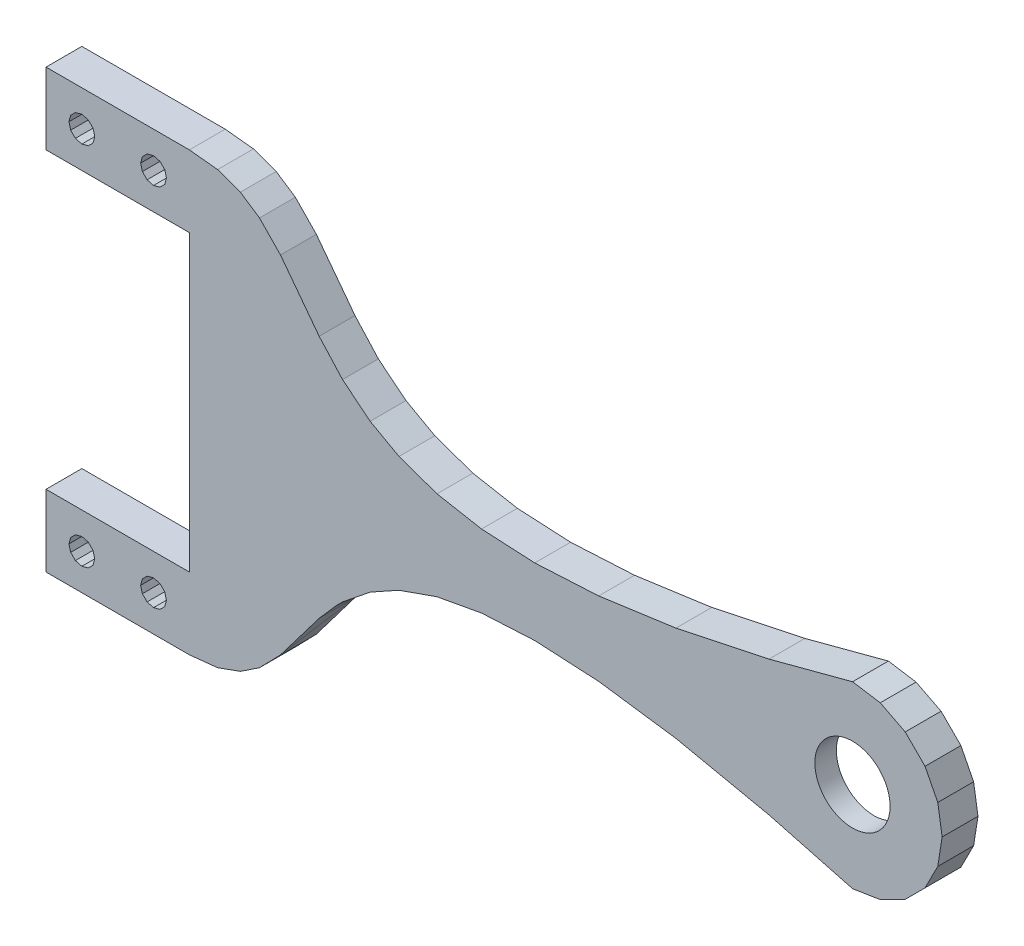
ISO-10303-21;
HEADER;
FILE_DESCRIPTION(('STEP AP214'),'2;1');
FILE_NAME('part.step','',(''),(''),'','','');
FILE_SCHEMA(('AUTOMOTIVE_DESIGN { 1 0 10303 214 1 1 1 1 }'));
ENDSEC;
DATA;
#1=APPLICATION_CONTEXT('core data for automotive mechanical design processes');
#2=APPLICATION_PROTOCOL_DEFINITION('international standard','automotive_design',2000,#1);
#3=PRODUCT_CONTEXT('',#1,'mechanical');
#4=PRODUCT('Part','Part','',(#3));
#5=PRODUCT_RELATED_PRODUCT_CATEGORY('part','',(#4));
#6=PRODUCT_DEFINITION_FORMATION('','',#4);
#7=PRODUCT_DEFINITION_CONTEXT('part definition',#1,'design');
#8=PRODUCT_DEFINITION('design','',#6,#7);
#9=PRODUCT_DEFINITION_SHAPE('','',#8);
#10=(LENGTH_UNIT() NAMED_UNIT(*) SI_UNIT(.MILLI.,.METRE.));
#11=(NAMED_UNIT(*) PLANE_ANGLE_UNIT() SI_UNIT($,.RADIAN.));
#12=(NAMED_UNIT(*) SI_UNIT($,.STERADIAN.) SOLID_ANGLE_UNIT());
#13=UNCERTAINTY_MEASURE_WITH_UNIT(LENGTH_MEASURE(1.E-05),#10,'distance_accuracy_value','');
#14=(GEOMETRIC_REPRESENTATION_CONTEXT(3) GLOBAL_UNCERTAINTY_ASSIGNED_CONTEXT((#13)) GLOBAL_UNIT_ASSIGNED_CONTEXT((#10,
#11,#12)) REPRESENTATION_CONTEXT('',''));
#15=CARTESIAN_POINT('',(0.,0.,0.));
#16=DIRECTION('',(0.,0.,1.));
#17=DIRECTION('',(1.,0.,0.));
#18=AXIS2_PLACEMENT_3D('',#15,#16,#17);
#19=CARTESIAN_POINT('',(0.,0.,0.));
#20=DIRECTION('',(1.,0.,0.));
#21=DIRECTION('',(0.,0.,-1.));
#22=AXIS2_PLACEMENT_3D('',#19,#20,#21);
#23=PLANE('',#22);
#24=DIRECTION('',(0.,-1.,0.));
#25=VECTOR('',#24,1.);
#26=CARTESIAN_POINT('',(0.,0.,0.));
#27=LINE('',#26,#25);
#28=CARTESIAN_POINT('',(0.,61.0000006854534,0.));
#29=VERTEX_POINT('',#28);
#30=CARTESIAN_POINT('',(0.,50.9999990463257,0.));
#31=VERTEX_POINT('',#30);
#32=EDGE_CURVE('E1337',#29,#31,#27,.T.);
#33=ORIENTED_EDGE('',*,*,#32,.T.);
#34=DIRECTION('',(0.,0.,1.));
#35=VECTOR('',#34,1.);
#36=CARTESIAN_POINT('',(0.,50.9999990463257,0.));
#37=LINE('',#36,#35);
#38=CARTESIAN_POINT('',(0.,50.9999990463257,4.99999988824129));
#39=VERTEX_POINT('',#38);
#40=EDGE_CURVE('E1316',#31,#39,#37,.T.);
#41=ORIENTED_EDGE('',*,*,#40,.T.);
#42=DIRECTION('',(0.,1.,0.));
#43=VECTOR('',#42,1.);
#44=CARTESIAN_POINT('',(0.,61.0000006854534,4.99999988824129));
#45=LINE('',#44,#43);
#46=CARTESIAN_POINT('',(0.,61.0000006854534,4.99999988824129));
#47=VERTEX_POINT('',#46);
#48=EDGE_CURVE('E1320',#39,#47,#45,.T.);
#49=ORIENTED_EDGE('',*,*,#48,.T.);
#50=DIRECTION('',(0.,0.,-1.));
#51=VECTOR('',#50,1.);
#52=CARTESIAN_POINT('',(0.,61.0000006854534,0.));
#53=LINE('',#52,#51);
#54=EDGE_CURVE('E1333',#47,#29,#53,.T.);
#55=ORIENTED_EDGE('',*,*,#54,.T.);
#56=EDGE_LOOP('',(#33,#41,#49,#55));
#57=FACE_BOUND('',#56,.T.);
#58=ADVANCED_FACE('F49',(#57),#23,.F.);
#59=CARTESIAN_POINT('',(0.,0.,0.));
#60=DIRECTION('',(0.,0.,-1.));
#61=DIRECTION('',(-1.,0.,0.));
#62=AXIS2_PLACEMENT_3D('',#59,#60,#61);
#63=PLANE('',#62);
#64=DIRECTION('',(-0.258817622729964,-0.965926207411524,0.));
#65=VECTOR('',#64,1.);
#66=CARTESIAN_POINT('',(3.44115495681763,5.89999929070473,0.));
#67=LINE('',#66,#65);
#68=CARTESIAN_POINT('',(3.44115495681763,5.89999929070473,0.));
#69=VERTEX_POINT('',#68);
#70=CARTESIAN_POINT('',(3.20000201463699,4.99999895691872,0.));
#71=VERTEX_POINT('',#70);
#72=EDGE_CURVE('E755',#69,#71,#67,.T.);
#73=ORIENTED_EDGE('',*,*,#72,.T.);
#74=DIRECTION('',(0.25881787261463,-0.965926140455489,0.));
#75=VECTOR('',#74,1.);
#76=CARTESIAN_POINT('',(3.20000201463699,4.99999895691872,0.));
#77=LINE('',#76,#75);
#78=CARTESIAN_POINT('',(3.44115495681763,4.09999955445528,0.));
#79=VERTEX_POINT('',#78);
#80=EDGE_CURVE('E768',#71,#79,#77,.T.);
#81=ORIENTED_EDGE('',*,*,#80,.T.);
#82=DIRECTION('',(0.707107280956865,-0.707106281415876,0.));
#83=VECTOR('',#82,1.);
#84=CARTESIAN_POINT('',(3.44115495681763,4.09999955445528,0.));
#85=LINE('',#84,#83);
#86=CARTESIAN_POINT('',(4.100002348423,3.44115309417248,0.));
#87=VERTEX_POINT('',#86);
#88=EDGE_CURVE('E773',#79,#87,#85,.T.);
#89=ORIENTED_EDGE('',*,*,#88,.T.);
#90=DIRECTION('',(0.965925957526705,-0.258818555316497,0.));
#91=VECTOR('',#90,1.);
#92=CARTESIAN_POINT('',(4.100002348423,3.44115309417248,0.));
#93=LINE('',#92,#91);
#94=CARTESIAN_POINT('',(5.00000268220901,3.19999922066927,0.));
#95=VERTEX_POINT('',#94);
#96=EDGE_CURVE('E791',#87,#95,#93,.T.);
#97=ORIENTED_EDGE('',*,*,#96,.T.);
#98=DIRECTION('',(0.965925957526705,0.258818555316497,0.));
#99=VECTOR('',#98,1.);
#100=CARTESIAN_POINT('',(5.00000268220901,3.19999922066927,0.));
#101=LINE('',#100,#99);
#102=CARTESIAN_POINT('',(5.90000301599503,3.44115309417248,0.));
#103=VERTEX_POINT('',#102);
#104=EDGE_CURVE('E795',#95,#103,#101,.T.);
#105=ORIENTED_EDGE('',*,*,#104,.T.);
#106=DIRECTION('',(0.707103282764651,0.707110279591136,0.));
#107=VECTOR('',#106,1.);
#108=CARTESIAN_POINT('',(5.90000301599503,3.44115309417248,0.));
#109=LINE('',#108,#107);
#110=CARTESIAN_POINT('',(6.55884295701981,4.09999955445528,0.));
#111=VERTEX_POINT('',#110);
#112=EDGE_CURVE('E799',#103,#111,#109,.T.);
#113=ORIENTED_EDGE('',*,*,#112,.T.);
#114=DIRECTION('',(0.258825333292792,0.965924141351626,0.));
#115=VECTOR('',#114,1.);
#116=CARTESIAN_POINT('',(6.55884295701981,4.09999955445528,0.));
#117=LINE('',#116,#115);
#118=CARTESIAN_POINT('',(6.80000334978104,4.99999895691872,0.));
#119=VERTEX_POINT('',#118);
#120=EDGE_CURVE('E803',#111,#119,#117,.T.);
#121=ORIENTED_EDGE('',*,*,#120,.T.);
#122=DIRECTION('',(-0.258825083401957,0.965924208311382,0.));
#123=VECTOR('',#122,1.);
#124=CARTESIAN_POINT('',(6.80000334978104,4.99999895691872,0.));
#125=LINE('',#124,#123);
#126=CARTESIAN_POINT('',(6.55884295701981,5.89999929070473,0.));
#127=VERTEX_POINT('',#126);
#128=EDGE_CURVE('E807',#119,#127,#125,.T.);
#129=ORIENTED_EDGE('',*,*,#128,.T.);
#130=DIRECTION('',(-0.707103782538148,0.707109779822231,0.));
#131=VECTOR('',#130,1.);
#132=CARTESIAN_POINT('',(6.55884295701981,5.89999929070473,0.));
#133=LINE('',#132,#131);
#134=CARTESIAN_POINT('',(5.90000301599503,6.55884481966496,0.));
#135=VERTEX_POINT('',#134);
#136=EDGE_CURVE('E811',#127,#135,#133,.T.);
#137=ORIENTED_EDGE('',*,*,#136,.T.);
#138=DIRECTION('',(-0.965925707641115,0.258819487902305,0.));
#139=VECTOR('',#138,1.);
#140=CARTESIAN_POINT('',(5.90000301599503,6.55884481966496,0.));
#141=LINE('',#140,#139);
#142=CARTESIAN_POINT('',(5.00000268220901,6.79999962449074,0.));
#143=VERTEX_POINT('',#142);
#144=EDGE_CURVE('E815',#135,#143,#141,.T.);
#145=ORIENTED_EDGE('',*,*,#144,.T.);
#146=DIRECTION('',(-0.965925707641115,-0.258819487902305,0.));
#147=VECTOR('',#146,1.);
#148=CARTESIAN_POINT('',(5.00000268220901,6.79999962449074,0.));
#149=LINE('',#148,#147);
#150=CARTESIAN_POINT('',(4.100002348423,6.55884481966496,0.));
#151=VERTEX_POINT('',#150);
#152=EDGE_CURVE('E819',#143,#151,#149,.T.);
#153=ORIENTED_EDGE('',*,*,#152,.T.);
#154=DIRECTION('',(-0.707107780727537,-0.707105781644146,0.));
#155=VECTOR('',#154,1.);
#156=CARTESIAN_POINT('',(4.100002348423,6.55884481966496,0.));
#157=LINE('',#156,#155);
#158=EDGE_CURVE('E764',#151,#69,#157,.T.);
#159=ORIENTED_EDGE('',*,*,#158,.T.);
#160=EDGE_LOOP('',(#73,#81,#89,#97,#105,#113,#121,#129,#137,#145,#153,#159));
#161=FACE_BOUND('',#160,.T.);
#162=DIRECTION('',(0.965925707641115,0.258819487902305,0.));
#163=VECTOR('',#162,1.);
#164=CARTESIAN_POINT('',(14.1000002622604,6.55884481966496,0.));
#165=LINE('',#164,#163);
#166=CARTESIAN_POINT('',(14.1000002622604,6.55884481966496,0.));
#167=VERTEX_POINT('',#166);
#168=CARTESIAN_POINT('',(15.0000005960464,6.79999962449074,0.));
#169=VERTEX_POINT('',#168);
#170=EDGE_CURVE('E867',#167,#169,#165,.T.);
#171=ORIENTED_EDGE('',*,*,#170,.F.);
#172=DIRECTION('',(0.707107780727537,0.707105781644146,0.));
#173=VECTOR('',#172,1.);
#174=CARTESIAN_POINT('',(13.4411528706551,5.89999929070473,0.));
#175=LINE('',#174,#173);
#176=CARTESIAN_POINT('',(13.4411528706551,5.89999929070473,0.));
#177=VERTEX_POINT('',#176);
#178=EDGE_CURVE('E902',#177,#167,#175,.T.);
#179=ORIENTED_EDGE('',*,*,#178,.F.);
#180=DIRECTION('',(0.258817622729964,0.965926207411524,0.));
#181=VECTOR('',#180,1.);
#182=CARTESIAN_POINT('',(13.1999999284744,4.99999895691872,0.));
#183=LINE('',#182,#181);
#184=CARTESIAN_POINT('',(13.1999999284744,4.99999895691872,0.));
#185=VERTEX_POINT('',#184);
#186=EDGE_CURVE('E985',#185,#177,#183,.T.);
#187=ORIENTED_EDGE('',*,*,#186,.F.);
#188=DIRECTION('',(-0.25881787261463,0.965926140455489,0.));
#189=VECTOR('',#188,1.);
#190=CARTESIAN_POINT('',(13.4411528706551,4.09999955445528,0.));
#191=LINE('',#190,#189);
#192=CARTESIAN_POINT('',(13.4411528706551,4.09999955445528,0.));
#193=VERTEX_POINT('',#192);
#194=EDGE_CURVE('E981',#193,#185,#191,.T.);
#195=ORIENTED_EDGE('',*,*,#194,.F.);
#196=DIRECTION('',(-0.707107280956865,0.707106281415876,0.));
#197=VECTOR('',#196,1.);
#198=CARTESIAN_POINT('',(14.1000002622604,3.44115309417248,0.));
#199=LINE('',#198,#197);
#200=CARTESIAN_POINT('',(14.1000002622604,3.44115309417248,0.));
#201=VERTEX_POINT('',#200);
#202=EDGE_CURVE('E977',#201,#193,#199,.T.);
#203=ORIENTED_EDGE('',*,*,#202,.F.);
#204=DIRECTION('',(-0.965925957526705,0.258818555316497,0.));
#205=VECTOR('',#204,1.);
#206=CARTESIAN_POINT('',(15.0000005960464,3.19999922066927,0.));
#207=LINE('',#206,#205);
#208=CARTESIAN_POINT('',(15.0000005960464,3.19999922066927,0.));
#209=VERTEX_POINT('',#208);
#210=EDGE_CURVE('E973',#209,#201,#207,.T.);
#211=ORIENTED_EDGE('',*,*,#210,.F.);
#212=DIRECTION('',(-0.965925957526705,-0.258818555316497,0.));
#213=VECTOR('',#212,1.);
#214=CARTESIAN_POINT('',(15.9000009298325,3.44115309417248,0.));
#215=LINE('',#214,#213);
#216=CARTESIAN_POINT('',(15.9000009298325,3.44115309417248,0.));
#217=VERTEX_POINT('',#216);
#218=EDGE_CURVE('E969',#217,#209,#215,.T.);
#219=ORIENTED_EDGE('',*,*,#218,.F.);
#220=DIRECTION('',(-0.707107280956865,-0.707106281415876,0.));
#221=VECTOR('',#220,1.);
#222=CARTESIAN_POINT('',(16.5588483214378,4.09999955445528,0.));
#223=LINE('',#222,#221);
#224=CARTESIAN_POINT('',(16.5588483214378,4.09999955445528,0.));
#225=VERTEX_POINT('',#224);
#226=EDGE_CURVE('E965',#225,#217,#223,.T.);
#227=ORIENTED_EDGE('',*,*,#226,.F.);
#228=DIRECTION('',(-0.25881787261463,-0.965926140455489,0.));
#229=VECTOR('',#228,1.);
#230=CARTESIAN_POINT('',(16.8000012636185,4.99999895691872,0.));
#231=LINE('',#230,#229);
#232=CARTESIAN_POINT('',(16.8000012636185,4.99999895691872,0.));
#233=VERTEX_POINT('',#232);
#234=EDGE_CURVE('E961',#233,#225,#231,.T.);
#235=ORIENTED_EDGE('',*,*,#234,.F.);
#236=DIRECTION('',(0.258817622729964,-0.965926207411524,0.));
#237=VECTOR('',#236,1.);
#238=CARTESIAN_POINT('',(16.5588483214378,5.89999929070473,0.));
#239=LINE('',#238,#237);
#240=CARTESIAN_POINT('',(16.5588483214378,5.89999929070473,0.));
#241=VERTEX_POINT('',#240);
#242=EDGE_CURVE('E957',#241,#233,#239,.T.);
#243=ORIENTED_EDGE('',*,*,#242,.F.);
#244=DIRECTION('',(0.707107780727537,-0.707105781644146,0.));
#245=VECTOR('',#244,1.);
#246=CARTESIAN_POINT('',(15.9000009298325,6.55884481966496,0.));
#247=LINE('',#246,#245);
#248=CARTESIAN_POINT('',(15.9000009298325,6.55884481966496,0.));
#249=VERTEX_POINT('',#248);
#250=EDGE_CURVE('E953',#249,#241,#247,.T.);
#251=ORIENTED_EDGE('',*,*,#250,.F.);
#252=DIRECTION('',(0.965925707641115,-0.258819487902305,0.));
#253=VECTOR('',#252,1.);
#254=CARTESIAN_POINT('',(15.0000005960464,6.79999962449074,0.));
#255=LINE('',#254,#253);
#256=EDGE_CURVE('E949',#169,#249,#255,.T.);
#257=ORIENTED_EDGE('',*,*,#256,.F.);
#258=EDGE_LOOP('',(#171,#179,#187,#195,#203,#211,#219,#227,#235,#243,#251,#257));
#259=FACE_BOUND('',#258,.T.);
#260=DIRECTION('',(-0.258817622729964,-0.965926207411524,0.));
#261=VECTOR('',#260,1.);
#262=CARTESIAN_POINT('',(16.8000012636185,55.9999980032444,0.));
#263=LINE('',#262,#261);
#264=CARTESIAN_POINT('',(16.8000012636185,55.9999980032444,0.));
#265=VERTEX_POINT('',#264);
#266=CARTESIAN_POINT('',(16.5588483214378,55.0999976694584,0.));
#267=VERTEX_POINT('',#266);
#268=EDGE_CURVE('E995',#265,#267,#263,.T.);
#269=ORIENTED_EDGE('',*,*,#268,.F.);
#270=DIRECTION('',(0.258817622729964,-0.965926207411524,0.));
#271=VECTOR('',#270,1.);
#272=CARTESIAN_POINT('',(16.5588483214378,56.8999983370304,0.));
#273=LINE('',#272,#271);
#274=CARTESIAN_POINT('',(16.5588483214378,56.8999983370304,0.));
#275=VERTEX_POINT('',#274);
#276=EDGE_CURVE('E1034',#275,#265,#273,.T.);
#277=ORIENTED_EDGE('',*,*,#276,.F.);
#278=DIRECTION('',(0.707106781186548,-0.707106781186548,0.));
#279=VECTOR('',#278,1.);
#280=CARTESIAN_POINT('',(15.9000009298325,57.5588457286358,0.));
#281=LINE('',#280,#279);
#282=CARTESIAN_POINT('',(15.9000009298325,57.5588457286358,0.));
#283=VERTEX_POINT('',#282);
#284=EDGE_CURVE('E1117',#283,#275,#281,.T.);
#285=ORIENTED_EDGE('',*,*,#284,.F.);
#286=DIRECTION('',(0.965926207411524,-0.258817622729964,0.));
#287=VECTOR('',#286,1.);
#288=CARTESIAN_POINT('',(15.0000005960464,57.7999986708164,0.));
#289=LINE('',#288,#287);
#290=CARTESIAN_POINT('',(15.0000005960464,57.7999986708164,0.));
#291=VERTEX_POINT('',#290);
#292=EDGE_CURVE('E1113',#291,#283,#289,.T.);
#293=ORIENTED_EDGE('',*,*,#292,.F.);
#294=DIRECTION('',(0.965926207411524,0.258817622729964,0.));
#295=VECTOR('',#294,1.);
#296=CARTESIAN_POINT('',(14.1000002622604,57.5588457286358,0.));
#297=LINE('',#296,#295);
#298=CARTESIAN_POINT('',(14.1000002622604,57.5588457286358,0.));
#299=VERTEX_POINT('',#298);
#300=EDGE_CURVE('E1109',#299,#291,#297,.T.);
#301=ORIENTED_EDGE('',*,*,#300,.F.);
#302=DIRECTION('',(0.707106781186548,0.707106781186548,0.));
#303=VECTOR('',#302,1.);
#304=CARTESIAN_POINT('',(13.4411528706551,56.8999983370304,0.));
#305=LINE('',#304,#303);
#306=CARTESIAN_POINT('',(13.4411528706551,56.8999983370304,0.));
#307=VERTEX_POINT('',#306);
#308=EDGE_CURVE('E1105',#307,#299,#305,.T.);
#309=ORIENTED_EDGE('',*,*,#308,.F.);
#310=DIRECTION('',(0.258817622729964,0.965926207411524,0.));
#311=VECTOR('',#310,1.);
#312=CARTESIAN_POINT('',(13.1999999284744,55.9999980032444,0.));
#313=LINE('',#312,#311);
#314=CARTESIAN_POINT('',(13.1999999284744,55.9999980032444,0.));
#315=VERTEX_POINT('',#314);
#316=EDGE_CURVE('E1101',#315,#307,#313,.T.);
#317=ORIENTED_EDGE('',*,*,#316,.F.);
#318=DIRECTION('',(-0.258817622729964,0.965926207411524,0.));
#319=VECTOR('',#318,1.);
#320=CARTESIAN_POINT('',(13.4411528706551,55.0999976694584,0.));
#321=LINE('',#320,#319);
#322=CARTESIAN_POINT('',(13.4411528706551,55.0999976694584,0.));
#323=VERTEX_POINT('',#322);
#324=EDGE_CURVE('E1097',#323,#315,#321,.T.);
#325=ORIENTED_EDGE('',*,*,#324,.F.);
#326=DIRECTION('',(-0.707108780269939,0.707104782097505,0.));
#327=VECTOR('',#326,1.);
#328=CARTESIAN_POINT('',(14.1000002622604,54.4411540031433,0.));
#329=LINE('',#328,#327);
#330=CARTESIAN_POINT('',(14.1000002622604,54.4411540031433,0.));
#331=VERTEX_POINT('',#330);
#332=EDGE_CURVE('E1093',#331,#323,#329,.T.);
#333=ORIENTED_EDGE('',*,*,#332,.F.);
#334=DIRECTION('',(-0.965926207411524,0.258817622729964,0.));
#335=VECTOR('',#334,1.);
#336=CARTESIAN_POINT('',(15.0000005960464,54.2000010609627,0.));
#337=LINE('',#336,#335);
#338=CARTESIAN_POINT('',(15.0000005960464,54.2000010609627,0.));
#339=VERTEX_POINT('',#338);
#340=EDGE_CURVE('E1089',#339,#331,#337,.T.);
#341=ORIENTED_EDGE('',*,*,#340,.F.);
#342=DIRECTION('',(-0.965926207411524,-0.258817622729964,0.));
#343=VECTOR('',#342,1.);
#344=CARTESIAN_POINT('',(15.9000009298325,54.4411540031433,0.));
#345=LINE('',#344,#343);
#346=CARTESIAN_POINT('',(15.9000009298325,54.4411540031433,0.));
#347=VERTEX_POINT('',#346);
#348=EDGE_CURVE('E1085',#347,#339,#345,.T.);
#349=ORIENTED_EDGE('',*,*,#348,.F.);
#350=DIRECTION('',(-0.707108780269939,-0.707104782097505,0.));
#351=VECTOR('',#350,1.);
#352=CARTESIAN_POINT('',(16.5588483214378,55.0999976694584,0.));
#353=LINE('',#352,#351);
#354=EDGE_CURVE('E1081',#267,#347,#353,.T.);
#355=ORIENTED_EDGE('',*,*,#354,.F.);
#356=EDGE_LOOP('',(#269,#277,#285,#293,#301,#309,#317,#325,#333,#341,#349,#355));
#357=FACE_BOUND('',#356,.T.);
#358=DIRECTION('',(0.965926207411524,0.258817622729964,0.));
#359=VECTOR('',#358,1.);
#360=CARTESIAN_POINT('',(4.100002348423,57.5588457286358,0.));
#361=LINE('',#360,#359);
#362=CARTESIAN_POINT('',(4.100002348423,57.5588457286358,0.));
#363=VERTEX_POINT('',#362);
#364=CARTESIAN_POINT('',(5.00000268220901,57.7999986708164,0.));
#365=VERTEX_POINT('',#364);
#366=EDGE_CURVE('E1127',#363,#365,#361,.T.);
#367=ORIENTED_EDGE('',*,*,#366,.F.);
#368=DIRECTION('',(0.707106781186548,0.707106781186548,0.));
#369=VECTOR('',#368,1.);
#370=CARTESIAN_POINT('',(3.44115495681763,56.8999983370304,0.));
#371=LINE('',#370,#369);
#372=CARTESIAN_POINT('',(3.44115495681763,56.8999983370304,0.));
#373=VERTEX_POINT('',#372);
#374=EDGE_CURVE('E1166',#373,#363,#371,.T.);
#375=ORIENTED_EDGE('',*,*,#374,.F.);
#376=DIRECTION('',(0.258817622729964,0.965926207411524,0.));
#377=VECTOR('',#376,1.);
#378=CARTESIAN_POINT('',(3.20000201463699,55.9999980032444,0.));
#379=LINE('',#378,#377);
#380=CARTESIAN_POINT('',(3.20000201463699,55.9999980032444,0.));
#381=VERTEX_POINT('',#380);
#382=EDGE_CURVE('E1249',#381,#373,#379,.T.);
#383=ORIENTED_EDGE('',*,*,#382,.F.);
#384=DIRECTION('',(-0.258817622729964,0.965926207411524,0.));
#385=VECTOR('',#384,1.);
#386=CARTESIAN_POINT('',(3.44115495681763,55.0999976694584,0.));
#387=LINE('',#386,#385);
#388=CARTESIAN_POINT('',(3.44115495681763,55.0999976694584,0.));
#389=VERTEX_POINT('',#388);
#390=EDGE_CURVE('E1245',#389,#381,#387,.T.);
#391=ORIENTED_EDGE('',*,*,#390,.F.);
#392=DIRECTION('',(-0.707108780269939,0.707104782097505,0.));
#393=VECTOR('',#392,1.);
#394=CARTESIAN_POINT('',(4.100002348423,54.4411540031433,0.));
#395=LINE('',#394,#393);
#396=CARTESIAN_POINT('',(4.100002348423,54.4411540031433,0.));
#397=VERTEX_POINT('',#396);
#398=EDGE_CURVE('E1241',#397,#389,#395,.T.);
#399=ORIENTED_EDGE('',*,*,#398,.F.);
#400=DIRECTION('',(-0.965926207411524,0.258817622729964,0.));
#401=VECTOR('',#400,1.);
#402=CARTESIAN_POINT('',(5.00000268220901,54.2000010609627,0.));
#403=LINE('',#402,#401);
#404=CARTESIAN_POINT('',(5.00000268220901,54.2000010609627,0.));
#405=VERTEX_POINT('',#404);
#406=EDGE_CURVE('E1237',#405,#397,#403,.T.);
#407=ORIENTED_EDGE('',*,*,#406,.F.);
#408=DIRECTION('',(-0.965926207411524,-0.258817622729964,0.));
#409=VECTOR('',#408,1.);
#410=CARTESIAN_POINT('',(5.90000301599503,54.4411540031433,0.));
#411=LINE('',#410,#409);
#412=CARTESIAN_POINT('',(5.90000301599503,54.4411540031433,0.));
#413=VERTEX_POINT('',#412);
#414=EDGE_CURVE('E1233',#413,#405,#411,.T.);
#415=ORIENTED_EDGE('',*,*,#414,.F.);
#416=DIRECTION('',(-0.707104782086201,-0.707108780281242,0.));
#417=VECTOR('',#416,1.);
#418=CARTESIAN_POINT('',(6.55884295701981,55.0999976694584,0.));
#419=LINE('',#418,#417);
#420=CARTESIAN_POINT('',(6.55884295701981,55.0999976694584,0.));
#421=VERTEX_POINT('',#420);
#422=EDGE_CURVE('E1229',#421,#413,#419,.T.);
#423=ORIENTED_EDGE('',*,*,#422,.F.);
#424=DIRECTION('',(-0.258825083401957,-0.965924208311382,0.));
#425=VECTOR('',#424,1.);
#426=CARTESIAN_POINT('',(6.80000334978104,55.9999980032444,0.));
#427=LINE('',#426,#425);
#428=CARTESIAN_POINT('',(6.80000334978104,55.9999980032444,0.));
#429=VERTEX_POINT('',#428);
#430=EDGE_CURVE('E1225',#429,#421,#427,.T.);
#431=ORIENTED_EDGE('',*,*,#430,.F.);
#432=DIRECTION('',(0.258825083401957,-0.965924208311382,0.));
#433=VECTOR('',#432,1.);
#434=CARTESIAN_POINT('',(6.55884295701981,56.8999983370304,0.));
#435=LINE('',#434,#433);
#436=CARTESIAN_POINT('',(6.55884295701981,56.8999983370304,0.));
#437=VERTEX_POINT('',#436);
#438=EDGE_CURVE('E1221',#437,#429,#435,.T.);
#439=ORIENTED_EDGE('',*,*,#438,.F.);
#440=DIRECTION('',(0.707102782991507,-0.707110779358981,0.));
#441=VECTOR('',#440,1.);
#442=CARTESIAN_POINT('',(5.90000301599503,57.5588457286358,0.));
#443=LINE('',#442,#441);
#444=CARTESIAN_POINT('',(5.90000301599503,57.5588457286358,0.));
#445=VERTEX_POINT('',#444);
#446=EDGE_CURVE('E1217',#445,#437,#443,.T.);
#447=ORIENTED_EDGE('',*,*,#446,.F.);
#448=DIRECTION('',(0.965926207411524,-0.258817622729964,0.));
#449=VECTOR('',#448,1.);
#450=CARTESIAN_POINT('',(5.00000268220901,57.7999986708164,0.));
#451=LINE('',#450,#449);
#452=EDGE_CURVE('E1213',#365,#445,#451,.T.);
#453=ORIENTED_EDGE('',*,*,#452,.F.);
#454=EDGE_LOOP('',(#367,#375,#383,#391,#399,#407,#415,#423,#431,#439,#447,#453));
#455=FACE_BOUND('',#454,.T.);
#456=DIRECTION('',(0.697197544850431,0.716879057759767,0.));
#457=VECTOR('',#456,1.);
#458=CARTESIAN_POINT('',(29.7767370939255,3.3296924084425,0.));
#459=LINE('',#458,#457);
#460=CARTESIAN_POINT('',(29.7767370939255,3.32969240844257,0.));
#461=VERTEX_POINT('',#460);
#462=CARTESIAN_POINT('',(32.7091887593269,6.34492561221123,0.));
#463=VERTEX_POINT('',#462);
#464=EDGE_CURVE('E1893',#461,#463,#459,.T.);
#465=ORIENTED_EDGE('',*,*,#464,.F.);
#466=DIRECTION('',(0.832816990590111,0.553548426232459,0.));
#467=VECTOR('',#466,1.);
#468=CARTESIAN_POINT('',(7.58906121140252,-11.4177889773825,0.));
#469=LINE('',#468,#467);
#470=CARTESIAN_POINT('',(27.1069109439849,1.55513919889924,0.));
#471=VERTEX_POINT('',#470);
#472=EDGE_CURVE('E74',#461,#471,#469,.F.);
#473=ORIENTED_EDGE('',*,*,#472,.T.);
#474=DIRECTION('',(0.941056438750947,0.33824958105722,0.));
#475=VECTOR('',#474,1.);
#476=CARTESIAN_POINT('',(23.9303931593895,0.413384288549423,0.));
#477=LINE('',#476,#475);
#478=CARTESIAN_POINT('',(23.9303931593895,0.413384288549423,0.));
#479=VERTEX_POINT('',#478);
#480=EDGE_CURVE('E1907',#479,#471,#477,.T.);
#481=ORIENTED_EDGE('',*,*,#480,.F.);
#482=DIRECTION('',(0.994514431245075,0.104599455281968,0.));
#483=VECTOR('',#482,1.);
#484=CARTESIAN_POINT('',(20.0000032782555,0.,0.));
#485=LINE('',#484,#483);
#486=CARTESIAN_POINT('',(20.0000032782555,0.,0.));
#487=VERTEX_POINT('',#486);
#488=EDGE_CURVE('E4201',#487,#479,#485,.T.);
#489=ORIENTED_EDGE('',*,*,#488,.F.);
#490=DIRECTION('',(1.,0.,0.));
#491=VECTOR('',#490,1.);
#492=CARTESIAN_POINT('',(0.,0.,0.));
#493=LINE('',#492,#491);
#494=CARTESIAN_POINT('',(0.,0.,0.));
#495=VERTEX_POINT('',#494);
#496=EDGE_CURVE('E1348',#495,#487,#493,.T.);
#497=ORIENTED_EDGE('',*,*,#496,.F.);
#498=CARTESIAN_POINT('',(0.,9.99999884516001,0.));
#499=VERTEX_POINT('',#498);
#500=EDGE_CURVE('E1336',#499,#495,#27,.T.);
#501=ORIENTED_EDGE('',*,*,#500,.F.);
#502=DIRECTION('',(1.,0.,0.));
#503=VECTOR('',#502,1.);
#504=CARTESIAN_POINT('',(0.,9.99999884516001,0.));
#505=LINE('',#504,#503);
#506=CARTESIAN_POINT('',(20.0000032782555,9.99999884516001,0.));
#507=VERTEX_POINT('',#506);
#508=EDGE_CURVE('E1293',#499,#507,#505,.T.);
#509=ORIENTED_EDGE('',*,*,#508,.T.);
#510=DIRECTION('',(0.,1.,0.));
#511=VECTOR('',#510,1.);
#512=CARTESIAN_POINT('',(20.0000032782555,9.99999884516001,0.));
#513=LINE('',#512,#511);
#514=CARTESIAN_POINT('',(20.0000032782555,50.9999990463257,0.));
#515=VERTEX_POINT('',#514);
#516=EDGE_CURVE('E1297',#507,#515,#513,.T.);
#517=ORIENTED_EDGE('',*,*,#516,.T.);
#518=DIRECTION('',(-1.,0.,0.));
#519=VECTOR('',#518,1.);
#520=CARTESIAN_POINT('',(20.0000032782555,50.9999990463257,0.));
#521=LINE('',#520,#519);
#522=EDGE_CURVE('E1302',#515,#31,#521,.T.);
#523=ORIENTED_EDGE('',*,*,#522,.T.);
#524=ORIENTED_EDGE('',*,*,#32,.F.);
#525=DIRECTION('',(1.,0.,0.));
#526=VECTOR('',#525,1.);
#527=CARTESIAN_POINT('',(0.,61.0000006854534,0.));
#528=LINE('',#527,#526);
#529=CARTESIAN_POINT('',(20.0000032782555,61.0000006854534,0.));
#530=VERTEX_POINT('',#529);
#531=EDGE_CURVE('E1352',#29,#530,#528,.T.);
#532=ORIENTED_EDGE('',*,*,#531,.T.);
#533=DIRECTION('',(-0.994514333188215,0.10460038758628,0.));
#534=VECTOR('',#533,1.);
#535=CARTESIAN_POINT('',(23.9303931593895,60.5866126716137,0.));
#536=LINE('',#535,#534);
#537=CARTESIAN_POINT('',(23.9303931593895,60.5866126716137,0.));
#538=VERTEX_POINT('',#537);
#539=EDGE_CURVE('E2082',#538,#530,#536,.T.);
#540=ORIENTED_EDGE('',*,*,#539,.F.);
#541=DIRECTION('',(-0.941056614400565,0.338249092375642,0.));
#542=VECTOR('',#541,1.);
#543=CARTESIAN_POINT('',(27.106910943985,59.444859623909,0.));
#544=LINE('',#543,#542);
#545=CARTESIAN_POINT('',(27.106910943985,59.444859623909,0.));
#546=VERTEX_POINT('',#545);
#547=EDGE_CURVE('E1734',#546,#538,#544,.T.);
#548=ORIENTED_EDGE('',*,*,#547,.F.);
#549=DIRECTION('',(-0.832816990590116,0.553548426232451,0.));
#550=VECTOR('',#549,1.);
#551=CARTESIAN_POINT('',(35.7103372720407,53.7264206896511,0.));
#552=LINE('',#551,#550);
#553=CARTESIAN_POINT('',(29.7767370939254,57.6703064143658,0.));
#554=VERTEX_POINT('',#553);
#555=EDGE_CURVE('E1854',#546,#554,#552,.F.);
#556=ORIENTED_EDGE('',*,*,#555,.T.);
#557=DIRECTION('',(-0.697197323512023,0.716879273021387,0.));
#558=VECTOR('',#557,1.);
#559=CARTESIAN_POINT('',(32.7091887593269,54.6550713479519,0.));
#560=LINE('',#559,#558);
#561=CARTESIAN_POINT('',(32.7091887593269,54.6550713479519,0.));
#562=VERTEX_POINT('',#561);
#563=EDGE_CURVE('E1672',#562,#554,#560,.T.);
#564=ORIENTED_EDGE('',*,*,#563,.F.);
#565=DIRECTION('',(0.603834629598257,-0.797109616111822,0.));
#566=VECTOR('',#565,1.);
#567=CARTESIAN_POINT('',(32.7091887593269,54.6550713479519,0.));
#568=LINE('',#567,#566);
#569=CARTESIAN_POINT('',(38.1016880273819,47.5365445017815,0.));
#570=VERTEX_POINT('',#569);
#571=EDGE_CURVE('E2002',#562,#570,#568,.T.);
#572=ORIENTED_EDGE('',*,*,#571,.T.);
#573=DIRECTION('',(0.670684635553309,-0.741742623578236,0.));
#574=VECTOR('',#573,1.);
#575=CARTESIAN_POINT('',(38.1016880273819,47.5365445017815,0.));
#576=LINE('',#575,#574);
#577=CARTESIAN_POINT('',(41.3593873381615,43.9336970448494,0.));
#578=VERTEX_POINT('',#577);
#579=EDGE_CURVE('E1644',#570,#578,#576,.T.);
#580=ORIENTED_EDGE('',*,*,#579,.T.);
#581=DIRECTION('',(0.777610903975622,-0.628745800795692,0.));
#582=VECTOR('',#581,1.);
#583=CARTESIAN_POINT('',(41.3593873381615,43.9336970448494,0.));
#584=LINE('',#583,#582);
#585=CARTESIAN_POINT('',(45.2122911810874,40.818389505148,0.));
#586=VERTEX_POINT('',#585);
#587=EDGE_CURVE('E1645',#578,#586,#584,.T.);
#588=ORIENTED_EDGE('',*,*,#587,.T.);
#589=DIRECTION('',(-0.874158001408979,0.485641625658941,0.));
#590=VECTOR('',#589,1.);
#591=CARTESIAN_POINT('',(49.2362827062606,38.5828465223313,0.));
#592=LINE('',#591,#590);
#593=CARTESIAN_POINT('',(49.2362827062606,38.5828465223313,0.));
#594=VERTEX_POINT('',#593);
#595=EDGE_CURVE('E1843',#586,#594,#592,.F.);
#596=ORIENTED_EDGE('',*,*,#595,.T.);
#597=DIRECTION('',(0.943437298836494,-0.331550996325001,0.));
#598=VECTOR('',#597,1.);
#599=CARTESIAN_POINT('',(49.2362827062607,38.5828465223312,0.));
#600=LINE('',#599,#598);
#601=CARTESIAN_POINT('',(54.5407086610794,36.7187187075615,0.));
#602=VERTEX_POINT('',#601);
#603=EDGE_CURVE('E1662',#594,#602,#600,.T.);
#604=ORIENTED_EDGE('',*,*,#603,.T.);
#605=DIRECTION('',(0.983549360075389,-0.180639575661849,0.));
#606=VECTOR('',#605,1.);
#607=CARTESIAN_POINT('',(54.5407086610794,36.7187187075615,0.));
#608=LINE('',#607,#606);
#609=CARTESIAN_POINT('',(60.7540383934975,35.5775728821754,0.));
#610=VERTEX_POINT('',#609);
#611=EDGE_CURVE('E1702',#602,#610,#608,.T.);
#612=ORIENTED_EDGE('',*,*,#611,.T.);
#613=DIRECTION('',(0.998624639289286,-0.0524292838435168,0.));
#614=VECTOR('',#613,1.);
#615=CARTESIAN_POINT('',(60.7540383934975,35.5775728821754,0.));
#616=LINE('',#615,#614);
#617=CARTESIAN_POINT('',(68.168006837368,35.1883284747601,0.));
#618=VERTEX_POINT('',#617);
#619=EDGE_CURVE('E1714',#610,#618,#616,.T.);
#620=ORIENTED_EDGE('',*,*,#619,.T.);
#621=DIRECTION('',(-0.998596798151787,-0.0529569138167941,0.));
#622=VECTOR('',#621,1.);
#623=CARTESIAN_POINT('',(77.0937278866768,35.6616713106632,0.));
#624=LINE('',#623,#622);
#625=CARTESIAN_POINT('',(77.0937278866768,35.6616713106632,0.));
#626=VERTEX_POINT('',#625);
#627=EDGE_CURVE('E2077',#626,#618,#624,.T.);
#628=ORIENTED_EDGE('',*,*,#627,.F.);
#629=DIRECTION('',(-0.99039643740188,-0.138256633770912,0.));
#630=VECTOR('',#629,1.);
#631=CARTESIAN_POINT('',(87.8666192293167,37.1655374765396,0.));
#632=LINE('',#631,#630);
#633=CARTESIAN_POINT('',(87.8666192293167,37.1655374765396,0.));
#634=VERTEX_POINT('',#633);
#635=EDGE_CURVE('E2121',#634,#626,#632,.T.);
#636=ORIENTED_EDGE('',*,*,#635,.F.);
#637=DIRECTION('',(-0.978349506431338,-0.206959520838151,0.));
#638=VECTOR('',#637,1.);
#639=CARTESIAN_POINT('',(100.854098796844,39.9129018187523,0.));
#640=LINE('',#639,#638);
#641=CARTESIAN_POINT('',(100.854098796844,39.9129018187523,0.));
#642=VERTEX_POINT('',#641);
#643=EDGE_CURVE('E2132',#642,#634,#640,.T.);
#644=ORIENTED_EDGE('',*,*,#643,.F.);
#645=DIRECTION('',(-0.966615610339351,-0.256230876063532,0.));
#646=VECTOR('',#645,1.);
#647=CARTESIAN_POINT('',(112.499997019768,43.0000014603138,0.));
#648=LINE('',#647,#646);
#649=CARTESIAN_POINT('',(112.499997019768,43.0000014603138,0.));
#650=VERTEX_POINT('',#649);
#651=EDGE_CURVE('E2156',#650,#642,#648,.T.);
#652=ORIENTED_EDGE('',*,*,#651,.F.);
#653=DIRECTION('',(-0.987688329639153,0.156434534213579,0.));
#654=VECTOR('',#653,1.);
#655=CARTESIAN_POINT('',(116.362705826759,42.3882082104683,0.));
#656=LINE('',#655,#654);
#657=CARTESIAN_POINT('',(116.362705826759,42.3882082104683,0.));
#658=VERTEX_POINT('',#657);
#659=EDGE_CURVE('E2179',#658,#650,#656,.T.);
#660=ORIENTED_EDGE('',*,*,#659,.F.);
#661=DIRECTION('',(-0.891006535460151,0.453990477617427,0.));
#662=VECTOR('',#661,1.);
#663=CARTESIAN_POINT('',(119.847312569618,40.6127125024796,0.));
#664=LINE('',#663,#662);
#665=CARTESIAN_POINT('',(119.847312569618,40.6127125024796,0.));
#666=VERTEX_POINT('',#665);
#667=EDGE_CURVE('E2202',#666,#658,#664,.T.);
#668=ORIENTED_EDGE('',*,*,#667,.F.);
#669=DIRECTION('',(-0.707106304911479,0.707107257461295,0.));
#670=VECTOR('',#669,1.);
#671=CARTESIAN_POINT('',(122.612707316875,37.847314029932,0.));
#672=LINE('',#671,#670);
#673=CARTESIAN_POINT('',(122.612707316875,37.847314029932,0.));
#674=VERTEX_POINT('',#673);
#675=EDGE_CURVE('E2225',#674,#666,#672,.T.);
#676=ORIENTED_EDGE('',*,*,#675,.F.);
#677=DIRECTION('',(-0.453990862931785,0.891006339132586,0.));
#678=VECTOR('',#677,1.);
#679=CARTESIAN_POINT('',(124.388203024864,34.3627110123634,0.));
#680=LINE('',#679,#678);
#681=CARTESIAN_POINT('',(124.388203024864,34.3627110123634,0.));
#682=VERTEX_POINT('',#681);
#683=EDGE_CURVE('E2248',#682,#674,#680,.T.);
#684=ORIENTED_EDGE('',*,*,#683,.F.);
#685=DIRECTION('',(-0.156435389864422,0.987688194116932,0.));
#686=VECTOR('',#685,1.);
#687=CARTESIAN_POINT('',(125.,30.5000003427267,0.));
#688=LINE('',#687,#686);
#689=CARTESIAN_POINT('',(125.,30.5000003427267,0.));
#690=VERTEX_POINT('',#689);
#691=EDGE_CURVE('E1360',#690,#682,#688,.T.);
#692=ORIENTED_EDGE('',*,*,#691,.F.);
#693=DIRECTION('',(0.156435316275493,0.987688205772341,0.));
#694=VECTOR('',#693,1.);
#695=CARTESIAN_POINT('',(124.388203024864,26.6372878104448,0.));
#696=LINE('',#695,#694);
#697=CARTESIAN_POINT('',(124.388203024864,26.6372878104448,0.));
#698=VERTEX_POINT('',#697);
#699=EDGE_CURVE('E2259',#698,#690,#696,.T.);
#700=ORIENTED_EDGE('',*,*,#699,.F.);
#701=DIRECTION('',(0.453990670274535,0.891006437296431,0.));
#702=VECTOR('',#701,1.);
#703=CARTESIAN_POINT('',(122.612707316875,23.1526829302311,0.));
#704=LINE('',#703,#702);
#705=CARTESIAN_POINT('',(122.612707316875,23.1526829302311,0.));
#706=VERTEX_POINT('',#705);
#707=EDGE_CURVE('E2236',#706,#698,#704,.T.);
#708=ORIENTED_EDGE('',*,*,#707,.F.);
#709=DIRECTION('',(0.707106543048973,0.707107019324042,0.));
#710=VECTOR('',#709,1.);
#711=CARTESIAN_POINT('',(119.847312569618,20.3872863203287,0.));
#712=LINE('',#711,#710);
#713=CARTESIAN_POINT('',(119.847312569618,20.3872863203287,0.));
#714=VERTEX_POINT('',#713);
#715=EDGE_CURVE('E2213',#714,#706,#712,.T.);
#716=ORIENTED_EDGE('',*,*,#715,.F.);
#717=DIRECTION('',(0.89100692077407,0.453989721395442,0.));
#718=VECTOR('',#717,1.);
#719=CARTESIAN_POINT('',(116.362705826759,18.6117943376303,0.));
#720=LINE('',#719,#718);
#721=CARTESIAN_POINT('',(116.362705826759,18.6117943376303,0.));
#722=VERTEX_POINT('',#721);
#723=EDGE_CURVE('E2190',#722,#714,#720,.T.);
#724=ORIENTED_EDGE('',*,*,#723,.F.);
#725=DIRECTION('',(0.987688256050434,0.156434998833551,0.));
#726=VECTOR('',#725,1.);
#727=CARTESIAN_POINT('',(112.499997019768,17.9999992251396,0.));
#728=LINE('',#727,#726);
#729=CARTESIAN_POINT('',(112.499997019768,17.9999992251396,0.));
#730=VERTEX_POINT('',#729);
#731=EDGE_CURVE('E2167',#730,#722,#728,.T.);
#732=ORIENTED_EDGE('',*,*,#731,.F.);
#733=DIRECTION('',(0.966615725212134,-0.256230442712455,0.));
#734=VECTOR('',#733,1.);
#735=CARTESIAN_POINT('',(100.854098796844,21.0870932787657,0.));
#736=LINE('',#735,#734);
#737=CARTESIAN_POINT('',(100.854098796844,21.0870932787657,0.));
#738=VERTEX_POINT('',#737);
#739=EDGE_CURVE('E2144',#738,#730,#736,.T.);
#740=ORIENTED_EDGE('',*,*,#739,.F.);
#741=DIRECTION('',(-0.978349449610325,0.206959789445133,0.));
#742=VECTOR('',#741,1.);
#743=CARTESIAN_POINT('',(100.854098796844,21.0870932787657,0.));
#744=LINE('',#743,#742);
#745=CARTESIAN_POINT('',(87.8666192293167,23.8344613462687,0.));
#746=VERTEX_POINT('',#745);
#747=EDGE_CURVE('E2098',#738,#746,#744,.T.);
#748=ORIENTED_EDGE('',*,*,#747,.T.);
#749=DIRECTION('',(-0.99039643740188,0.138256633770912,0.));
#750=VECTOR('',#749,1.);
#751=CARTESIAN_POINT('',(87.8666192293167,23.8344613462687,0.));
#752=LINE('',#751,#750);
#753=CARTESIAN_POINT('',(77.0937278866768,25.338327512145,0.));
#754=VERTEX_POINT('',#753);
#755=EDGE_CURVE('E1773',#746,#754,#752,.T.);
#756=ORIENTED_EDGE('',*,*,#755,.T.);
#757=DIRECTION('',(0.998596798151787,-0.0529569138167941,0.));
#758=VECTOR('',#757,1.);
#759=CARTESIAN_POINT('',(68.168006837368,25.8116703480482,0.));
#760=LINE('',#759,#758);
#761=CARTESIAN_POINT('',(68.168006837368,25.8116703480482,0.));
#762=VERTEX_POINT('',#761);
#763=EDGE_CURVE('E1726',#762,#754,#760,.T.);
#764=ORIENTED_EDGE('',*,*,#763,.F.);
#765=DIRECTION('',(0.998624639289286,0.0524292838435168,0.));
#766=VECTOR('',#765,1.);
#767=CARTESIAN_POINT('',(60.7540383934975,25.4224259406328,0.));
#768=LINE('',#767,#766);
#769=CARTESIAN_POINT('',(60.7540383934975,25.4224259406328,0.));
#770=VERTEX_POINT('',#769);
#771=EDGE_CURVE('E1698',#770,#762,#768,.T.);
#772=ORIENTED_EDGE('',*,*,#771,.F.);
#773=DIRECTION('',(0.983549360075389,0.180639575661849,0.));
#774=VECTOR('',#773,1.);
#775=CARTESIAN_POINT('',(54.5407086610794,24.2812801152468,0.));
#776=LINE('',#775,#774);
#777=CARTESIAN_POINT('',(54.5407086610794,24.2812801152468,0.));
#778=VERTEX_POINT('',#777);
#779=EDGE_CURVE('E1666',#778,#770,#776,.T.);
#780=ORIENTED_EDGE('',*,*,#779,.F.);
#781=DIRECTION('',(0.943437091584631,0.331551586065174,0.));
#782=VECTOR('',#781,1.);
#783=CARTESIAN_POINT('',(49.2362827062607,22.4171485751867,0.));
#784=LINE('',#783,#782);
#785=CARTESIAN_POINT('',(49.2362827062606,22.4171485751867,0.));
#786=VERTEX_POINT('',#785);
#787=EDGE_CURVE('E1639',#786,#778,#784,.T.);
#788=ORIENTED_EDGE('',*,*,#787,.F.);
#789=DIRECTION('',(-0.874158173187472,-0.485641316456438,0.));
#790=VECTOR('',#789,1.);
#791=CARTESIAN_POINT('',(45.2122911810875,20.1816074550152,0.));
#792=LINE('',#791,#790);
#793=CARTESIAN_POINT('',(45.2122911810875,20.1816074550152,0.));
#794=VERTEX_POINT('',#793);
#795=EDGE_CURVE('E1878',#786,#794,#792,.T.);
#796=ORIENTED_EDGE('',*,*,#795,.T.);
#797=DIRECTION('',(0.777611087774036,0.628745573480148,0.));
#798=VECTOR('',#797,1.);
#799=CARTESIAN_POINT('',(41.3593873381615,17.0663017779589,0.));
#800=LINE('',#799,#798);
#801=CARTESIAN_POINT('',(41.3593873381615,17.0663017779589,0.));
#802=VERTEX_POINT('',#801);
#803=EDGE_CURVE('E1974',#802,#794,#800,.T.);
#804=ORIENTED_EDGE('',*,*,#803,.F.);
#805=DIRECTION('',(0.670684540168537,0.741742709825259,0.));
#806=VECTOR('',#805,1.);
#807=CARTESIAN_POINT('',(38.1016880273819,13.4634533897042,0.));
#808=LINE('',#807,#806);
#809=CARTESIAN_POINT('',(38.1016880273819,13.4634533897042,0.));
#810=VERTEX_POINT('',#809);
#811=EDGE_CURVE('E1962',#810,#802,#808,.T.);
#812=ORIENTED_EDGE('',*,*,#811,.F.);
#813=DIRECTION('',(0.62524254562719,0.780430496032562,0.));
#814=VECTOR('',#813,1.);
#815=CARTESIAN_POINT('',(38.0518957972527,13.4013025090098,0.));
#816=LINE('',#815,#814);
#817=CARTESIAN_POINT('',(38.0518957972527,13.4013025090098,0.));
#818=VERTEX_POINT('',#817);
#819=EDGE_CURVE('E1946',#818,#810,#816,.T.);
#820=ORIENTED_EDGE('',*,*,#819,.F.);
#821=DIRECTION('',(0.603639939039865,0.79725706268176,0.));
#822=VECTOR('',#821,1.);
#823=CARTESIAN_POINT('',(32.7091887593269,6.34492561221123,0.));
#824=LINE('',#823,#822);
#825=EDGE_CURVE('E1899',#463,#818,#824,.T.);
#826=ORIENTED_EDGE('',*,*,#825,.F.);
#827=EDGE_LOOP('',(#465,#473,#481,#489,#497,#501,#509,#517,#523,#524,#532,#540,#548,#556,#564,
#572,#580,#588,#596,#604,#612,#620,#628,#636,#644,#652,#660,#668,#676,#684,#692,#700,#708,#716,
#724,#732,#740,#748,#756,#764,#772,#780,#788,#796,#804,#812,#820,#826));
#828=FACE_BOUND('',#827,.T.);
#829=DIRECTION('',(-0.173647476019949,-0.984807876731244,0.));
#830=VECTOR('',#829,1.);
#831=CARTESIAN_POINT('',(123.000003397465,30.5000003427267,0.));
#832=LINE('',#831,#830);
#833=CARTESIAN_POINT('',(123.000003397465,30.5000003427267,0.));
#834=VERTEX_POINT('',#833);
#835=CARTESIAN_POINT('',(122.366778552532,26.9087888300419,0.));
#836=VERTEX_POINT('',#835);
#837=EDGE_CURVE('E1623',#834,#836,#832,.T.);
#838=ORIENTED_EDGE('',*,*,#837,.F.);
#839=DIRECTION('',(0.17364765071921,-0.984807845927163,0.));
#840=VECTOR('',#839,1.);
#841=CARTESIAN_POINT('',(122.366778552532,34.0912081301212,0.));
#842=LINE('',#841,#840);
#843=CARTESIAN_POINT('',(122.366778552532,34.0912081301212,0.));
#844=VERTEX_POINT('',#843);
#845=EDGE_CURVE('E1619',#844,#834,#842,.T.);
#846=ORIENTED_EDGE('',*,*,#845,.F.);
#847=DIRECTION('',(0.500001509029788,-0.866024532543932,0.));
#848=VECTOR('',#847,1.);
#849=CARTESIAN_POINT('',(120.543465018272,37.2492671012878,0.));
#850=LINE('',#849,#848);
#851=CARTESIAN_POINT('',(120.543465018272,37.2492671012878,0.));
#852=VERTEX_POINT('',#851);
#853=EDGE_CURVE('E1596',#852,#844,#850,.T.);
#854=ORIENTED_EDGE('',*,*,#853,.F.);
#855=DIRECTION('',(0.766044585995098,-0.642787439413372,0.));
#856=VECTOR('',#855,1.);
#857=CARTESIAN_POINT('',(117.749996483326,39.5932644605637,0.));
#858=LINE('',#857,#856);
#859=CARTESIAN_POINT('',(117.749996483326,39.5932644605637,0.));
#860=VERTEX_POINT('',#859);
#861=EDGE_CURVE('E1574',#860,#852,#858,.T.);
#862=ORIENTED_EDGE('',*,*,#861,.F.);
#863=DIRECTION('',(0.939692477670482,-0.342020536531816,0.));
#864=VECTOR('',#863,1.);
#865=CARTESIAN_POINT('',(114.323303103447,40.8404804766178,0.));
#866=LINE('',#865,#864);
#867=CARTESIAN_POINT('',(114.323303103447,40.8404804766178,0.));
#868=VERTEX_POINT('',#867);
#869=EDGE_CURVE('E1555',#868,#860,#866,.T.);
#870=ORIENTED_EDGE('',*,*,#869,.F.);
#871=DIRECTION('',(1.,0.,0.));
#872=VECTOR('',#871,1.);
#873=CARTESIAN_POINT('',(110.676698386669,40.8404804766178,0.));
#874=LINE('',#873,#872);
#875=CARTESIAN_POINT('',(110.676698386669,40.8404804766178,0.));
#876=VERTEX_POINT('',#875);
#877=EDGE_CURVE('E1532',#876,#868,#874,.T.);
#878=ORIENTED_EDGE('',*,*,#877,.F.);
#879=DIRECTION('',(0.939692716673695,0.342019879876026,0.));
#880=VECTOR('',#879,1.);
#881=CARTESIAN_POINT('',(107.24999755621,39.5932644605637,0.));
#882=LINE('',#881,#880);
#883=CARTESIAN_POINT('',(107.24999755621,39.5932644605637,0.));
#884=VERTEX_POINT('',#883);
#885=EDGE_CURVE('E1510',#884,#876,#882,.T.);
#886=ORIENTED_EDGE('',*,*,#885,.F.);
#887=DIRECTION('',(0.76604374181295,0.642788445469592,0.));
#888=VECTOR('',#887,1.);
#889=CARTESIAN_POINT('',(104.456536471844,37.2492671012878,0.));
#890=LINE('',#889,#888);
#891=CARTESIAN_POINT('',(104.456536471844,37.2492671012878,0.));
#892=VERTEX_POINT('',#891);
#893=EDGE_CURVE('E1487',#892,#884,#890,.T.);
#894=ORIENTED_EDGE('',*,*,#893,.F.);
#895=DIRECTION('',(0.500001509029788,0.866024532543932,0.));
#896=VECTOR('',#895,1.);
#897=CARTESIAN_POINT('',(102.633222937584,34.0912081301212,0.));
#898=LINE('',#897,#896);
#899=CARTESIAN_POINT('',(102.633222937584,34.0912081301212,0.));
#900=VERTEX_POINT('',#899);
#901=EDGE_CURVE('E1465',#900,#892,#898,.T.);
#902=ORIENTED_EDGE('',*,*,#901,.F.);
#903=DIRECTION('',(0.17364765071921,0.984807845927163,0.));
#904=VECTOR('',#903,1.);
#905=CARTESIAN_POINT('',(101.999998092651,30.5000003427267,0.));
#906=LINE('',#905,#904);
#907=CARTESIAN_POINT('',(101.999998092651,30.5000003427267,0.));
#908=VERTEX_POINT('',#907);
#909=EDGE_CURVE('E1442',#908,#900,#906,.T.);
#910=ORIENTED_EDGE('',*,*,#909,.F.);
#911=DIRECTION('',(-0.173647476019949,0.984807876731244,0.));
#912=VECTOR('',#911,1.);
#913=CARTESIAN_POINT('',(102.633222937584,26.9087888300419,0.));
#914=LINE('',#913,#912);
#915=CARTESIAN_POINT('',(102.633222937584,26.9087888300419,0.));
#916=VERTEX_POINT('',#915);
#917=EDGE_CURVE('E1446',#916,#908,#914,.T.);
#918=ORIENTED_EDGE('',*,*,#917,.F.);
#919=DIRECTION('',(-0.500001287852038,0.866024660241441,0.));
#920=VECTOR('',#919,1.);
#921=CARTESIAN_POINT('',(104.456536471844,23.7507279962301,0.));
#922=LINE('',#921,#920);
#923=CARTESIAN_POINT('',(104.456536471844,23.7507279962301,0.));
#924=VERTEX_POINT('',#923);
#925=EDGE_CURVE('E1469',#924,#916,#922,.T.);
#926=ORIENTED_EDGE('',*,*,#925,.F.);
#927=DIRECTION('',(-0.766043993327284,0.642788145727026,0.));
#928=VECTOR('',#927,1.);
#929=CARTESIAN_POINT('',(107.24999755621,21.4067324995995,0.));
#930=LINE('',#929,#928);
#931=CARTESIAN_POINT('',(107.24999755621,21.4067324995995,0.));
#932=VERTEX_POINT('',#931);
#933=EDGE_CURVE('E1491',#932,#924,#930,.T.);
#934=ORIENTED_EDGE('',*,*,#933,.F.);
#935=DIRECTION('',(-0.939692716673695,0.342019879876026,0.));
#936=VECTOR('',#935,1.);
#937=CARTESIAN_POINT('',(110.676698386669,20.1595164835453,0.));
#938=LINE('',#937,#936);
#939=CARTESIAN_POINT('',(110.676698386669,20.1595164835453,0.));
#940=VERTEX_POINT('',#939);
#941=EDGE_CURVE('E1514',#940,#932,#938,.T.);
#942=ORIENTED_EDGE('',*,*,#941,.F.);
#943=DIRECTION('',(-1.,0.,0.));
#944=VECTOR('',#943,1.);
#945=CARTESIAN_POINT('',(114.323303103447,20.1595164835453,0.));
#946=LINE('',#945,#944);
#947=CARTESIAN_POINT('',(114.323303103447,20.1595164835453,0.));
#948=VERTEX_POINT('',#947);
#949=EDGE_CURVE('E1536',#948,#940,#946,.T.);
#950=ORIENTED_EDGE('',*,*,#949,.F.);
#951=DIRECTION('',(-0.939692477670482,-0.342020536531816,0.));
#952=VECTOR('',#951,1.);
#953=CARTESIAN_POINT('',(117.749996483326,21.4067324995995,0.));
#954=LINE('',#953,#952);
#955=CARTESIAN_POINT('',(117.749996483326,21.4067324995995,0.));
#956=VERTEX_POINT('',#955);
#957=EDGE_CURVE('E1559',#956,#948,#954,.T.);
#958=ORIENTED_EDGE('',*,*,#957,.F.);
#959=DIRECTION('',(-0.766044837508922,-0.642787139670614,0.));
#960=VECTOR('',#959,1.);
#961=CARTESIAN_POINT('',(120.543465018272,23.7507279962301,0.));
#962=LINE('',#961,#960);
#963=CARTESIAN_POINT('',(120.543465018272,23.7507279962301,0.));
#964=VERTEX_POINT('',#963);
#965=EDGE_CURVE('E1578',#964,#956,#962,.T.);
#966=ORIENTED_EDGE('',*,*,#965,.F.);
#967=DIRECTION('',(-0.500001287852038,-0.866024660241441,0.));
#968=VECTOR('',#967,1.);
#969=CARTESIAN_POINT('',(122.366778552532,26.9087888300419,0.));
#970=LINE('',#969,#968);
#971=EDGE_CURVE('E1600',#836,#964,#970,.T.);
#972=ORIENTED_EDGE('',*,*,#971,.F.);
#973=EDGE_LOOP('',(#838,#846,#854,#862,#870,#878,#886,#894,#902,#910,#918,#926,#934,#942,#950,
#958,#966,#972));
#974=FACE_BOUND('',#973,.T.);
#975=ADVANCED_FACE('F775',(#161,#259,#357,#455,#828,#974),#63,.T.);
#976=CARTESIAN_POINT('',(0.,0.,4.99999988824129));
#977=DIRECTION('',(0.,0.,1.));
#978=DIRECTION('',(1.,0.,0.));
#979=AXIS2_PLACEMENT_3D('',#976,#977,#978);
#980=PLANE('',#979);
#981=CARTESIAN_POINT('',(112.491246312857,30.5721145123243,4.99999988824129));
#982=DIRECTION('',(0.,0.,1.));
#983=DIRECTION('',(1.,0.,0.));
#984=AXIS2_PLACEMENT_3D('',#981,#982,#983);
#985=CIRCLE('',#984,5.25);
#986=CARTESIAN_POINT('',(117.741246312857,30.5721145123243,4.99999988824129));
#987=VERTEX_POINT('',#986);
#988=EDGE_CURVE('E787',#987,#987,#985,.T.);
#989=ORIENTED_EDGE('',*,*,#988,.F.);
#990=EDGE_LOOP('',(#989));
#991=FACE_BOUND('',#990,.T.);
#992=DIRECTION('',(-0.258817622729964,-0.965926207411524,0.));
#993=VECTOR('',#992,1.);
#994=CARTESIAN_POINT('',(3.44115495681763,5.89999929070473,4.99999988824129));
#995=LINE('',#994,#993);
#996=CARTESIAN_POINT('',(3.44115495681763,5.89999929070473,4.99999988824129));
#997=VERTEX_POINT('',#996);
#998=CARTESIAN_POINT('',(3.20000201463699,4.99999895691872,4.99999988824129));
#999=VERTEX_POINT('',#998);
#1000=EDGE_CURVE('E758',#997,#999,#995,.T.);
#1001=ORIENTED_EDGE('',*,*,#1000,.F.);
#1002=DIRECTION('',(-0.707107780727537,-0.707105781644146,0.));
#1003=VECTOR('',#1002,1.);
#1004=CARTESIAN_POINT('',(4.100002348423,6.55884481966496,4.99999988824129));
#1005=LINE('',#1004,#1003);
#1006=CARTESIAN_POINT('',(4.100002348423,6.55884481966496,4.99999988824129));
#1007=VERTEX_POINT('',#1006);
#1008=EDGE_CURVE('E780',#1007,#997,#1005,.T.);
#1009=ORIENTED_EDGE('',*,*,#1008,.F.);
#1010=DIRECTION('',(-0.965925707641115,-0.258819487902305,0.));
#1011=VECTOR('',#1010,1.);
#1012=CARTESIAN_POINT('',(5.00000268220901,6.79999962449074,4.99999988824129));
#1013=LINE('',#1012,#1011);
#1014=CARTESIAN_POINT('',(5.00000268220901,6.79999962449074,4.99999988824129));
#1015=VERTEX_POINT('',#1014);
#1016=EDGE_CURVE('E784',#1015,#1007,#1013,.T.);
#1017=ORIENTED_EDGE('',*,*,#1016,.F.);
#1018=DIRECTION('',(-0.965925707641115,0.258819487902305,0.));
#1019=VECTOR('',#1018,1.);
#1020=CARTESIAN_POINT('',(5.90000301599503,6.55884481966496,4.99999988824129));
#1021=LINE('',#1020,#1019);
#1022=CARTESIAN_POINT('',(5.90000301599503,6.55884481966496,4.99999988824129));
#1023=VERTEX_POINT('',#1022);
#1024=EDGE_CURVE('E857',#1023,#1015,#1021,.T.);
#1025=ORIENTED_EDGE('',*,*,#1024,.F.);
#1026=DIRECTION('',(-0.707103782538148,0.707109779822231,0.));
#1027=VECTOR('',#1026,1.);
#1028=CARTESIAN_POINT('',(6.55884295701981,5.89999929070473,4.99999988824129));
#1029=LINE('',#1028,#1027);
#1030=CARTESIAN_POINT('',(6.55884295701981,5.89999929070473,4.99999988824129));
#1031=VERTEX_POINT('',#1030);
#1032=EDGE_CURVE('E853',#1031,#1023,#1029,.T.);
#1033=ORIENTED_EDGE('',*,*,#1032,.F.);
#1034=DIRECTION('',(-0.258825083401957,0.965924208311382,0.));
#1035=VECTOR('',#1034,1.);
#1036=CARTESIAN_POINT('',(6.80000334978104,4.99999895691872,4.99999988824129));
#1037=LINE('',#1036,#1035);
#1038=CARTESIAN_POINT('',(6.80000334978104,4.99999895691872,4.99999988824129));
#1039=VERTEX_POINT('',#1038);
#1040=EDGE_CURVE('E849',#1039,#1031,#1037,.T.);
#1041=ORIENTED_EDGE('',*,*,#1040,.F.);
#1042=DIRECTION('',(0.258825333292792,0.965924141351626,0.));
#1043=VECTOR('',#1042,1.);
#1044=CARTESIAN_POINT('',(6.55884295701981,4.09999955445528,4.99999988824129));
#1045=LINE('',#1044,#1043);
#1046=CARTESIAN_POINT('',(6.55884295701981,4.09999955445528,4.99999988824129));
#1047=VERTEX_POINT('',#1046);
#1048=EDGE_CURVE('E845',#1047,#1039,#1045,.T.);
#1049=ORIENTED_EDGE('',*,*,#1048,.F.);
#1050=DIRECTION('',(0.707103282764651,0.707110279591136,0.));
#1051=VECTOR('',#1050,1.);
#1052=CARTESIAN_POINT('',(5.90000301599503,3.44115309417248,4.99999988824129));
#1053=LINE('',#1052,#1051);
#1054=CARTESIAN_POINT('',(5.90000301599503,3.44115309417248,4.99999988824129));
#1055=VERTEX_POINT('',#1054);
#1056=EDGE_CURVE('E841',#1055,#1047,#1053,.T.);
#1057=ORIENTED_EDGE('',*,*,#1056,.F.);
#1058=DIRECTION('',(0.965925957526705,0.258818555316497,0.));
#1059=VECTOR('',#1058,1.);
#1060=CARTESIAN_POINT('',(5.00000268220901,3.19999922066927,4.99999988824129));
#1061=LINE('',#1060,#1059);
#1062=CARTESIAN_POINT('',(5.00000268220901,3.19999922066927,4.99999988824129));
#1063=VERTEX_POINT('',#1062);
#1064=EDGE_CURVE('E837',#1063,#1055,#1061,.T.);
#1065=ORIENTED_EDGE('',*,*,#1064,.F.);
#1066=DIRECTION('',(0.965925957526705,-0.258818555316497,0.));
#1067=VECTOR('',#1066,1.);
#1068=CARTESIAN_POINT('',(4.100002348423,3.44115309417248,4.99999988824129));
#1069=LINE('',#1068,#1067);
#1070=CARTESIAN_POINT('',(4.100002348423,3.44115309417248,4.99999988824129));
#1071=VERTEX_POINT('',#1070);
#1072=EDGE_CURVE('E833',#1071,#1063,#1069,.T.);
#1073=ORIENTED_EDGE('',*,*,#1072,.F.);
#1074=DIRECTION('',(0.707107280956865,-0.707106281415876,0.));
#1075=VECTOR('',#1074,1.);
#1076=CARTESIAN_POINT('',(3.44115495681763,4.09999955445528,4.99999988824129));
#1077=LINE('',#1076,#1075);
#1078=CARTESIAN_POINT('',(3.44115495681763,4.09999955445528,4.99999988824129));
#1079=VERTEX_POINT('',#1078);
#1080=EDGE_CURVE('E829',#1079,#1071,#1077,.T.);
#1081=ORIENTED_EDGE('',*,*,#1080,.F.);
#1082=DIRECTION('',(0.25881787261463,-0.965926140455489,0.));
#1083=VECTOR('',#1082,1.);
#1084=CARTESIAN_POINT('',(3.20000201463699,4.99999895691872,4.99999988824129));
#1085=LINE('',#1084,#1083);
#1086=EDGE_CURVE('E826',#999,#1079,#1085,.T.);
#1087=ORIENTED_EDGE('',*,*,#1086,.F.);
#1088=EDGE_LOOP('',(#1001,#1009,#1017,#1025,#1033,#1041,#1049,#1057,#1065,#1073,#1081,#1087));
#1089=FACE_BOUND('',#1088,.T.);
#1090=DIRECTION('',(0.965925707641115,0.258819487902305,0.));
#1091=VECTOR('',#1090,1.);
#1092=CARTESIAN_POINT('',(14.1000002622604,6.55884481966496,4.99999988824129));
#1093=LINE('',#1092,#1091);
#1094=CARTESIAN_POINT('',(14.1000002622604,6.55884481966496,4.99999988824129));
#1095=VERTEX_POINT('',#1094);
#1096=CARTESIAN_POINT('',(15.0000005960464,6.79999962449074,4.99999988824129));
#1097=VERTEX_POINT('',#1096);
#1098=EDGE_CURVE('E897',#1095,#1097,#1093,.T.);
#1099=ORIENTED_EDGE('',*,*,#1098,.T.);
#1100=DIRECTION('',(0.965925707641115,-0.258819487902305,0.));
#1101=VECTOR('',#1100,1.);
#1102=CARTESIAN_POINT('',(15.0000005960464,6.79999962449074,4.99999988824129));
#1103=LINE('',#1102,#1101);
#1104=CARTESIAN_POINT('',(15.9000009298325,6.55884481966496,4.99999988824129));
#1105=VERTEX_POINT('',#1104);
#1106=EDGE_CURVE('E901',#1097,#1105,#1103,.T.);
#1107=ORIENTED_EDGE('',*,*,#1106,.T.);
#1108=DIRECTION('',(0.707107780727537,-0.707105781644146,0.));
#1109=VECTOR('',#1108,1.);
#1110=CARTESIAN_POINT('',(15.9000009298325,6.55884481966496,4.99999988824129));
#1111=LINE('',#1110,#1109);
#1112=CARTESIAN_POINT('',(16.5588483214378,5.89999929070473,4.99999988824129));
#1113=VERTEX_POINT('',#1112);
#1114=EDGE_CURVE('E906',#1105,#1113,#1111,.T.);
#1115=ORIENTED_EDGE('',*,*,#1114,.T.);
#1116=DIRECTION('',(0.258817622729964,-0.965926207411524,0.));
#1117=VECTOR('',#1116,1.);
#1118=CARTESIAN_POINT('',(16.5588483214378,5.89999929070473,4.99999988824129));
#1119=LINE('',#1118,#1117);
#1120=CARTESIAN_POINT('',(16.8000012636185,4.99999895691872,4.99999988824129));
#1121=VERTEX_POINT('',#1120);
#1122=EDGE_CURVE('E910',#1113,#1121,#1119,.T.);
#1123=ORIENTED_EDGE('',*,*,#1122,.T.);
#1124=DIRECTION('',(-0.25881787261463,-0.965926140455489,0.));
#1125=VECTOR('',#1124,1.);
#1126=CARTESIAN_POINT('',(16.8000012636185,4.99999895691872,4.99999988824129));
#1127=LINE('',#1126,#1125);
#1128=CARTESIAN_POINT('',(16.5588483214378,4.09999955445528,4.99999988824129));
#1129=VERTEX_POINT('',#1128);
#1130=EDGE_CURVE('E914',#1121,#1129,#1127,.T.);
#1131=ORIENTED_EDGE('',*,*,#1130,.T.);
#1132=DIRECTION('',(-0.707107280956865,-0.707106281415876,0.));
#1133=VECTOR('',#1132,1.);
#1134=CARTESIAN_POINT('',(16.5588483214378,4.09999955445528,4.99999988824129));
#1135=LINE('',#1134,#1133);
#1136=CARTESIAN_POINT('',(15.9000009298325,3.44115309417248,4.99999988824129));
#1137=VERTEX_POINT('',#1136);
#1138=EDGE_CURVE('E918',#1129,#1137,#1135,.T.);
#1139=ORIENTED_EDGE('',*,*,#1138,.T.);
#1140=DIRECTION('',(-0.965925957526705,-0.258818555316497,0.));
#1141=VECTOR('',#1140,1.);
#1142=CARTESIAN_POINT('',(15.9000009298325,3.44115309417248,4.99999988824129));
#1143=LINE('',#1142,#1141);
#1144=CARTESIAN_POINT('',(15.0000005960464,3.19999922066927,4.99999988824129));
#1145=VERTEX_POINT('',#1144);
#1146=EDGE_CURVE('E922',#1137,#1145,#1143,.T.);
#1147=ORIENTED_EDGE('',*,*,#1146,.T.);
#1148=DIRECTION('',(-0.965925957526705,0.258818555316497,0.));
#1149=VECTOR('',#1148,1.);
#1150=CARTESIAN_POINT('',(15.0000005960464,3.19999922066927,4.99999988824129));
#1151=LINE('',#1150,#1149);
#1152=CARTESIAN_POINT('',(14.1000002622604,3.44115309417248,4.99999988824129));
#1153=VERTEX_POINT('',#1152);
#1154=EDGE_CURVE('E926',#1145,#1153,#1151,.T.);
#1155=ORIENTED_EDGE('',*,*,#1154,.T.);
#1156=DIRECTION('',(-0.707107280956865,0.707106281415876,0.));
#1157=VECTOR('',#1156,1.);
#1158=CARTESIAN_POINT('',(14.1000002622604,3.44115309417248,4.99999988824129));
#1159=LINE('',#1158,#1157);
#1160=CARTESIAN_POINT('',(13.4411528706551,4.09999955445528,4.99999988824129));
#1161=VERTEX_POINT('',#1160);
#1162=EDGE_CURVE('E930',#1153,#1161,#1159,.T.);
#1163=ORIENTED_EDGE('',*,*,#1162,.T.);
#1164=DIRECTION('',(-0.25881787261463,0.965926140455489,0.));
#1165=VECTOR('',#1164,1.);
#1166=CARTESIAN_POINT('',(13.4411528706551,4.09999955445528,4.99999988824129));
#1167=LINE('',#1166,#1165);
#1168=CARTESIAN_POINT('',(13.1999999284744,4.99999895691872,4.99999988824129));
#1169=VERTEX_POINT('',#1168);
#1170=EDGE_CURVE('E934',#1161,#1169,#1167,.T.);
#1171=ORIENTED_EDGE('',*,*,#1170,.T.);
#1172=DIRECTION('',(0.258817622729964,0.965926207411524,0.));
#1173=VECTOR('',#1172,1.);
#1174=CARTESIAN_POINT('',(13.1999999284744,4.99999895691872,4.99999988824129));
#1175=LINE('',#1174,#1173);
#1176=CARTESIAN_POINT('',(13.4411528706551,5.89999929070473,4.99999988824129));
#1177=VERTEX_POINT('',#1176);
#1178=EDGE_CURVE('E938',#1169,#1177,#1175,.T.);
#1179=ORIENTED_EDGE('',*,*,#1178,.T.);
#1180=DIRECTION('',(0.707107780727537,0.707105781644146,0.));
#1181=VECTOR('',#1180,1.);
#1182=CARTESIAN_POINT('',(13.4411528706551,5.89999929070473,4.99999988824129));
#1183=LINE('',#1182,#1181);
#1184=EDGE_CURVE('E942',#1177,#1095,#1183,.T.);
#1185=ORIENTED_EDGE('',*,*,#1184,.T.);
#1186=EDGE_LOOP('',(#1099,#1107,#1115,#1123,#1131,#1139,#1147,#1155,#1163,#1171,#1179,#1185));
#1187=FACE_BOUND('',#1186,.T.);
#1188=DIRECTION('',(-0.258817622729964,-0.965926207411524,0.));
#1189=VECTOR('',#1188,1.);
#1190=CARTESIAN_POINT('',(16.8000012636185,55.9999980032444,4.99999988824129));
#1191=LINE('',#1190,#1189);
#1192=CARTESIAN_POINT('',(16.8000012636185,55.9999980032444,4.99999988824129));
#1193=VERTEX_POINT('',#1192);
#1194=CARTESIAN_POINT('',(16.5588483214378,55.0999976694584,4.99999988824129));
#1195=VERTEX_POINT('',#1194);
#1196=EDGE_CURVE('E1029',#1193,#1195,#1191,.T.);
#1197=ORIENTED_EDGE('',*,*,#1196,.T.);
#1198=DIRECTION('',(-0.707108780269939,-0.707104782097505,0.));
#1199=VECTOR('',#1198,1.);
#1200=CARTESIAN_POINT('',(16.5588483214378,55.0999976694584,4.99999988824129));
#1201=LINE('',#1200,#1199);
#1202=CARTESIAN_POINT('',(15.9000009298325,54.4411540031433,4.99999988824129));
#1203=VERTEX_POINT('',#1202);
#1204=EDGE_CURVE('E1033',#1195,#1203,#1201,.T.);
#1205=ORIENTED_EDGE('',*,*,#1204,.T.);
#1206=DIRECTION('',(-0.965926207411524,-0.258817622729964,0.));
#1207=VECTOR('',#1206,1.);
#1208=CARTESIAN_POINT('',(15.9000009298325,54.4411540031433,4.99999988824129));
#1209=LINE('',#1208,#1207);
#1210=CARTESIAN_POINT('',(15.0000005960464,54.2000010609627,4.99999988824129));
#1211=VERTEX_POINT('',#1210);
#1212=EDGE_CURVE('E1038',#1203,#1211,#1209,.T.);
#1213=ORIENTED_EDGE('',*,*,#1212,.T.);
#1214=DIRECTION('',(-0.965926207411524,0.258817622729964,0.));
#1215=VECTOR('',#1214,1.);
#1216=CARTESIAN_POINT('',(15.0000005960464,54.2000010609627,4.99999988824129));
#1217=LINE('',#1216,#1215);
#1218=CARTESIAN_POINT('',(14.1000002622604,54.4411540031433,4.99999988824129));
#1219=VERTEX_POINT('',#1218);
#1220=EDGE_CURVE('E1042',#1211,#1219,#1217,.T.);
#1221=ORIENTED_EDGE('',*,*,#1220,.T.);
#1222=DIRECTION('',(-0.707108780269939,0.707104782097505,0.));
#1223=VECTOR('',#1222,1.);
#1224=CARTESIAN_POINT('',(14.1000002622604,54.4411540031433,4.99999988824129));
#1225=LINE('',#1224,#1223);
#1226=CARTESIAN_POINT('',(13.4411528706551,55.0999976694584,4.99999988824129));
#1227=VERTEX_POINT('',#1226);
#1228=EDGE_CURVE('E1046',#1219,#1227,#1225,.T.);
#1229=ORIENTED_EDGE('',*,*,#1228,.T.);
#1230=DIRECTION('',(-0.258817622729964,0.965926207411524,0.));
#1231=VECTOR('',#1230,1.);
#1232=CARTESIAN_POINT('',(13.4411528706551,55.0999976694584,4.99999988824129));
#1233=LINE('',#1232,#1231);
#1234=CARTESIAN_POINT('',(13.1999999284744,55.9999980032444,4.99999988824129));
#1235=VERTEX_POINT('',#1234);
#1236=EDGE_CURVE('E1050',#1227,#1235,#1233,.T.);
#1237=ORIENTED_EDGE('',*,*,#1236,.T.);
#1238=DIRECTION('',(0.258817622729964,0.965926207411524,0.));
#1239=VECTOR('',#1238,1.);
#1240=CARTESIAN_POINT('',(13.1999999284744,55.9999980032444,4.99999988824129));
#1241=LINE('',#1240,#1239);
#1242=CARTESIAN_POINT('',(13.4411528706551,56.8999983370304,4.99999988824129));
#1243=VERTEX_POINT('',#1242);
#1244=EDGE_CURVE('E1054',#1235,#1243,#1241,.T.);
#1245=ORIENTED_EDGE('',*,*,#1244,.T.);
#1246=DIRECTION('',(0.707106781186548,0.707106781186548,0.));
#1247=VECTOR('',#1246,1.);
#1248=CARTESIAN_POINT('',(13.4411528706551,56.8999983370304,4.99999988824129));
#1249=LINE('',#1248,#1247);
#1250=CARTESIAN_POINT('',(14.1000002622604,57.5588457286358,4.99999988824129));
#1251=VERTEX_POINT('',#1250);
#1252=EDGE_CURVE('E1058',#1243,#1251,#1249,.T.);
#1253=ORIENTED_EDGE('',*,*,#1252,.T.);
#1254=DIRECTION('',(0.965926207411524,0.258817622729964,0.));
#1255=VECTOR('',#1254,1.);
#1256=CARTESIAN_POINT('',(14.1000002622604,57.5588457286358,4.99999988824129));
#1257=LINE('',#1256,#1255);
#1258=CARTESIAN_POINT('',(15.0000005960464,57.7999986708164,4.99999988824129));
#1259=VERTEX_POINT('',#1258);
#1260=EDGE_CURVE('E1062',#1251,#1259,#1257,.T.);
#1261=ORIENTED_EDGE('',*,*,#1260,.T.);
#1262=DIRECTION('',(0.965926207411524,-0.258817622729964,0.));
#1263=VECTOR('',#1262,1.);
#1264=CARTESIAN_POINT('',(15.0000005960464,57.7999986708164,4.99999988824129));
#1265=LINE('',#1264,#1263);
#1266=CARTESIAN_POINT('',(15.9000009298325,57.5588457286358,4.99999988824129));
#1267=VERTEX_POINT('',#1266);
#1268=EDGE_CURVE('E1066',#1259,#1267,#1265,.T.);
#1269=ORIENTED_EDGE('',*,*,#1268,.T.);
#1270=DIRECTION('',(0.707106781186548,-0.707106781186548,0.));
#1271=VECTOR('',#1270,1.);
#1272=CARTESIAN_POINT('',(15.9000009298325,57.5588457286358,4.99999988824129));
#1273=LINE('',#1272,#1271);
#1274=CARTESIAN_POINT('',(16.5588483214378,56.8999983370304,4.99999988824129));
#1275=VERTEX_POINT('',#1274);
#1276=EDGE_CURVE('E1070',#1267,#1275,#1273,.T.);
#1277=ORIENTED_EDGE('',*,*,#1276,.T.);
#1278=DIRECTION('',(0.258817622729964,-0.965926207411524,0.));
#1279=VECTOR('',#1278,1.);
#1280=CARTESIAN_POINT('',(16.5588483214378,56.8999983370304,4.99999988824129));
#1281=LINE('',#1280,#1279);
#1282=EDGE_CURVE('E1074',#1275,#1193,#1281,.T.);
#1283=ORIENTED_EDGE('',*,*,#1282,.T.);
#1284=EDGE_LOOP('',(#1197,#1205,#1213,#1221,#1229,#1237,#1245,#1253,#1261,#1269,#1277,#1283));
#1285=FACE_BOUND('',#1284,.T.);
#1286=DIRECTION('',(0.965926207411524,0.258817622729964,0.));
#1287=VECTOR('',#1286,1.);
#1288=CARTESIAN_POINT('',(4.100002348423,57.5588457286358,4.99999988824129));
#1289=LINE('',#1288,#1287);
#1290=CARTESIAN_POINT('',(4.100002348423,57.5588457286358,4.99999988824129));
#1291=VERTEX_POINT('',#1290);
#1292=CARTESIAN_POINT('',(5.00000268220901,57.7999986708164,4.99999988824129));
#1293=VERTEX_POINT('',#1292);
#1294=EDGE_CURVE('E1161',#1291,#1293,#1289,.T.);
#1295=ORIENTED_EDGE('',*,*,#1294,.T.);
#1296=DIRECTION('',(0.965926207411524,-0.258817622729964,0.));
#1297=VECTOR('',#1296,1.);
#1298=CARTESIAN_POINT('',(5.00000268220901,57.7999986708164,4.99999988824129));
#1299=LINE('',#1298,#1297);
#1300=CARTESIAN_POINT('',(5.90000301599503,57.5588457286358,4.99999988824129));
#1301=VERTEX_POINT('',#1300);
#1302=EDGE_CURVE('E1165',#1293,#1301,#1299,.T.);
#1303=ORIENTED_EDGE('',*,*,#1302,.T.);
#1304=DIRECTION('',(0.707102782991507,-0.707110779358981,0.));
#1305=VECTOR('',#1304,1.);
#1306=CARTESIAN_POINT('',(5.90000301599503,57.5588457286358,4.99999988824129));
#1307=LINE('',#1306,#1305);
#1308=CARTESIAN_POINT('',(6.55884295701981,56.8999983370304,4.99999988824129));
#1309=VERTEX_POINT('',#1308);
#1310=EDGE_CURVE('E1170',#1301,#1309,#1307,.T.);
#1311=ORIENTED_EDGE('',*,*,#1310,.T.);
#1312=DIRECTION('',(0.258825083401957,-0.965924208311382,0.));
#1313=VECTOR('',#1312,1.);
#1314=CARTESIAN_POINT('',(6.55884295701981,56.8999983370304,4.99999988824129));
#1315=LINE('',#1314,#1313);
#1316=CARTESIAN_POINT('',(6.80000334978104,55.9999980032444,4.99999988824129));
#1317=VERTEX_POINT('',#1316);
#1318=EDGE_CURVE('E1174',#1309,#1317,#1315,.T.);
#1319=ORIENTED_EDGE('',*,*,#1318,.T.);
#1320=DIRECTION('',(-0.258825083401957,-0.965924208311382,0.));
#1321=VECTOR('',#1320,1.);
#1322=CARTESIAN_POINT('',(6.80000334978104,55.9999980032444,4.99999988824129));
#1323=LINE('',#1322,#1321);
#1324=CARTESIAN_POINT('',(6.55884295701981,55.0999976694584,4.99999988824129));
#1325=VERTEX_POINT('',#1324);
#1326=EDGE_CURVE('E1178',#1317,#1325,#1323,.T.);
#1327=ORIENTED_EDGE('',*,*,#1326,.T.);
#1328=DIRECTION('',(-0.707104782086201,-0.707108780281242,0.));
#1329=VECTOR('',#1328,1.);
#1330=CARTESIAN_POINT('',(6.55884295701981,55.0999976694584,4.99999988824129));
#1331=LINE('',#1330,#1329);
#1332=CARTESIAN_POINT('',(5.90000301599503,54.4411540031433,4.99999988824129));
#1333=VERTEX_POINT('',#1332);
#1334=EDGE_CURVE('E1182',#1325,#1333,#1331,.T.);
#1335=ORIENTED_EDGE('',*,*,#1334,.T.);
#1336=DIRECTION('',(-0.965926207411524,-0.258817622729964,0.));
#1337=VECTOR('',#1336,1.);
#1338=CARTESIAN_POINT('',(5.90000301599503,54.4411540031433,4.99999988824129));
#1339=LINE('',#1338,#1337);
#1340=CARTESIAN_POINT('',(5.00000268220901,54.2000010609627,4.99999988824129));
#1341=VERTEX_POINT('',#1340);
#1342=EDGE_CURVE('E1186',#1333,#1341,#1339,.T.);
#1343=ORIENTED_EDGE('',*,*,#1342,.T.);
#1344=DIRECTION('',(-0.965926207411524,0.258817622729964,0.));
#1345=VECTOR('',#1344,1.);
#1346=CARTESIAN_POINT('',(5.00000268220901,54.2000010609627,4.99999988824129));
#1347=LINE('',#1346,#1345);
#1348=CARTESIAN_POINT('',(4.100002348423,54.4411540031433,4.99999988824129));
#1349=VERTEX_POINT('',#1348);
#1350=EDGE_CURVE('E1190',#1341,#1349,#1347,.T.);
#1351=ORIENTED_EDGE('',*,*,#1350,.T.);
#1352=DIRECTION('',(-0.707108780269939,0.707104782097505,0.));
#1353=VECTOR('',#1352,1.);
#1354=CARTESIAN_POINT('',(4.100002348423,54.4411540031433,4.99999988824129));
#1355=LINE('',#1354,#1353);
#1356=CARTESIAN_POINT('',(3.44115495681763,55.0999976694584,4.99999988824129));
#1357=VERTEX_POINT('',#1356);
#1358=EDGE_CURVE('E1194',#1349,#1357,#1355,.T.);
#1359=ORIENTED_EDGE('',*,*,#1358,.T.);
#1360=DIRECTION('',(-0.258817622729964,0.965926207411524,0.));
#1361=VECTOR('',#1360,1.);
#1362=CARTESIAN_POINT('',(3.44115495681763,55.0999976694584,4.99999988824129));
#1363=LINE('',#1362,#1361);
#1364=CARTESIAN_POINT('',(3.20000201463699,55.9999980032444,4.99999988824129));
#1365=VERTEX_POINT('',#1364);
#1366=EDGE_CURVE('E1198',#1357,#1365,#1363,.T.);
#1367=ORIENTED_EDGE('',*,*,#1366,.T.);
#1368=DIRECTION('',(0.258817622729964,0.965926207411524,0.));
#1369=VECTOR('',#1368,1.);
#1370=CARTESIAN_POINT('',(3.20000201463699,55.9999980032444,4.99999988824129));
#1371=LINE('',#1370,#1369);
#1372=CARTESIAN_POINT('',(3.44115495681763,56.8999983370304,4.99999988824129));
#1373=VERTEX_POINT('',#1372);
#1374=EDGE_CURVE('E1202',#1365,#1373,#1371,.T.);
#1375=ORIENTED_EDGE('',*,*,#1374,.T.);
#1376=DIRECTION('',(0.707106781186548,0.707106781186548,0.));
#1377=VECTOR('',#1376,1.);
#1378=CARTESIAN_POINT('',(3.44115495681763,56.8999983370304,4.99999988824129));
#1379=LINE('',#1378,#1377);
#1380=EDGE_CURVE('E1206',#1373,#1291,#1379,.T.);
#1381=ORIENTED_EDGE('',*,*,#1380,.T.);
#1382=EDGE_LOOP('',(#1295,#1303,#1311,#1319,#1327,#1335,#1343,#1351,#1359,#1367,#1375,#1381));
#1383=FACE_BOUND('',#1382,.T.);
#1384=DIRECTION('',(-0.941056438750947,-0.33824958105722,0.));
#1385=VECTOR('',#1384,1.);
#1386=CARTESIAN_POINT('',(27.106910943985,1.55513919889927,4.99999988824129));
#1387=LINE('',#1386,#1385);
#1388=CARTESIAN_POINT('',(27.1069109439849,1.55513919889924,4.99999988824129));
#1389=VERTEX_POINT('',#1388);
#1390=CARTESIAN_POINT('',(23.9303931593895,0.413384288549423,4.99999988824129));
#1391=VERTEX_POINT('',#1390);
#1392=EDGE_CURVE('E1902',#1389,#1391,#1387,.T.);
#1393=ORIENTED_EDGE('',*,*,#1392,.F.);
#1394=DIRECTION('',(-0.832816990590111,-0.553548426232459,0.));
#1395=VECTOR('',#1394,1.);
#1396=CARTESIAN_POINT('',(7.58906121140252,-11.4177889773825,4.99999988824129));
#1397=LINE('',#1396,#1395);
#1398=CARTESIAN_POINT('',(29.7767370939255,3.32969240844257,4.99999988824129));
#1399=VERTEX_POINT('',#1398);
#1400=EDGE_CURVE('E12',#1389,#1399,#1397,.F.);
#1401=ORIENTED_EDGE('',*,*,#1400,.T.);
#1402=DIRECTION('',(-0.697197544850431,-0.716879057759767,0.));
#1403=VECTOR('',#1402,1.);
#1404=CARTESIAN_POINT('',(32.7091887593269,6.34492561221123,4.99999988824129));
#1405=LINE('',#1404,#1403);
#1406=CARTESIAN_POINT('',(32.7091887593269,6.34492561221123,4.99999988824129));
#1407=VERTEX_POINT('',#1406);
#1408=EDGE_CURVE('E1895',#1407,#1399,#1405,.T.);
#1409=ORIENTED_EDGE('',*,*,#1408,.F.);
#1410=DIRECTION('',(-0.603834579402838,-0.797109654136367,0.));
#1411=VECTOR('',#1410,1.);
#1412=CARTESIAN_POINT('',(38.1016880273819,13.4634533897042,4.99999988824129));
#1413=LINE('',#1412,#1411);
#1414=CARTESIAN_POINT('',(38.1016880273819,13.4634533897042,4.99999988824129));
#1415=VERTEX_POINT('',#1414);
#1416=EDGE_CURVE('E1934',#1415,#1407,#1413,.T.);
#1417=ORIENTED_EDGE('',*,*,#1416,.F.);
#1418=DIRECTION('',(-0.657878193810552,-0.753124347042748,0.));
#1419=VECTOR('',#1418,1.);
#1420=CARTESIAN_POINT('',(40.484830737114,16.1916222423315,4.99999988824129));
#1421=LINE('',#1420,#1419);
#1422=CARTESIAN_POINT('',(40.484830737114,16.1916222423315,4.99999988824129));
#1423=VERTEX_POINT('',#1422);
#1424=EDGE_CURVE('E1950',#1423,#1415,#1421,.T.);
#1425=ORIENTED_EDGE('',*,*,#1424,.F.);
#1426=DIRECTION('',(-0.707057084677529,-0.707156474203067,0.));
#1427=VECTOR('',#1426,1.);
#1428=CARTESIAN_POINT('',(41.3593873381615,17.0663017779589,4.99999988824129));
#1429=LINE('',#1428,#1427);
#1430=CARTESIAN_POINT('',(41.3593873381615,17.0663017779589,4.99999988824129));
#1431=VERTEX_POINT('',#1430);
#1432=EDGE_CURVE('E1966',#1431,#1423,#1429,.T.);
#1433=ORIENTED_EDGE('',*,*,#1432,.F.);
#1434=DIRECTION('',(-0.777611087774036,-0.628745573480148,0.));
#1435=VECTOR('',#1434,1.);
#1436=CARTESIAN_POINT('',(45.2122911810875,20.1816074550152,4.99999988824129));
#1437=LINE('',#1436,#1435);
#1438=CARTESIAN_POINT('',(45.2122911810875,20.1816074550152,4.99999988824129));
#1439=VERTEX_POINT('',#1438);
#1440=EDGE_CURVE('E2006',#1439,#1431,#1437,.T.);
#1441=ORIENTED_EDGE('',*,*,#1440,.F.);
#1442=DIRECTION('',(0.874158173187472,0.485641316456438,0.));
#1443=VECTOR('',#1442,1.);
#1444=CARTESIAN_POINT('',(45.2122911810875,20.1816074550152,4.99999988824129));
#1445=LINE('',#1444,#1443);
#1446=CARTESIAN_POINT('',(49.2362827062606,22.4171485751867,4.99999988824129));
#1447=VERTEX_POINT('',#1446);
#1448=EDGE_CURVE('E1875',#1439,#1447,#1445,.T.);
#1449=ORIENTED_EDGE('',*,*,#1448,.T.);
#1450=DIRECTION('',(-0.943437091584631,-0.331551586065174,0.));
#1451=VECTOR('',#1450,1.);
#1452=CARTESIAN_POINT('',(54.5407086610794,24.2812801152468,4.99999988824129));
#1453=LINE('',#1452,#1451);
#1454=CARTESIAN_POINT('',(54.5407086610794,24.2812801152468,4.99999988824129));
#1455=VERTEX_POINT('',#1454);
#1456=EDGE_CURVE('E1981',#1455,#1447,#1453,.T.);
#1457=ORIENTED_EDGE('',*,*,#1456,.F.);
#1458=DIRECTION('',(-0.983549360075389,-0.180639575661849,0.));
#1459=VECTOR('',#1458,1.);
#1460=CARTESIAN_POINT('',(60.7540383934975,25.4224259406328,4.99999988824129));
#1461=LINE('',#1460,#1459);
#1462=CARTESIAN_POINT('',(60.7540383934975,25.4224259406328,4.99999988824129));
#1463=VERTEX_POINT('',#1462);
#1464=EDGE_CURVE('E1677',#1463,#1455,#1461,.T.);
#1465=ORIENTED_EDGE('',*,*,#1464,.F.);
#1466=DIRECTION('',(0.998624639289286,0.0524292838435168,0.));
#1467=VECTOR('',#1466,1.);
#1468=CARTESIAN_POINT('',(60.7540383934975,25.4224259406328,4.99999988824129));
#1469=LINE('',#1468,#1467);
#1470=CARTESIAN_POINT('',(68.168006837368,25.8116703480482,4.99999988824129));
#1471=VERTEX_POINT('',#1470);
#1472=EDGE_CURVE('E1426',#1463,#1471,#1469,.T.);
#1473=ORIENTED_EDGE('',*,*,#1472,.T.);
#1474=DIRECTION('',(0.998596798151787,-0.0529569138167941,0.));
#1475=VECTOR('',#1474,1.);
#1476=CARTESIAN_POINT('',(68.168006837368,25.8116703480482,4.99999988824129));
#1477=LINE('',#1476,#1475);
#1478=CARTESIAN_POINT('',(77.0937278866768,25.338327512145,4.99999988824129));
#1479=VERTEX_POINT('',#1478);
#1480=EDGE_CURVE('E1418',#1471,#1479,#1477,.T.);
#1481=ORIENTED_EDGE('',*,*,#1480,.T.);
#1482=DIRECTION('',(0.99039643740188,-0.138256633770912,0.));
#1483=VECTOR('',#1482,1.);
#1484=CARTESIAN_POINT('',(77.0937278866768,25.338327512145,4.99999988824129));
#1485=LINE('',#1484,#1483);
#1486=CARTESIAN_POINT('',(87.8666192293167,23.8344613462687,4.99999988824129));
#1487=VERTEX_POINT('',#1486);
#1488=EDGE_CURVE('E1410',#1479,#1487,#1485,.T.);
#1489=ORIENTED_EDGE('',*,*,#1488,.T.);
#1490=DIRECTION('',(0.978349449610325,-0.206959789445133,0.));
#1491=VECTOR('',#1490,1.);
#1492=CARTESIAN_POINT('',(87.8666192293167,23.8344613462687,4.99999988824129));
#1493=LINE('',#1492,#1491);
#1494=CARTESIAN_POINT('',(100.854098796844,21.0870932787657,4.99999988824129));
#1495=VERTEX_POINT('',#1494);
#1496=EDGE_CURVE('E1402',#1487,#1495,#1493,.T.);
#1497=ORIENTED_EDGE('',*,*,#1496,.T.);
#1498=DIRECTION('',(0.966615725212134,-0.256230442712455,0.));
#1499=VECTOR('',#1498,1.);
#1500=CARTESIAN_POINT('',(100.854098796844,21.0870932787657,4.99999988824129));
#1501=LINE('',#1500,#1499);
#1502=CARTESIAN_POINT('',(112.499997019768,17.9999992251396,4.99999988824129));
#1503=VERTEX_POINT('',#1502);
#1504=EDGE_CURVE('E1386',#1495,#1503,#1501,.T.);
#1505=ORIENTED_EDGE('',*,*,#1504,.T.);
#1506=DIRECTION('',(0.987688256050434,0.156434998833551,0.));
#1507=VECTOR('',#1506,1.);
#1508=CARTESIAN_POINT('',(112.499997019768,17.9999992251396,4.99999988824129));
#1509=LINE('',#1508,#1507);
#1510=CARTESIAN_POINT('',(116.362705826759,18.6117943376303,4.99999988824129));
#1511=VERTEX_POINT('',#1510);
#1512=EDGE_CURVE('E1382',#1503,#1511,#1509,.T.);
#1513=ORIENTED_EDGE('',*,*,#1512,.T.);
#1514=DIRECTION('',(0.89100692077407,0.453989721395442,0.));
#1515=VECTOR('',#1514,1.);
#1516=CARTESIAN_POINT('',(116.362705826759,18.6117943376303,4.99999988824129));
#1517=LINE('',#1516,#1515);
#1518=CARTESIAN_POINT('',(119.847312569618,20.3872863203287,4.99999988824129));
#1519=VERTEX_POINT('',#1518);
#1520=EDGE_CURVE('E1374',#1511,#1519,#1517,.T.);
#1521=ORIENTED_EDGE('',*,*,#1520,.T.);
#1522=DIRECTION('',(0.707106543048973,0.707107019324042,0.));
#1523=VECTOR('',#1522,1.);
#1524=CARTESIAN_POINT('',(119.847312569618,20.3872863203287,4.99999988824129));
#1525=LINE('',#1524,#1523);
#1526=CARTESIAN_POINT('',(122.612707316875,23.1526829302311,4.99999988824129));
#1527=VERTEX_POINT('',#1526);
#1528=EDGE_CURVE('E1361',#1519,#1527,#1525,.T.);
#1529=ORIENTED_EDGE('',*,*,#1528,.T.);
#1530=DIRECTION('',(0.453990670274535,0.891006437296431,0.));
#1531=VECTOR('',#1530,1.);
#1532=CARTESIAN_POINT('',(122.612707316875,23.1526829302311,4.99999988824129));
#1533=LINE('',#1532,#1531);
#1534=CARTESIAN_POINT('',(124.388203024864,26.6372878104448,4.99999988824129));
#1535=VERTEX_POINT('',#1534);
#1536=EDGE_CURVE('E1366',#1527,#1535,#1533,.T.);
#1537=ORIENTED_EDGE('',*,*,#1536,.T.);
#1538=DIRECTION('',(0.156435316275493,0.987688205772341,0.));
#1539=VECTOR('',#1538,1.);
#1540=CARTESIAN_POINT('',(124.388203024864,26.6372878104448,4.99999988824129));
#1541=LINE('',#1540,#1539);
#1542=CARTESIAN_POINT('',(125.,30.5000003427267,4.99999988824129));
#1543=VERTEX_POINT('',#1542);
#1544=EDGE_CURVE('E1370',#1535,#1543,#1541,.T.);
#1545=ORIENTED_EDGE('',*,*,#1544,.T.);
#1546=DIRECTION('',(-0.156435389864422,0.987688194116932,0.));
#1547=VECTOR('',#1546,1.);
#1548=CARTESIAN_POINT('',(125.,30.5000003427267,4.99999988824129));
#1549=LINE('',#1548,#1547);
#1550=CARTESIAN_POINT('',(124.388203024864,34.3627110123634,4.99999988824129));
#1551=VERTEX_POINT('',#1550);
#1552=EDGE_CURVE('E1378',#1543,#1551,#1549,.T.);
#1553=ORIENTED_EDGE('',*,*,#1552,.T.);
#1554=DIRECTION('',(-0.453990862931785,0.891006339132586,0.));
#1555=VECTOR('',#1554,1.);
#1556=CARTESIAN_POINT('',(124.388203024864,34.3627110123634,4.99999988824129));
#1557=LINE('',#1556,#1555);
#1558=CARTESIAN_POINT('',(122.612707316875,37.847314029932,4.99999988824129));
#1559=VERTEX_POINT('',#1558);
#1560=EDGE_CURVE('E1390',#1551,#1559,#1557,.T.);
#1561=ORIENTED_EDGE('',*,*,#1560,.T.);
#1562=DIRECTION('',(-0.707106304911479,0.707107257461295,0.));
#1563=VECTOR('',#1562,1.);
#1564=CARTESIAN_POINT('',(122.612707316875,37.847314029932,4.99999988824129));
#1565=LINE('',#1564,#1563);
#1566=CARTESIAN_POINT('',(119.847312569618,40.6127125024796,4.99999988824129));
#1567=VERTEX_POINT('',#1566);
#1568=EDGE_CURVE('E1398',#1559,#1567,#1565,.T.);
#1569=ORIENTED_EDGE('',*,*,#1568,.T.);
#1570=DIRECTION('',(-0.891006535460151,0.453990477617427,0.));
#1571=VECTOR('',#1570,1.);
#1572=CARTESIAN_POINT('',(119.847312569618,40.6127125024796,4.99999988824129));
#1573=LINE('',#1572,#1571);
#1574=CARTESIAN_POINT('',(116.362705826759,42.3882082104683,4.99999988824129));
#1575=VERTEX_POINT('',#1574);
#1576=EDGE_CURVE('E1406',#1567,#1575,#1573,.T.);
#1577=ORIENTED_EDGE('',*,*,#1576,.T.);
#1578=DIRECTION('',(-0.987688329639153,0.156434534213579,0.));
#1579=VECTOR('',#1578,1.);
#1580=CARTESIAN_POINT('',(116.362705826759,42.3882082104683,4.99999988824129));
#1581=LINE('',#1580,#1579);
#1582=CARTESIAN_POINT('',(112.499997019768,43.0000014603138,4.99999988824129));
#1583=VERTEX_POINT('',#1582);
#1584=EDGE_CURVE('E1414',#1575,#1583,#1581,.T.);
#1585=ORIENTED_EDGE('',*,*,#1584,.T.);
#1586=DIRECTION('',(-0.966615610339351,-0.256230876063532,0.));
#1587=VECTOR('',#1586,1.);
#1588=CARTESIAN_POINT('',(112.499997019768,43.0000014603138,4.99999988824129));
#1589=LINE('',#1588,#1587);
#1590=CARTESIAN_POINT('',(100.854098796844,39.9129018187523,4.99999988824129));
#1591=VERTEX_POINT('',#1590);
#1592=EDGE_CURVE('E1422',#1583,#1591,#1589,.T.);
#1593=ORIENTED_EDGE('',*,*,#1592,.T.);
#1594=DIRECTION('',(-0.978349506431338,-0.206959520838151,0.));
#1595=VECTOR('',#1594,1.);
#1596=CARTESIAN_POINT('',(100.854098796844,39.9129018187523,4.99999988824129));
#1597=LINE('',#1596,#1595);
#1598=CARTESIAN_POINT('',(87.8666192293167,37.1655374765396,4.99999988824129));
#1599=VERTEX_POINT('',#1598);
#1600=EDGE_CURVE('E2086',#1591,#1599,#1597,.T.);
#1601=ORIENTED_EDGE('',*,*,#1600,.T.);
#1602=DIRECTION('',(-0.99039643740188,-0.138256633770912,0.));
#1603=VECTOR('',#1602,1.);
#1604=CARTESIAN_POINT('',(87.8666192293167,37.1655374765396,4.99999988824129));
#1605=LINE('',#1604,#1603);
#1606=CARTESIAN_POINT('',(77.0937278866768,35.6616713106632,4.99999988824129));
#1607=VERTEX_POINT('',#1606);
#1608=EDGE_CURVE('E1779',#1599,#1607,#1605,.T.);
#1609=ORIENTED_EDGE('',*,*,#1608,.T.);
#1610=DIRECTION('',(-0.998596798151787,-0.0529569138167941,0.));
#1611=VECTOR('',#1610,1.);
#1612=CARTESIAN_POINT('',(77.0937278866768,35.6616713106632,4.99999988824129));
#1613=LINE('',#1612,#1611);
#1614=CARTESIAN_POINT('',(68.168006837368,35.1883284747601,4.99999988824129));
#1615=VERTEX_POINT('',#1614);
#1616=EDGE_CURVE('E1722',#1607,#1615,#1613,.T.);
#1617=ORIENTED_EDGE('',*,*,#1616,.T.);
#1618=DIRECTION('',(-0.998624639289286,0.0524292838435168,0.));
#1619=VECTOR('',#1618,1.);
#1620=CARTESIAN_POINT('',(68.168006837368,35.1883284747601,4.99999988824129));
#1621=LINE('',#1620,#1619);
#1622=CARTESIAN_POINT('',(60.7540383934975,35.5775728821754,4.99999988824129));
#1623=VERTEX_POINT('',#1622);
#1624=EDGE_CURVE('E1706',#1615,#1623,#1621,.T.);
#1625=ORIENTED_EDGE('',*,*,#1624,.T.);
#1626=DIRECTION('',(-0.983549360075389,0.180639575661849,0.));
#1627=VECTOR('',#1626,1.);
#1628=CARTESIAN_POINT('',(60.7540383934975,35.5775728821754,4.99999988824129));
#1629=LINE('',#1628,#1627);
#1630=CARTESIAN_POINT('',(54.5407086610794,36.7187187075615,4.99999988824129));
#1631=VERTEX_POINT('',#1630);
#1632=EDGE_CURVE('E1693',#1623,#1631,#1629,.T.);
#1633=ORIENTED_EDGE('',*,*,#1632,.T.);
#1634=DIRECTION('',(0.943437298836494,-0.331550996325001,0.));
#1635=VECTOR('',#1634,1.);
#1636=CARTESIAN_POINT('',(49.2362827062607,38.5828465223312,4.99999988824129));
#1637=LINE('',#1636,#1635);
#1638=CARTESIAN_POINT('',(49.2362827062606,38.5828465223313,4.99999988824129));
#1639=VERTEX_POINT('',#1638);
#1640=EDGE_CURVE('E1667',#1639,#1631,#1637,.T.);
#1641=ORIENTED_EDGE('',*,*,#1640,.F.);
#1642=DIRECTION('',(0.874158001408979,-0.485641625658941,0.));
#1643=VECTOR('',#1642,1.);
#1644=CARTESIAN_POINT('',(49.2362827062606,38.5828465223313,4.99999988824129));
#1645=LINE('',#1644,#1643);
#1646=CARTESIAN_POINT('',(45.2122911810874,40.818389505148,4.99999988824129));
#1647=VERTEX_POINT('',#1646);
#1648=EDGE_CURVE('E1849',#1639,#1647,#1645,.F.);
#1649=ORIENTED_EDGE('',*,*,#1648,.T.);
#1650=DIRECTION('',(-0.777610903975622,0.628745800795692,0.));
#1651=VECTOR('',#1650,1.);
#1652=CARTESIAN_POINT('',(45.2122911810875,40.8183895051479,4.99999988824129));
#1653=LINE('',#1652,#1651);
#1654=CARTESIAN_POINT('',(41.3593873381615,43.9336970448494,4.99999988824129));
#1655=VERTEX_POINT('',#1654);
#1656=EDGE_CURVE('E1986',#1647,#1655,#1653,.T.);
#1657=ORIENTED_EDGE('',*,*,#1656,.T.);
#1658=DIRECTION('',(0.670684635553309,-0.741742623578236,0.));
#1659=VECTOR('',#1658,1.);
#1660=CARTESIAN_POINT('',(38.1016880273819,47.5365445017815,4.99999988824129));
#1661=LINE('',#1660,#1659);
#1662=CARTESIAN_POINT('',(38.1016880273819,47.5365445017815,4.99999988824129));
#1663=VERTEX_POINT('',#1662);
#1664=EDGE_CURVE('E1788',#1663,#1655,#1661,.T.);
#1665=ORIENTED_EDGE('',*,*,#1664,.F.);
#1666=DIRECTION('',(0.603834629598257,-0.797109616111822,0.));
#1667=VECTOR('',#1666,1.);
#1668=CARTESIAN_POINT('',(32.7091887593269,54.6550713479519,4.99999988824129));
#1669=LINE('',#1668,#1667);
#1670=CARTESIAN_POINT('',(32.7091887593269,54.6550713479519,4.99999988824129));
#1671=VERTEX_POINT('',#1670);
#1672=EDGE_CURVE('E1787',#1671,#1663,#1669,.T.);
#1673=ORIENTED_EDGE('',*,*,#1672,.F.);
#1674=DIRECTION('',(0.697197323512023,-0.716879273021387,0.));
#1675=VECTOR('',#1674,1.);
#1676=CARTESIAN_POINT('',(29.7767370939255,57.6703064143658,4.99999988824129));
#1677=LINE('',#1676,#1675);
#1678=CARTESIAN_POINT('',(29.7767370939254,57.6703064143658,4.99999988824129));
#1679=VERTEX_POINT('',#1678);
#1680=EDGE_CURVE('E1687',#1679,#1671,#1677,.T.);
#1681=ORIENTED_EDGE('',*,*,#1680,.F.);
#1682=DIRECTION('',(0.832816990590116,-0.553548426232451,0.));
#1683=VECTOR('',#1682,1.);
#1684=CARTESIAN_POINT('',(35.7103372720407,53.7264206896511,4.99999988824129));
#1685=LINE('',#1684,#1683);
#1686=CARTESIAN_POINT('',(27.106910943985,59.444859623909,4.99999988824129));
#1687=VERTEX_POINT('',#1686);
#1688=EDGE_CURVE('E1865',#1679,#1687,#1685,.F.);
#1689=ORIENTED_EDGE('',*,*,#1688,.T.);
#1690=DIRECTION('',(0.941056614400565,-0.338249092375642,0.));
#1691=VECTOR('',#1690,1.);
#1692=CARTESIAN_POINT('',(23.9303931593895,60.5866126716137,4.99999988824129));
#1693=LINE('',#1692,#1691);
#1694=CARTESIAN_POINT('',(23.9303931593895,60.5866126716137,4.99999988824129));
#1695=VERTEX_POINT('',#1694);
#1696=EDGE_CURVE('E1768',#1695,#1687,#1693,.T.);
#1697=ORIENTED_EDGE('',*,*,#1696,.F.);
#1698=DIRECTION('',(0.994514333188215,-0.10460038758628,0.));
#1699=VECTOR('',#1698,1.);
#1700=CARTESIAN_POINT('',(20.0000032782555,61.0000006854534,4.99999988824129));
#1701=LINE('',#1700,#1699);
#1702=CARTESIAN_POINT('',(20.0000032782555,61.0000006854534,4.99999988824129));
#1703=VERTEX_POINT('',#1702);
#1704=EDGE_CURVE('E2104',#1703,#1695,#1701,.T.);
#1705=ORIENTED_EDGE('',*,*,#1704,.F.);
#1706=DIRECTION('',(1.,0.,0.));
#1707=VECTOR('',#1706,1.);
#1708=CARTESIAN_POINT('',(0.,61.0000006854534,4.99999988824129));
#1709=LINE('',#1708,#1707);
#1710=EDGE_CURVE('E1356',#47,#1703,#1709,.T.);
#1711=ORIENTED_EDGE('',*,*,#1710,.F.);
#1712=ORIENTED_EDGE('',*,*,#48,.F.);
#1713=DIRECTION('',(-1.,0.,0.));
#1714=VECTOR('',#1713,1.);
#1715=CARTESIAN_POINT('',(20.0000032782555,50.9999990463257,4.99999988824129));
#1716=LINE('',#1715,#1714);
#1717=CARTESIAN_POINT('',(20.0000032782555,50.9999990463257,4.99999988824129));
#1718=VERTEX_POINT('',#1717);
#1719=EDGE_CURVE('E1298',#1718,#39,#1716,.T.);
#1720=ORIENTED_EDGE('',*,*,#1719,.F.);
#1721=DIRECTION('',(0.,1.,0.));
#1722=VECTOR('',#1721,1.);
#1723=CARTESIAN_POINT('',(20.0000032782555,9.99999884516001,4.99999988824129));
#1724=LINE('',#1723,#1722);
#1725=CARTESIAN_POINT('',(20.0000032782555,9.99999884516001,4.99999988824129));
#1726=VERTEX_POINT('',#1725);
#1727=EDGE_CURVE('E1310',#1726,#1718,#1724,.T.);
#1728=ORIENTED_EDGE('',*,*,#1727,.F.);
#1729=DIRECTION('',(1.,0.,0.));
#1730=VECTOR('',#1729,1.);
#1731=CARTESIAN_POINT('',(0.,9.99999884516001,4.99999988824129));
#1732=LINE('',#1731,#1730);
#1733=CARTESIAN_POINT('',(0.,9.99999884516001,4.99999988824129));
#1734=VERTEX_POINT('',#1733);
#1735=EDGE_CURVE('E1259',#1734,#1726,#1732,.T.);
#1736=ORIENTED_EDGE('',*,*,#1735,.F.);
#1737=CARTESIAN_POINT('',(0.,0.,4.99999988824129));
#1738=VERTEX_POINT('',#1737);
#1739=EDGE_CURVE('E1329',#1738,#1734,#45,.T.);
#1740=ORIENTED_EDGE('',*,*,#1739,.F.);
#1741=DIRECTION('',(1.,0.,0.));
#1742=VECTOR('',#1741,1.);
#1743=CARTESIAN_POINT('',(0.,0.,4.99999988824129));
#1744=LINE('',#1743,#1742);
#1745=CARTESIAN_POINT('',(20.0000032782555,0.,4.99999988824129));
#1746=VERTEX_POINT('',#1745);
#1747=EDGE_CURVE('E1344',#1738,#1746,#1744,.T.);
#1748=ORIENTED_EDGE('',*,*,#1747,.T.);
#1749=DIRECTION('',(-0.994514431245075,-0.104599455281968,0.));
#1750=VECTOR('',#1749,1.);
#1751=CARTESIAN_POINT('',(23.9303931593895,0.413384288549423,4.99999988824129));
#1752=LINE('',#1751,#1750);
#1753=EDGE_CURVE('E4194',#1391,#1746,#1752,.T.);
#1754=ORIENTED_EDGE('',*,*,#1753,.F.);
#1755=EDGE_LOOP('',(#1393,#1401,#1409,#1417,#1425,#1433,#1441,#1449,#1457,#1465,#1473,#1481,
#1489,#1497,#1505,#1513,#1521,#1529,#1537,#1545,#1553,#1561,#1569,#1577,#1585,#1593,#1601,#1609,
#1617,#1625,#1633,#1641,#1649,#1657,#1665,#1673,#1681,#1689,#1697,#1705,#1711,#1712,#1720,#1728,
#1736,#1740,#1748,#1754));
#1756=FACE_BOUND('',#1755,.T.);
#1757=ADVANCED_FACE('F1835',(#991,#1089,#1187,#1285,#1383,#1756),#980,.T.);
#1758=CARTESIAN_POINT('',(117.228464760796,-18.5672683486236,0.));
#1759=DIRECTION('',(-0.987688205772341,0.156435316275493,0.));
#1760=DIRECTION('',(-0.156435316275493,-0.987688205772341,0.));
#1761=AXIS2_PLACEMENT_3D('',#1758,#1759,#1760);
#1762=PLANE('',#1761);
#1763=ORIENTED_EDGE('',*,*,#699,.T.);
#1764=DIRECTION('',(0.,0.,-1.));
#1765=VECTOR('',#1764,1.);
#1766=CARTESIAN_POINT('',(125.,30.5000003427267,4.99999988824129));
#1767=LINE('',#1766,#1765);
#1768=EDGE_CURVE('E2265',#1543,#690,#1767,.T.);
#1769=ORIENTED_EDGE('',*,*,#1768,.F.);
#1770=ORIENTED_EDGE('',*,*,#1544,.F.);
#1771=DIRECTION('',(0.,0.,1.));
#1772=VECTOR('',#1771,1.);
#1773=CARTESIAN_POINT('',(124.388203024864,26.6372878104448,0.));
#1774=LINE('',#1773,#1772);
#1775=EDGE_CURVE('E2253',#698,#1535,#1774,.T.);
#1776=ORIENTED_EDGE('',*,*,#1775,.F.);
#1777=EDGE_LOOP('',(#1763,#1769,#1770,#1776));
#1778=FACE_BOUND('',#1777,.T.);
#1779=ADVANCED_FACE('F2588',(#1778),#1762,.F.);
#1780=CARTESIAN_POINT('',(126.653532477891,20.0600704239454,0.));
#1781=DIRECTION('',(-0.987688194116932,-0.156435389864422,0.));
#1782=DIRECTION('',(0.156435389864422,-0.987688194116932,0.));
#1783=AXIS2_PLACEMENT_3D('',#1780,#1781,#1782);
#1784=PLANE('',#1783);
#1785=ORIENTED_EDGE('',*,*,#1552,.F.);
#1786=ORIENTED_EDGE('',*,*,#1768,.T.);
#1787=ORIENTED_EDGE('',*,*,#691,.T.);
#1788=DIRECTION('',(0.,0.,-1.));
#1789=VECTOR('',#1788,1.);
#1790=CARTESIAN_POINT('',(124.388203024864,34.3627110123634,4.99999988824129));
#1791=LINE('',#1790,#1789);
#1792=EDGE_CURVE('E2242',#1551,#682,#1791,.T.);
#1793=ORIENTED_EDGE('',*,*,#1792,.F.);
#1794=EDGE_LOOP('',(#1785,#1786,#1787,#1793));
#1795=FACE_BOUND('',#1794,.T.);
#1796=ADVANCED_FACE('F3194',(#1795),#1784,.F.);
#1797=CARTESIAN_POINT('',(87.9758456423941,-44.8259535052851,0.));
#1798=DIRECTION('',(-0.891006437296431,0.453990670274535,0.));
#1799=DIRECTION('',(-0.453990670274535,-0.891006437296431,0.));
#1800=AXIS2_PLACEMENT_3D('',#1797,#1798,#1799);
#1801=PLANE('',#1800);
#1802=ORIENTED_EDGE('',*,*,#707,.T.);
#1803=ORIENTED_EDGE('',*,*,#1775,.T.);
#1804=ORIENTED_EDGE('',*,*,#1536,.F.);
#1805=DIRECTION('',(0.,0.,1.));
#1806=VECTOR('',#1805,1.);
#1807=CARTESIAN_POINT('',(122.612707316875,23.1526829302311,0.));
#1808=LINE('',#1807,#1806);
#1809=EDGE_CURVE('E2230',#706,#1527,#1808,.T.);
#1810=ORIENTED_EDGE('',*,*,#1809,.F.);
#1811=EDGE_LOOP('',(#1802,#1803,#1804,#1810));
#1812=FACE_BOUND('',#1811,.T.);
#1813=ADVANCED_FACE('F3201',(#1812),#1801,.F.);
#1814=CARTESIAN_POINT('',(112.650852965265,57.3985343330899,0.));
#1815=DIRECTION('',(-0.891006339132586,-0.453990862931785,0.));
#1816=DIRECTION('',(0.453990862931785,-0.891006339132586,0.));
#1817=AXIS2_PLACEMENT_3D('',#1814,#1815,#1816);
#1818=PLANE('',#1817);
#1819=ORIENTED_EDGE('',*,*,#1560,.F.);
#1820=ORIENTED_EDGE('',*,*,#1792,.T.);
#1821=ORIENTED_EDGE('',*,*,#683,.T.);
#1822=DIRECTION('',(0.,0.,-1.));
#1823=VECTOR('',#1822,1.);
#1824=CARTESIAN_POINT('',(122.612707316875,37.847314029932,4.99999988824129));
#1825=LINE('',#1824,#1823);
#1826=EDGE_CURVE('E2219',#1559,#674,#1825,.T.);
#1827=ORIENTED_EDGE('',*,*,#1826,.F.);
#1828=EDGE_LOOP('',(#1819,#1820,#1821,#1827));
#1829=FACE_BOUND('',#1828,.T.);
#1830=ADVANCED_FACE('F3379',(#1829),#1818,.F.);
#1831=CARTESIAN_POINT('',(49.7300534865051,-49.730019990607,0.));
#1832=DIRECTION('',(-0.707107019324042,0.707106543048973,0.));
#1833=DIRECTION('',(-0.707106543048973,-0.707107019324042,0.));
#1834=AXIS2_PLACEMENT_3D('',#1831,#1832,#1833);
#1835=PLANE('',#1834);
#1836=ORIENTED_EDGE('',*,*,#715,.T.);
#1837=ORIENTED_EDGE('',*,*,#1809,.T.);
#1838=ORIENTED_EDGE('',*,*,#1528,.F.);
#1839=DIRECTION('',(0.,0.,1.));
#1840=VECTOR('',#1839,1.);
#1841=CARTESIAN_POINT('',(119.847312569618,20.3872863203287,0.));
#1842=LINE('',#1841,#1840);
#1843=EDGE_CURVE('E2207',#714,#1519,#1842,.T.);
#1844=ORIENTED_EDGE('',*,*,#1843,.F.);
#1845=EDGE_LOOP('',(#1836,#1837,#1838,#1844));
#1846=FACE_BOUND('',#1845,.T.);
#1847=ADVANCED_FACE('F3371',(#1846),#1835,.F.);
#1848=CARTESIAN_POINT('',(80.2300932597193,80.2299851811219,0.));
#1849=DIRECTION('',(-0.707107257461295,-0.707106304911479,0.));
#1850=DIRECTION('',(0.707106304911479,-0.707107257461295,0.));
#1851=AXIS2_PLACEMENT_3D('',#1848,#1849,#1850);
#1852=PLANE('',#1851);
#1853=ORIENTED_EDGE('',*,*,#1568,.F.);
#1854=ORIENTED_EDGE('',*,*,#1826,.T.);
#1855=ORIENTED_EDGE('',*,*,#675,.T.);
#1856=DIRECTION('',(0.,0.,-1.));
#1857=VECTOR('',#1856,1.);
#1858=CARTESIAN_POINT('',(119.847312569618,40.6127125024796,4.99999988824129));
#1859=LINE('',#1858,#1857);
#1860=EDGE_CURVE('E2196',#1567,#666,#1859,.T.);
#1861=ORIENTED_EDGE('',*,*,#1860,.F.);
#1862=EDGE_LOOP('',(#1853,#1854,#1855,#1861));
#1863=FACE_BOUND('',#1862,.T.);
#1864=ADVANCED_FACE('F3363',(#1863),#1852,.F.);
#1865=CARTESIAN_POINT('',(16.4545100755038,-32.2938640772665,0.));
#1866=DIRECTION('',(-0.453989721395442,0.89100692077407,0.));
#1867=DIRECTION('',(-0.89100692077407,-0.453989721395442,0.));
#1868=AXIS2_PLACEMENT_3D('',#1865,#1866,#1867);
#1869=PLANE('',#1868);
#1870=ORIENTED_EDGE('',*,*,#723,.T.);
#1871=ORIENTED_EDGE('',*,*,#1843,.T.);
#1872=ORIENTED_EDGE('',*,*,#1520,.F.);
#1873=DIRECTION('',(0.,0.,1.));
#1874=VECTOR('',#1873,1.);
#1875=CARTESIAN_POINT('',(116.362705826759,18.6117943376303,0.));
#1876=LINE('',#1875,#1874);
#1877=EDGE_CURVE('E2184',#722,#1511,#1876,.T.);
#1878=ORIENTED_EDGE('',*,*,#1877,.F.);
#1879=EDGE_LOOP('',(#1870,#1871,#1872,#1878));
#1880=FACE_BOUND('',#1879,.T.);
#1881=ADVANCED_FACE('F3355',(#1880),#1869,.F.);
#1882=CARTESIAN_POINT('',(41.1295991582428,80.7213883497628,0.));
#1883=DIRECTION('',(-0.453990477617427,-0.89100653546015,0.));
#1884=DIRECTION('',(0.891006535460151,-0.453990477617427,0.));
#1885=AXIS2_PLACEMENT_3D('',#1882,#1883,#1884);
#1886=PLANE('',#1885);
#1887=ORIENTED_EDGE('',*,*,#1576,.F.);
#1888=ORIENTED_EDGE('',*,*,#1860,.T.);
#1889=ORIENTED_EDGE('',*,*,#667,.T.);
#1890=DIRECTION('',(0.,0.,-1.));
#1891=VECTOR('',#1890,1.);
#1892=CARTESIAN_POINT('',(116.362705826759,42.3882082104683,4.99999988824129));
#1893=LINE('',#1892,#1891);
#1894=EDGE_CURVE('E2173',#1575,#658,#1893,.T.);
#1895=ORIENTED_EDGE('',*,*,#1894,.F.);
#1896=EDGE_LOOP('',(#1887,#1888,#1889,#1895));
#1897=FACE_BOUND('',#1896,.T.);
#1898=ADVANCED_FACE('F3347',(#1897),#1886,.F.);
#1899=CARTESIAN_POINT('',(-0.0280724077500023,0.177241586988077,0.));
#1900=DIRECTION('',(-0.156434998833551,0.987688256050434,0.));
#1901=DIRECTION('',(-0.987688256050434,-0.156434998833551,0.));
#1902=AXIS2_PLACEMENT_3D('',#1899,#1900,#1901);
#1903=PLANE('',#1902);
#1904=ORIENTED_EDGE('',*,*,#731,.T.);
#1905=ORIENTED_EDGE('',*,*,#1877,.T.);
#1906=ORIENTED_EDGE('',*,*,#1512,.F.);
#1907=DIRECTION('',(0.,0.,1.));
#1908=VECTOR('',#1907,1.);
#1909=CARTESIAN_POINT('',(112.499997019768,17.9999992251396,0.));
#1910=LINE('',#1909,#1908);
#1911=EDGE_CURVE('E2161',#730,#1503,#1910,.T.);
#1912=ORIENTED_EDGE('',*,*,#1911,.F.);
#1913=EDGE_LOOP('',(#1904,#1905,#1906,#1912));
#1914=FACE_BOUND('',#1913,.T.);
#1915=ADVANCED_FACE('F3339',(#1914),#1903,.F.);
#1916=CARTESIAN_POINT('',(9.39694178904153,59.3299285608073,0.));
#1917=DIRECTION('',(-0.156434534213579,-0.987688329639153,0.));
#1918=DIRECTION('',(0.987688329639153,-0.156434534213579,0.));
#1919=AXIS2_PLACEMENT_3D('',#1916,#1917,#1918);
#1920=PLANE('',#1919);
#1921=ORIENTED_EDGE('',*,*,#1584,.F.);
#1922=ORIENTED_EDGE('',*,*,#1894,.T.);
#1923=ORIENTED_EDGE('',*,*,#659,.T.);
#1924=DIRECTION('',(0.,0.,-1.));
#1925=VECTOR('',#1924,1.);
#1926=CARTESIAN_POINT('',(112.499997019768,43.0000014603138,4.99999988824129));
#1927=LINE('',#1926,#1925);
#1928=EDGE_CURVE('E2150',#1583,#650,#1927,.T.);
#1929=ORIENTED_EDGE('',*,*,#1928,.F.);
#1930=EDGE_LOOP('',(#1921,#1922,#1923,#1929));
#1931=FACE_BOUND('',#1930,.T.);
#1932=ADVANCED_FACE('F3331',(#1931),#1920,.F.);
#1933=CARTESIAN_POINT('',(11.8442538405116,44.6818180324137,0.));
#1934=DIRECTION('',(-0.256230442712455,-0.966615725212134,0.));
#1935=DIRECTION('',(0.966615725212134,-0.256230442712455,0.));
#1936=AXIS2_PLACEMENT_3D('',#1933,#1934,#1935);
#1937=PLANE('',#1936);
#1938=ORIENTED_EDGE('',*,*,#739,.T.);
#1939=ORIENTED_EDGE('',*,*,#1911,.T.);
#1940=ORIENTED_EDGE('',*,*,#1504,.F.);
#1941=DIRECTION('',(0.,0.,1.));
#1942=VECTOR('',#1941,1.);
#1943=CARTESIAN_POINT('',(100.854098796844,21.0870932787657,0.));
#1944=LINE('',#1943,#1942);
#1945=EDGE_CURVE('E2138',#738,#1495,#1944,.T.);
#1946=ORIENTED_EDGE('',*,*,#1945,.F.);
#1947=EDGE_LOOP('',(#1938,#1939,#1940,#1946));
#1948=FACE_BOUND('',#1947,.T.);
#1949=ADVANCED_FACE('F3323',(#1948),#1937,.T.);
#1950=CARTESIAN_POINT('',(-3.26399697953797,12.313232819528,0.));
#1951=DIRECTION('',(0.256230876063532,-0.96661561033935,0.));
#1952=DIRECTION('',(0.966615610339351,0.256230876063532,0.));
#1953=AXIS2_PLACEMENT_3D('',#1950,#1951,#1952);
#1954=PLANE('',#1953);
#1955=ORIENTED_EDGE('',*,*,#1592,.F.);
#1956=ORIENTED_EDGE('',*,*,#1928,.T.);
#1957=ORIENTED_EDGE('',*,*,#651,.T.);
#1958=DIRECTION('',(0.,0.,-1.));
#1959=VECTOR('',#1958,1.);
#1960=CARTESIAN_POINT('',(100.854098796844,39.9129018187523,4.99999988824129));
#1961=LINE('',#1960,#1959);
#1962=EDGE_CURVE('E2126',#1591,#642,#1961,.T.);
#1963=ORIENTED_EDGE('',*,*,#1962,.F.);
#1964=EDGE_LOOP('',(#1955,#1956,#1957,#1963));
#1965=FACE_BOUND('',#1964,.T.);
#1966=ADVANCED_FACE('F3315',(#1965),#1954,.F.);
#1967=CARTESIAN_POINT('',(8.58951198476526,40.6047201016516,0.));
#1968=DIRECTION('',(-0.206959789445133,-0.978349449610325,0.));
#1969=DIRECTION('',(0.978349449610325,-0.206959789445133,0.));
#1970=AXIS2_PLACEMENT_3D('',#1967,#1968,#1969);
#1971=PLANE('',#1970);
#1972=ORIENTED_EDGE('',*,*,#747,.F.);
#1973=ORIENTED_EDGE('',*,*,#1945,.T.);
#1974=ORIENTED_EDGE('',*,*,#1496,.F.);
#1975=DIRECTION('',(0.,0.,1.));
#1976=VECTOR('',#1975,1.);
#1977=CARTESIAN_POINT('',(87.8666192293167,23.8344613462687,0.));
#1978=LINE('',#1977,#1976);
#1979=EDGE_CURVE('E2092',#746,#1487,#1978,.T.);
#1980=ORIENTED_EDGE('',*,*,#1979,.F.);
#1981=EDGE_LOOP('',(#1972,#1973,#1974,#1980));
#1982=FACE_BOUND('',#1981,.T.);
#1983=ADVANCED_FACE('F3307',(#1982),#1971,.T.);
#1984=CARTESIAN_POINT('',(-3.76170697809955,17.7825313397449,0.));
#1985=DIRECTION('',(0.206959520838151,-0.978349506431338,0.));
#1986=DIRECTION('',(0.978349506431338,0.206959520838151,0.));
#1987=AXIS2_PLACEMENT_3D('',#1984,#1985,#1986);
#1988=PLANE('',#1987);
#1989=ORIENTED_EDGE('',*,*,#1600,.F.);
#1990=ORIENTED_EDGE('',*,*,#1962,.T.);
#1991=ORIENTED_EDGE('',*,*,#643,.T.);
#1992=DIRECTION('',(0.,0.,1.));
#1993=VECTOR('',#1992,1.);
#1994=CARTESIAN_POINT('',(87.8666192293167,37.1655374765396,0.));
#1995=LINE('',#1994,#1993);
#1996=EDGE_CURVE('E2116',#634,#1599,#1995,.T.);
#1997=ORIENTED_EDGE('',*,*,#1996,.T.);
#1998=EDGE_LOOP('',(#1989,#1990,#1991,#1997));
#1999=FACE_BOUND('',#1998,.T.);
#2000=ADVANCED_FACE('F3300',(#1999),#1988,.F.);
#2001=CARTESIAN_POINT('',(-3.40947397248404,24.4236445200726,0.));
#2002=DIRECTION('',(0.138256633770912,-0.99039643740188,0.));
#2003=DIRECTION('',(0.99039643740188,0.138256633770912,0.));
#2004=AXIS2_PLACEMENT_3D('',#2001,#2002,#2003);
#2005=PLANE('',#2004);
#2006=ORIENTED_EDGE('',*,*,#1608,.F.);
#2007=ORIENTED_EDGE('',*,*,#1996,.F.);
#2008=ORIENTED_EDGE('',*,*,#635,.T.);
#2009=DIRECTION('',(0.,0.,-1.));
#2010=VECTOR('',#2009,1.);
#2011=CARTESIAN_POINT('',(77.0937278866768,35.6616713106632,4.99999988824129));
#2012=LINE('',#2011,#2010);
#2013=EDGE_CURVE('E2072',#1607,#626,#2012,.T.);
#2014=ORIENTED_EDGE('',*,*,#2013,.F.);
#2015=EDGE_LOOP('',(#2006,#2007,#2008,#2014));
#2016=FACE_BOUND('',#2015,.T.);
#2017=ADVANCED_FACE('F3289',(#2016),#2005,.F.);
#2018=CARTESIAN_POINT('',(6.56444659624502,62.4131170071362,0.));
#2019=DIRECTION('',(-0.10460038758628,-0.994514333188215,0.));
#2020=DIRECTION('',(0.994514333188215,-0.10460038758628,0.));
#2021=AXIS2_PLACEMENT_3D('',#2018,#2019,#2020);
#2022=PLANE('',#2021);
#2023=ORIENTED_EDGE('',*,*,#539,.T.);
#2024=DIRECTION('',(0.,0.,1.));
#2025=VECTOR('',#2024,1.);
#2026=CARTESIAN_POINT('',(20.0000032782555,61.0000006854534,0.));
#2027=LINE('',#2026,#2025);
#2028=EDGE_CURVE('E2110',#530,#1703,#2027,.T.);
#2029=ORIENTED_EDGE('',*,*,#2028,.T.);
#2030=ORIENTED_EDGE('',*,*,#1704,.T.);
#2031=DIRECTION('',(0.,0.,1.));
#2032=VECTOR('',#2031,1.);
#2033=CARTESIAN_POINT('',(23.9303931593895,60.5866126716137,0.));
#2034=LINE('',#2033,#2032);
#2035=EDGE_CURVE('E1774',#538,#1695,#2034,.T.);
#2036=ORIENTED_EDGE('',*,*,#2035,.F.);
#2037=EDGE_LOOP('',(#2023,#2029,#2030,#2036));
#2038=FACE_BOUND('',#2037,.T.);
#2039=ADVANCED_FACE('F3279',(#2038),#2022,.F.);
#2040=CARTESIAN_POINT('',(4.94318739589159,35.410345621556,0.));
#2041=DIRECTION('',(-0.138256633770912,-0.99039643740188,0.));
#2042=DIRECTION('',(0.99039643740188,-0.138256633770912,0.));
#2043=AXIS2_PLACEMENT_3D('',#2040,#2041,#2042);
#2044=PLANE('',#2043);
#2045=ORIENTED_EDGE('',*,*,#755,.F.);
#2046=ORIENTED_EDGE('',*,*,#1979,.T.);
#2047=ORIENTED_EDGE('',*,*,#1488,.F.);
#2048=DIRECTION('',(0.,0.,1.));
#2049=VECTOR('',#2048,1.);
#2050=CARTESIAN_POINT('',(77.0937278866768,25.338327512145,0.));
#2051=LINE('',#2050,#2049);
#2052=EDGE_CURVE('E1738',#754,#1479,#2051,.T.);
#2053=ORIENTED_EDGE('',*,*,#2052,.F.);
#2054=EDGE_LOOP('',(#2045,#2046,#2047,#2053));
#2055=FACE_BOUND('',#2054,.T.);
#2056=ADVANCED_FACE('F3272',(#2055),#2044,.T.);
#2057=CARTESIAN_POINT('',(-1.66967773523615,31.484743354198,0.));
#2058=DIRECTION('',(0.0529569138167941,-0.998596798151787,0.));
#2059=DIRECTION('',(0.998596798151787,0.0529569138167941,0.));
#2060=AXIS2_PLACEMENT_3D('',#2057,#2058,#2059);
#2061=PLANE('',#2060);
#2062=ORIENTED_EDGE('',*,*,#1616,.F.);
#2063=ORIENTED_EDGE('',*,*,#2013,.T.);
#2064=ORIENTED_EDGE('',*,*,#627,.T.);
#2065=DIRECTION('',(0.,0.,-1.));
#2066=VECTOR('',#2065,1.);
#2067=CARTESIAN_POINT('',(68.168006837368,35.1883284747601,4.99999988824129));
#2068=LINE('',#2067,#2066);
#2069=EDGE_CURVE('E1730',#1615,#618,#2068,.T.);
#2070=ORIENTED_EDGE('',*,*,#2069,.F.);
#2071=EDGE_LOOP('',(#2062,#2063,#2064,#2070));
#2072=FACE_BOUND('',#2071,.T.);
#2073=ADVANCED_FACE('F3262',(#2072),#2061,.F.);
#2074=CARTESIAN_POINT('',(22.0233532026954,61.272070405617,0.));
#2075=DIRECTION('',(-0.338249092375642,-0.941056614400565,0.));
#2076=DIRECTION('',(0.941056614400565,-0.338249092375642,0.));
#2077=AXIS2_PLACEMENT_3D('',#2074,#2075,#2076);
#2078=PLANE('',#2077);
#2079=ORIENTED_EDGE('',*,*,#1696,.T.);
#2080=DIRECTION('',(0.,0.,-1.));
#2081=VECTOR('',#2080,1.);
#2082=CARTESIAN_POINT('',(27.106910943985,59.444859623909,0.));
#2083=LINE('',#2082,#2081);
#2084=EDGE_CURVE('E1848',#1687,#546,#2083,.T.);
#2085=ORIENTED_EDGE('',*,*,#2084,.T.);
#2086=ORIENTED_EDGE('',*,*,#547,.T.);
#2087=ORIENTED_EDGE('',*,*,#2035,.T.);
#2088=EDGE_LOOP('',(#2079,#2085,#2086,#2087));
#2089=FACE_BOUND('',#2088,.T.);
#2090=ADVANCED_FACE('F3253',(#2089),#2078,.F.);
#2091=CARTESIAN_POINT('',(1.55616108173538,29.3441849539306,0.));
#2092=DIRECTION('',(-0.0529569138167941,-0.998596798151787,0.));
#2093=DIRECTION('',(0.998596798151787,-0.0529569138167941,0.));
#2094=AXIS2_PLACEMENT_3D('',#2091,#2092,#2093);
#2095=PLANE('',#2094);
#2096=ORIENTED_EDGE('',*,*,#763,.T.);
#2097=ORIENTED_EDGE('',*,*,#2052,.T.);
#2098=ORIENTED_EDGE('',*,*,#1480,.F.);
#2099=DIRECTION('',(0.,0.,1.));
#2100=VECTOR('',#2099,1.);
#2101=CARTESIAN_POINT('',(68.168006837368,25.8116703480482,0.));
#2102=LINE('',#2101,#2100);
#2103=EDGE_CURVE('E1710',#762,#1471,#2102,.T.);
#2104=ORIENTED_EDGE('',*,*,#2103,.F.);
#2105=EDGE_LOOP('',(#2096,#2097,#2098,#2104));
#2106=FACE_BOUND('',#2105,.T.);
#2107=ADVANCED_FACE('F3246',(#2106),#2095,.T.);
#2108=CARTESIAN_POINT('',(2.02974370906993,38.6606859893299,0.));
#2109=DIRECTION('',(-0.0524292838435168,-0.998624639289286,0.));
#2110=DIRECTION('',(0.998624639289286,-0.0524292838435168,0.));
#2111=AXIS2_PLACEMENT_3D('',#2108,#2109,#2110);
#2112=PLANE('',#2111);
#2113=ORIENTED_EDGE('',*,*,#1624,.F.);
#2114=ORIENTED_EDGE('',*,*,#2069,.T.);
#2115=ORIENTED_EDGE('',*,*,#619,.F.);
#2116=DIRECTION('',(0.,0.,-1.));
#2117=VECTOR('',#2116,1.);
#2118=CARTESIAN_POINT('',(60.7540383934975,35.5775728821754,4.99999988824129));
#2119=LINE('',#2118,#2117);
#2120=EDGE_CURVE('E1718',#1623,#610,#2119,.T.);
#2121=ORIENTED_EDGE('',*,*,#2120,.F.);
#2122=EDGE_LOOP('',(#2113,#2114,#2115,#2121));
#2123=FACE_BOUND('',#2122,.T.);
#2124=ADVANCED_FACE('F1840',(#2123),#2112,.F.);
#2125=CARTESIAN_POINT('',(8.30343819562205,45.2106981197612,0.));
#2126=DIRECTION('',(-0.180639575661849,-0.983549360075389,0.));
#2127=DIRECTION('',(0.983549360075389,-0.180639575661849,0.));
#2128=AXIS2_PLACEMENT_3D('',#2125,#2126,#2127);
#2129=PLANE('',#2128);
#2130=ORIENTED_EDGE('',*,*,#1632,.F.);
#2131=ORIENTED_EDGE('',*,*,#2120,.T.);
#2132=ORIENTED_EDGE('',*,*,#611,.F.);
#2133=DIRECTION('',(0.,0.,-1.));
#2134=VECTOR('',#2133,1.);
#2135=CARTESIAN_POINT('',(54.5407086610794,36.7187187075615,4.99999988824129));
#2136=LINE('',#2135,#2134);
#2137=EDGE_CURVE('E1692',#1631,#602,#2136,.T.);
#2138=ORIENTED_EDGE('',*,*,#2137,.F.);
#2139=EDGE_LOOP('',(#2130,#2131,#2132,#2138));
#2140=FACE_BOUND('',#2139,.T.);
#2141=ADVANCED_FACE('F1833',(#2140),#2129,.F.);
#2142=CARTESIAN_POINT('',(-1.16404388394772,22.1716342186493,0.));
#2143=DIRECTION('',(0.0524292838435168,-0.998624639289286,0.));
#2144=DIRECTION('',(0.998624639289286,0.0524292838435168,0.));
#2145=AXIS2_PLACEMENT_3D('',#2142,#2143,#2144);
#2146=PLANE('',#2145);
#2147=ORIENTED_EDGE('',*,*,#771,.T.);
#2148=ORIENTED_EDGE('',*,*,#2103,.T.);
#2149=ORIENTED_EDGE('',*,*,#1472,.F.);
#2150=DIRECTION('',(0.,0.,1.));
#2151=VECTOR('',#2150,1.);
#2152=CARTESIAN_POINT('',(60.7540383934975,25.4224259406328,0.));
#2153=LINE('',#2152,#2151);
#2154=EDGE_CURVE('E1806',#770,#1463,#2153,.T.);
#2155=ORIENTED_EDGE('',*,*,#2154,.F.);
#2156=EDGE_LOOP('',(#2147,#2148,#2149,#2155));
#2157=FACE_BOUND('',#2156,.T.);
#2158=ADVANCED_FACE('F1816',(#2157),#2146,.T.);
#2159=CARTESIAN_POINT('',(44.1267214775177,42.9152205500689,0.));
#2160=DIRECTION('',(-0.716879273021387,-0.697197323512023,0.));
#2161=DIRECTION('',(0.697197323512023,-0.716879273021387,0.));
#2162=AXIS2_PLACEMENT_3D('',#2159,#2160,#2161);
#2163=PLANE('',#2162);
#2164=ORIENTED_EDGE('',*,*,#563,.T.);
#2165=DIRECTION('',(0.,0.,1.));
#2166=VECTOR('',#2165,1.);
#2167=CARTESIAN_POINT('',(29.7767370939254,57.6703064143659,0.));
#2168=LINE('',#2167,#2166);
#2169=EDGE_CURVE('E1862',#554,#1679,#2168,.T.);
#2170=ORIENTED_EDGE('',*,*,#2169,.T.);
#2171=ORIENTED_EDGE('',*,*,#1680,.T.);
#2172=DIRECTION('',(0.,0.,1.));
#2173=VECTOR('',#2172,1.);
#2174=CARTESIAN_POINT('',(32.7091887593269,54.6550713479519,0.));
#2175=LINE('',#2174,#2173);
#2176=EDGE_CURVE('E1782',#562,#1671,#2175,.T.);
#2177=ORIENTED_EDGE('',*,*,#2176,.F.);
#2178=EDGE_LOOP('',(#2164,#2170,#2171,#2177));
#2179=FACE_BOUND('',#2178,.T.);
#2180=ADVANCED_FACE('F3210',(#2179),#2163,.F.);
#2181=CARTESIAN_POINT('',(17.4809716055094,49.742575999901,0.));
#2182=DIRECTION('',(-0.331550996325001,-0.943437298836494,0.));
#2183=DIRECTION('',(0.943437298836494,-0.331550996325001,0.));
#2184=AXIS2_PLACEMENT_3D('',#2181,#2182,#2183);
#2185=PLANE('',#2184);
#2186=ORIENTED_EDGE('',*,*,#603,.F.);
#2187=DIRECTION('',(0.,0.,1.));
#2188=VECTOR('',#2187,1.);
#2189=CARTESIAN_POINT('',(49.2362827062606,38.5828465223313,4.99999988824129));
#2190=LINE('',#2189,#2188);
#2191=EDGE_CURVE('E1365',#594,#1639,#2190,.T.);
#2192=ORIENTED_EDGE('',*,*,#2191,.T.);
#2193=ORIENTED_EDGE('',*,*,#1640,.T.);
#2194=ORIENTED_EDGE('',*,*,#2137,.T.);
#2195=EDGE_LOOP('',(#2186,#2192,#2193,#2194));
#2196=FACE_BOUND('',#2195,.T.);
#2197=ADVANCED_FACE('F1826',(#2196),#2185,.F.);
#2198=CARTESIAN_POINT('',(-2.53430587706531,13.7988307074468,0.));
#2199=DIRECTION('',(0.180639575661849,-0.983549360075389,0.));
#2200=DIRECTION('',(0.983549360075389,0.180639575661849,0.));
#2201=AXIS2_PLACEMENT_3D('',#2198,#2199,#2200);
#2202=PLANE('',#2201);
#2203=ORIENTED_EDGE('',*,*,#779,.T.);
#2204=ORIENTED_EDGE('',*,*,#2154,.T.);
#2205=ORIENTED_EDGE('',*,*,#1464,.T.);
#2206=DIRECTION('',(0.,0.,1.));
#2207=VECTOR('',#2206,1.);
#2208=CARTESIAN_POINT('',(54.5407086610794,24.2812801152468,0.));
#2209=LINE('',#2208,#2207);
#2210=EDGE_CURVE('E1809',#778,#1455,#2209,.T.);
#2211=ORIENTED_EDGE('',*,*,#2210,.F.);
#2212=EDGE_LOOP('',(#2203,#2204,#2205,#2211));
#2213=FACE_BOUND('',#2212,.T.);
#2214=ADVANCED_FACE('F1804',(#2213),#2202,.T.);
#2215=CARTESIAN_POINT('',(37.830291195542,46.7871863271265,0.));
#2216=DIRECTION('',(-0.628745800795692,-0.777610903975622,0.));
#2217=DIRECTION('',(0.777610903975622,-0.628745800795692,0.));
#2218=AXIS2_PLACEMENT_3D('',#2215,#2216,#2217);
#2219=PLANE('',#2218);
#2220=ORIENTED_EDGE('',*,*,#1656,.F.);
#2221=DIRECTION('',(0.,0.,-1.));
#2222=VECTOR('',#2221,1.);
#2223=CARTESIAN_POINT('',(45.2122911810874,40.818389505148,0.));
#2224=LINE('',#2223,#2222);
#2225=EDGE_CURVE('E1856',#1647,#586,#2224,.T.);
#2226=ORIENTED_EDGE('',*,*,#2225,.T.);
#2227=ORIENTED_EDGE('',*,*,#587,.F.);
#2228=DIRECTION('',(0.,0.,-1.));
#2229=VECTOR('',#2228,1.);
#2230=CARTESIAN_POINT('',(41.3593873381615,43.9336970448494,4.99999988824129));
#2231=LINE('',#2230,#2229);
#2232=EDGE_CURVE('E1989',#1655,#578,#2231,.T.);
#2233=ORIENTED_EDGE('',*,*,#2232,.F.);
#2234=EDGE_LOOP('',(#2220,#2226,#2227,#2233));
#2235=FACE_BOUND('',#2234,.T.);
#2236=ADVANCED_FACE('F3219',(#2235),#2219,.F.);
#2237=CARTESIAN_POINT('',(44.6111280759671,40.3374394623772,0.));
#2238=DIRECTION('',(-0.741742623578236,-0.670684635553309,0.));
#2239=DIRECTION('',(0.670684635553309,-0.741742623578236,0.));
#2240=AXIS2_PLACEMENT_3D('',#2237,#2238,#2239);
#2241=PLANE('',#2240);
#2242=ORIENTED_EDGE('',*,*,#579,.F.);
#2243=DIRECTION('',(0.,0.,-1.));
#2244=VECTOR('',#2243,1.);
#2245=CARTESIAN_POINT('',(38.1016880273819,47.5365445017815,4.99999988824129));
#2246=LINE('',#2245,#2244);
#2247=EDGE_CURVE('E1651',#1663,#570,#2246,.T.);
#2248=ORIENTED_EDGE('',*,*,#2247,.F.);
#2249=ORIENTED_EDGE('',*,*,#1664,.T.);
#2250=ORIENTED_EDGE('',*,*,#2232,.T.);
#2251=EDGE_LOOP('',(#2242,#2248,#2249,#2250));
#2252=FACE_BOUND('',#2251,.T.);
#2253=ADVANCED_FACE('F3402',(#2252),#2241,.F.);
#2254=CARTESIAN_POINT('',(47.0895962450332,35.671792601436,0.));
#2255=DIRECTION('',(0.797109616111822,0.603834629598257,0.));
#2256=DIRECTION('',(-0.603834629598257,0.797109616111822,0.));
#2257=AXIS2_PLACEMENT_3D('',#2254,#2255,#2256);
#2258=PLANE('',#2257);
#2259=ORIENTED_EDGE('',*,*,#571,.F.);
#2260=ORIENTED_EDGE('',*,*,#2176,.T.);
#2261=ORIENTED_EDGE('',*,*,#1672,.T.);
#2262=ORIENTED_EDGE('',*,*,#2247,.T.);
#2263=EDGE_LOOP('',(#2259,#2260,#2261,#2262));
#2264=FACE_BOUND('',#2263,.T.);
#2265=ADVANCED_FACE('F2001',(#2264),#2258,.T.);
#2266=CARTESIAN_POINT('',(-1.59967069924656,4.55189700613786,0.));
#2267=DIRECTION('',(0.331551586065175,-0.943437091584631,0.));
#2268=DIRECTION('',(0.943437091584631,0.331551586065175,0.));
#2269=AXIS2_PLACEMENT_3D('',#2266,#2267,#2268);
#2270=PLANE('',#2269);
#2271=ORIENTED_EDGE('',*,*,#1456,.T.);
#2272=DIRECTION('',(0.,0.,-1.));
#2273=VECTOR('',#2272,1.);
#2274=CARTESIAN_POINT('',(49.2362827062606,22.4171485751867,0.));
#2275=LINE('',#2274,#2273);
#2276=EDGE_CURVE('E1872',#1447,#786,#2275,.T.);
#2277=ORIENTED_EDGE('',*,*,#2276,.T.);
#2278=ORIENTED_EDGE('',*,*,#787,.T.);
#2279=ORIENTED_EDGE('',*,*,#2210,.T.);
#2280=EDGE_LOOP('',(#2271,#2277,#2278,#2279));
#2281=FACE_BOUND('',#2280,.T.);
#2282=ADVANCED_FACE('F3417',(#2281),#2270,.T.);
#2283=CARTESIAN_POINT('',(8.00618597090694,-9.90177783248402,0.));
#2284=DIRECTION('',(-0.628745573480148,0.777611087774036,0.));
#2285=DIRECTION('',(-0.777611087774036,-0.628745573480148,0.));
#2286=AXIS2_PLACEMENT_3D('',#2283,#2284,#2285);
#2287=PLANE('',#2286);
#2288=ORIENTED_EDGE('',*,*,#803,.T.);
#2289=DIRECTION('',(0.,0.,1.));
#2290=VECTOR('',#2289,1.);
#2291=CARTESIAN_POINT('',(45.2122911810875,20.1816074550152,0.));
#2292=LINE('',#2291,#2290);
#2293=EDGE_CURVE('E1868',#794,#1439,#2292,.T.);
#2294=ORIENTED_EDGE('',*,*,#2293,.T.);
#2295=ORIENTED_EDGE('',*,*,#1440,.T.);
#2296=DIRECTION('',(0.,0.,1.));
#2297=VECTOR('',#2296,1.);
#2298=CARTESIAN_POINT('',(41.3593873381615,17.0663017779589,0.));
#2299=LINE('',#2298,#2297);
#2300=EDGE_CURVE('E1970',#802,#1431,#2299,.T.);
#2301=ORIENTED_EDGE('',*,*,#2300,.F.);
#2302=EDGE_LOOP('',(#2288,#2294,#2295,#2301));
#2303=FACE_BOUND('',#2302,.T.);
#2304=ADVANCED_FACE('F3425',(#2303),#2287,.F.);
#2305=CARTESIAN_POINT('',(12.1494495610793,-12.147741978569,0.));
#2306=DIRECTION('',(-0.707156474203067,0.707057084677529,0.));
#2307=DIRECTION('',(-0.707057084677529,-0.707156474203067,0.));
#2308=AXIS2_PLACEMENT_3D('',#2305,#2306,#2307);
#2309=PLANE('',#2308);
#2310=ORIENTED_EDGE('',*,*,#1432,.T.);
#2311=DIRECTION('',(-0.169793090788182,-0.169816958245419,0.97073812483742));
#2312=VECTOR('',#2311,1.);
#2313=CARTESIAN_POINT('',(41.3593873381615,17.0663017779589,0.));
#2314=LINE('',#2313,#2312);
#2315=EDGE_CURVE('E1958',#802,#1423,#2314,.T.);
#2316=ORIENTED_EDGE('',*,*,#2315,.F.);
#2317=ORIENTED_EDGE('',*,*,#2300,.T.);
#2318=EDGE_LOOP('',(#2310,#2316,#2317));
#2319=FACE_BOUND('',#2318,.T.);
#2320=ADVANCED_FACE('F3435',(#2319),#2309,.F.);
#2321=CARTESIAN_POINT('',(14.2629384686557,-12.8965639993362,0.238677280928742));
#2322=DIRECTION('',(-0.741685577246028,0.670632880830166,-0.0124114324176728));
#2323=DIRECTION('',(-0.670684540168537,-0.741742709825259,0.));
#2324=AXIS2_PLACEMENT_3D('',#2321,#2322,#2323);
#2325=PLANE('',#2324);
#2326=ORIENTED_EDGE('',*,*,#2315,.T.);
#2327=DIRECTION('',(0.385976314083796,0.441857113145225,0.809805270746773));
#2328=VECTOR('',#2327,1.);
#2329=CARTESIAN_POINT('',(38.1016880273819,13.4634533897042,0.));
#2330=LINE('',#2329,#2328);
#2331=EDGE_CURVE('E1954',#810,#1423,#2330,.T.);
#2332=ORIENTED_EDGE('',*,*,#2331,.F.);
#2333=ORIENTED_EDGE('',*,*,#811,.T.);
#2334=EDGE_LOOP('',(#2326,#2332,#2333));
#2335=FACE_BOUND('',#2334,.T.);
#2336=ADVANCED_FACE('F2616',(#2335),#2325,.F.);
#2337=CARTESIAN_POINT('',(14.9404781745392,-13.0509853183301,0.));
#2338=DIRECTION('',(0.753124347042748,-0.657878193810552,0.));
#2339=DIRECTION('',(0.657878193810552,0.753124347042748,0.));
#2340=AXIS2_PLACEMENT_3D('',#2337,#2338,#2339);
#2341=PLANE('',#2340);
#2342=ORIENTED_EDGE('',*,*,#1424,.T.);
#2343=DIRECTION('',(0.,0.,1.));
#2344=VECTOR('',#2343,1.);
#2345=CARTESIAN_POINT('',(38.1016880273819,13.4634533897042,0.));
#2346=LINE('',#2345,#2344);
#2347=EDGE_CURVE('E1942',#810,#1415,#2346,.T.);
#2348=ORIENTED_EDGE('',*,*,#2347,.F.);
#2349=ORIENTED_EDGE('',*,*,#2331,.T.);
#2350=EDGE_LOOP('',(#2342,#2348,#2349));
#2351=FACE_BOUND('',#2350,.T.);
#2352=ADVANCED_FACE('F2609',(#2351),#2341,.T.);
#2353=CARTESIAN_POINT('',(16.637057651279,-13.3287926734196,0.));
#2354=DIRECTION('',(-0.780430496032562,0.62524254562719,0.));
#2355=DIRECTION('',(-0.62524254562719,-0.780430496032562,0.));
#2356=AXIS2_PLACEMENT_3D('',#2353,#2354,#2355);
#2357=PLANE('',#2356);
#2358=ORIENTED_EDGE('',*,*,#2347,.T.);
#2359=DIRECTION('',(0.00995718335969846,0.0124286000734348,0.999873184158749));
#2360=VECTOR('',#2359,1.);
#2361=CARTESIAN_POINT('',(38.0518957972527,13.4013025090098,0.));
#2362=LINE('',#2361,#2360);
#2363=EDGE_CURVE('E1938',#818,#1415,#2362,.T.);
#2364=ORIENTED_EDGE('',*,*,#2363,.F.);
#2365=ORIENTED_EDGE('',*,*,#819,.T.);
#2366=EDGE_LOOP('',(#2358,#2364,#2365));
#2367=FACE_BOUND('',#2366,.T.);
#2368=ADVANCED_FACE('F2615',(#2367),#2357,.F.);
#2369=CARTESIAN_POINT('',(17.7272081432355,-13.4288942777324,-0.00961192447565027));
#2370=DIRECTION('',(-0.797109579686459,0.60383452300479,0.000432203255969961));
#2371=DIRECTION('',(-0.603834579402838,-0.797109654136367,0.));
#2372=AXIS2_PLACEMENT_3D('',#2369,#2370,#2371);
#2373=PLANE('',#2372);
#2374=ORIENTED_EDGE('',*,*,#1416,.T.);
#2375=DIRECTION('',(-0.525573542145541,-0.69415091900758,0.491860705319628));
#2376=VECTOR('',#2375,1.);
#2377=CARTESIAN_POINT('',(38.0518957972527,13.4013025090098,0.));
#2378=LINE('',#2377,#2376);
#2379=EDGE_CURVE('E1928',#818,#1407,#2378,.T.);
#2380=ORIENTED_EDGE('',*,*,#2379,.F.);
#2381=ORIENTED_EDGE('',*,*,#2363,.T.);
#2382=EDGE_LOOP('',(#2374,#2380,#2381));
#2383=FACE_BOUND('',#2382,.T.);
#2384=ADVANCED_FACE('F2565',(#2383),#2373,.F.);
#2385=CARTESIAN_POINT('',(17.7370412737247,-13.4295285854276,0.));
#2386=DIRECTION('',(0.79725706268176,-0.603639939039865,0.));
#2387=DIRECTION('',(0.603639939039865,0.79725706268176,0.));
#2388=AXIS2_PLACEMENT_3D('',#2385,#2386,#2387);
#2389=PLANE('',#2388);
#2390=ORIENTED_EDGE('',*,*,#2379,.T.);
#2391=DIRECTION('',(0.,0.,1.));
#2392=VECTOR('',#2391,1.);
#2393=CARTESIAN_POINT('',(32.7091887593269,6.34492561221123,0.));
#2394=LINE('',#2393,#2392);
#2395=EDGE_CURVE('E1909',#463,#1407,#2394,.T.);
#2396=ORIENTED_EDGE('',*,*,#2395,.F.);
#2397=ORIENTED_EDGE('',*,*,#825,.T.);
#2398=EDGE_LOOP('',(#2390,#2396,#2397));
#2399=FACE_BOUND('',#2398,.T.);
#2400=ADVANCED_FACE('F2560',(#2399),#2389,.T.);
#2401=CARTESIAN_POINT('',(13.6385279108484,-13.2640897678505,0.));
#2402=DIRECTION('',(-0.716879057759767,0.697197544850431,0.));
#2403=DIRECTION('',(-0.697197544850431,-0.716879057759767,0.));
#2404=AXIS2_PLACEMENT_3D('',#2401,#2402,#2403);
#2405=PLANE('',#2404);
#2406=ORIENTED_EDGE('',*,*,#1408,.T.);
#2407=DIRECTION('',(0.,0.,-1.));
#2408=VECTOR('',#2407,1.);
#2409=CARTESIAN_POINT('',(29.7767370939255,3.32969240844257,0.));
#2410=LINE('',#2409,#2408);
#2411=EDGE_CURVE('E1881',#1399,#461,#2410,.T.);
#2412=ORIENTED_EDGE('',*,*,#2411,.T.);
#2413=ORIENTED_EDGE('',*,*,#464,.T.);
#2414=ORIENTED_EDGE('',*,*,#2395,.T.);
#2415=EDGE_LOOP('',(#2406,#2412,#2413,#2414));
#2416=FACE_BOUND('',#2415,.T.);
#2417=ADVANCED_FACE('F1891',(#2416),#2405,.F.);
#2418=CARTESIAN_POINT('',(2.60635762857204,-7.25124217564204,0.));
#2419=DIRECTION('',(-0.33824958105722,0.941056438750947,0.));
#2420=DIRECTION('',(-0.941056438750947,-0.33824958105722,0.));
#2421=AXIS2_PLACEMENT_3D('',#2418,#2419,#2420);
#2422=PLANE('',#2421);
#2423=ORIENTED_EDGE('',*,*,#480,.T.);
#2424=DIRECTION('',(0.,0.,1.));
#2425=VECTOR('',#2424,1.);
#2426=CARTESIAN_POINT('',(27.1069109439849,1.55513919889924,0.));
#2427=LINE('',#2426,#2425);
#2428=EDGE_CURVE('E60',#471,#1389,#2427,.T.);
#2429=ORIENTED_EDGE('',*,*,#2428,.T.);
#2430=ORIENTED_EDGE('',*,*,#1392,.T.);
#2431=DIRECTION('',(0.,0.,1.));
#2432=VECTOR('',#2431,1.);
#2433=CARTESIAN_POINT('',(23.9303931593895,0.413384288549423,0.));
#2434=LINE('',#2433,#2432);
#2435=EDGE_CURVE('E4197',#479,#1391,#2434,.T.);
#2436=ORIENTED_EDGE('',*,*,#2435,.F.);
#2437=EDGE_LOOP('',(#2423,#2429,#2430,#2436));
#2438=FACE_BOUND('',#2437,.T.);
#2439=ADVANCED_FACE('F2542',(#2438),#2422,.F.);
#2440=CARTESIAN_POINT('',(0.218820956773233,-2.08051369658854,0.));
#2441=DIRECTION('',(-0.104599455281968,0.994514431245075,0.));
#2442=DIRECTION('',(-0.994514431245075,-0.104599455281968,0.));
#2443=AXIS2_PLACEMENT_3D('',#2440,#2441,#2442);
#2444=PLANE('',#2443);
#2445=ORIENTED_EDGE('',*,*,#488,.T.);
#2446=ORIENTED_EDGE('',*,*,#2435,.T.);
#2447=ORIENTED_EDGE('',*,*,#1753,.T.);
#2448=DIRECTION('',(0.,0.,1.));
#2449=VECTOR('',#2448,1.);
#2450=CARTESIAN_POINT('',(20.0000032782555,0.,0.));
#2451=LINE('',#2450,#2449);
#2452=EDGE_CURVE('E4203',#487,#1746,#2451,.T.);
#2453=ORIENTED_EDGE('',*,*,#2452,.F.);
#2454=EDGE_LOOP('',(#2445,#2446,#2447,#2453));
#2455=FACE_BOUND('',#2454,.T.);
#2456=ADVANCED_FACE('F2528',(#2455),#2444,.F.);
#2457=CARTESIAN_POINT('',(114.075342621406,-20.1144769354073,0.));
#2458=DIRECTION('',(0.984807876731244,-0.173647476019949,0.));
#2459=DIRECTION('',(0.173647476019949,0.984807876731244,0.));
#2460=AXIS2_PLACEMENT_3D('',#2457,#2458,#2459);
#2461=PLANE('',#2460);
#2462=DIRECTION('',(0.,0.,-1.));
#2463=VECTOR('',#2462,1.);
#2464=CARTESIAN_POINT('',(122.366778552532,26.9087888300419,2.0000000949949));
#2465=LINE('',#2464,#2463);
#2466=CARTESIAN_POINT('',(122.366778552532,26.9087888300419,2.0000000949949));
#2467=VERTEX_POINT('',#2466);
#2468=EDGE_CURVE('E1611',#2467,#836,#2465,.T.);
#2469=ORIENTED_EDGE('',*,*,#2468,.F.);
#2470=DIRECTION('',(-0.173647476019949,-0.984807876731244,0.));
#2471=VECTOR('',#2470,1.);
#2472=CARTESIAN_POINT('',(123.000003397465,30.5000003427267,2.0000000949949));
#2473=LINE('',#2472,#2471);
#2474=CARTESIAN_POINT('',(123.000003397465,30.5000003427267,2.0000000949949));
#2475=VERTEX_POINT('',#2474);
#2476=EDGE_CURVE('E1628',#2475,#2467,#2473,.T.);
#2477=ORIENTED_EDGE('',*,*,#2476,.F.);
#2478=DIRECTION('',(0.,0.,1.));
#2479=VECTOR('',#2478,1.);
#2480=CARTESIAN_POINT('',(123.000003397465,30.5000003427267,0.));
#2481=LINE('',#2480,#2479);
#2482=EDGE_CURVE('E1615',#834,#2475,#2481,.T.);
#2483=ORIENTED_EDGE('',*,*,#2482,.F.);
#2484=ORIENTED_EDGE('',*,*,#837,.T.);
#2485=EDGE_LOOP('',(#2469,#2477,#2483,#2484));
#2486=FACE_BOUND('',#2485,.T.);
#2487=ADVANCED_FACE('F2515',(#2486),#2461,.F.);
#2488=CARTESIAN_POINT('',(124.506913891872,21.9538595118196,0.));
#2489=DIRECTION('',(-0.984807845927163,-0.17364765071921,0.));
#2490=DIRECTION('',(0.17364765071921,-0.984807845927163,0.));
#2491=AXIS2_PLACEMENT_3D('',#2488,#2489,#2490);
#2492=PLANE('',#2491);
#2493=DIRECTION('',(0.17364765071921,-0.984807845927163,0.));
#2494=VECTOR('',#2493,1.);
#2495=CARTESIAN_POINT('',(122.366778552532,34.0912081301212,2.0000000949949));
#2496=LINE('',#2495,#2494);
#2497=CARTESIAN_POINT('',(122.366778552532,34.0912081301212,2.0000000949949));
#2498=VERTEX_POINT('',#2497);
#2499=EDGE_CURVE('E1604',#2498,#2475,#2496,.T.);
#2500=ORIENTED_EDGE('',*,*,#2499,.F.);
#2501=DIRECTION('',(0.,0.,1.));
#2502=VECTOR('',#2501,1.);
#2503=CARTESIAN_POINT('',(122.366778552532,34.0912081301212,0.));
#2504=LINE('',#2503,#2502);
#2505=EDGE_CURVE('E1592',#844,#2498,#2504,.T.);
#2506=ORIENTED_EDGE('',*,*,#2505,.F.);
#2507=ORIENTED_EDGE('',*,*,#845,.T.);
#2508=ORIENTED_EDGE('',*,*,#2482,.T.);
#2509=EDGE_LOOP('',(#2500,#2506,#2507,#2508));
#2510=FACE_BOUND('',#2509,.T.);
#2511=ADVANCED_FACE('F2502',(#2510),#2492,.T.);
#2512=CARTESIAN_POINT('',(80.1230589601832,-46.259228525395,0.));
#2513=DIRECTION('',(0.866024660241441,-0.500001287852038,0.));
#2514=DIRECTION('',(0.500001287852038,0.866024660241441,0.));
#2515=AXIS2_PLACEMENT_3D('',#2512,#2513,#2514);
#2516=PLANE('',#2515);
#2517=DIRECTION('',(0.,0.,-1.));
#2518=VECTOR('',#2517,1.);
#2519=CARTESIAN_POINT('',(120.543465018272,23.7507279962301,2.0000000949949));
#2520=LINE('',#2519,#2518);
#2521=CARTESIAN_POINT('',(120.543465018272,23.7507279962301,2.0000000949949));
#2522=VERTEX_POINT('',#2521);
#2523=EDGE_CURVE('E1588',#2522,#964,#2520,.T.);
#2524=ORIENTED_EDGE('',*,*,#2523,.F.);
#2525=DIRECTION('',(0.500001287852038,0.866024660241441,0.));
#2526=VECTOR('',#2525,1.);
#2527=CARTESIAN_POINT('',(120.543465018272,23.7507279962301,2.0000000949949));
#2528=LINE('',#2527,#2526);
#2529=EDGE_CURVE('E1608',#2522,#2467,#2528,.T.);
#2530=ORIENTED_EDGE('',*,*,#2529,.T.);
#2531=ORIENTED_EDGE('',*,*,#2468,.T.);
#2532=ORIENTED_EDGE('',*,*,#971,.T.);
#2533=EDGE_LOOP('',(#2524,#2530,#2531,#2532));
#2534=FACE_BOUND('',#2533,.T.);
#2535=ADVANCED_FACE('F2489',(#2534),#2516,.F.);
#2536=CARTESIAN_POINT('',(106.536855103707,61.5093294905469,0.));
#2537=DIRECTION('',(-0.866024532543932,-0.500001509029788,0.));
#2538=DIRECTION('',(0.500001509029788,-0.866024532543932,0.));
#2539=AXIS2_PLACEMENT_3D('',#2536,#2537,#2538);
#2540=PLANE('',#2539);
#2541=DIRECTION('',(-0.500001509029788,0.866024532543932,0.));
#2542=VECTOR('',#2541,1.);
#2543=CARTESIAN_POINT('',(122.366778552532,34.0912081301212,2.0000000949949));
#2544=LINE('',#2543,#2542);
#2545=CARTESIAN_POINT('',(120.543465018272,37.2492671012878,2.0000000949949));
#2546=VERTEX_POINT('',#2545);
#2547=EDGE_CURVE('E1582',#2498,#2546,#2544,.T.);
#2548=ORIENTED_EDGE('',*,*,#2547,.T.);
#2549=DIRECTION('',(0.,0.,1.));
#2550=VECTOR('',#2549,1.);
#2551=CARTESIAN_POINT('',(120.543465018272,37.2492671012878,0.));
#2552=LINE('',#2551,#2550);
#2553=EDGE_CURVE('E1570',#852,#2546,#2552,.T.);
#2554=ORIENTED_EDGE('',*,*,#2553,.F.);
#2555=ORIENTED_EDGE('',*,*,#853,.T.);
#2556=ORIENTED_EDGE('',*,*,#2505,.T.);
#2557=EDGE_LOOP('',(#2548,#2554,#2555,#2556));
#2558=FACE_BOUND('',#2557,.T.);
#2559=ADVANCED_FACE('F2476',(#2558),#2540,.T.);
#2560=CARTESIAN_POINT('',(38.1106351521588,-45.4185429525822,0.));
#2561=DIRECTION('',(0.642787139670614,-0.766044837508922,0.));
#2562=DIRECTION('',(0.766044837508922,0.642787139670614,0.));
#2563=AXIS2_PLACEMENT_3D('',#2560,#2561,#2562);
#2564=PLANE('',#2563);
#2565=DIRECTION('',(0.,0.,-1.));
#2566=VECTOR('',#2565,1.);
#2567=CARTESIAN_POINT('',(117.749996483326,21.4067324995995,2.0000000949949));
#2568=LINE('',#2567,#2566);
#2569=CARTESIAN_POINT('',(117.749996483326,21.4067324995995,2.0000000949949));
#2570=VERTEX_POINT('',#2569);
#2571=EDGE_CURVE('E1566',#2570,#956,#2568,.T.);
#2572=ORIENTED_EDGE('',*,*,#2571,.F.);
#2573=DIRECTION('',(0.766044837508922,0.642787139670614,0.));
#2574=VECTOR('',#2573,1.);
#2575=CARTESIAN_POINT('',(117.749996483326,21.4067324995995,2.0000000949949));
#2576=LINE('',#2575,#2574);
#2577=EDGE_CURVE('E1585',#2570,#2522,#2576,.T.);
#2578=ORIENTED_EDGE('',*,*,#2577,.T.);
#2579=ORIENTED_EDGE('',*,*,#2523,.T.);
#2580=ORIENTED_EDGE('',*,*,#965,.T.);
#2581=EDGE_LOOP('',(#2572,#2578,#2579,#2580));
#2582=FACE_BOUND('',#2581,.T.);
#2583=ADVANCED_FACE('F2463',(#2582),#2564,.F.);
#2584=CARTESIAN_POINT('',(68.1473116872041,81.2148401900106,0.));
#2585=DIRECTION('',(-0.642787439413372,-0.766044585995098,0.));
#2586=DIRECTION('',(0.766044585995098,-0.642787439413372,0.));
#2587=AXIS2_PLACEMENT_3D('',#2584,#2585,#2586);
#2588=PLANE('',#2587);
#2589=DIRECTION('',(-0.766044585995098,0.642787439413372,0.));
#2590=VECTOR('',#2589,1.);
#2591=CARTESIAN_POINT('',(120.543465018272,37.2492671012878,2.0000000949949));
#2592=LINE('',#2591,#2590);
#2593=CARTESIAN_POINT('',(117.749996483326,39.5932644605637,2.0000000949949));
#2594=VERTEX_POINT('',#2593);
#2595=EDGE_CURVE('E1563',#2546,#2594,#2592,.T.);
#2596=ORIENTED_EDGE('',*,*,#2595,.T.);
#2597=DIRECTION('',(0.,0.,1.));
#2598=VECTOR('',#2597,1.);
#2599=CARTESIAN_POINT('',(117.749996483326,39.5932644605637,0.));
#2600=LINE('',#2599,#2598);
#2601=EDGE_CURVE('E1551',#860,#2594,#2600,.T.);
#2602=ORIENTED_EDGE('',*,*,#2601,.F.);
#2603=ORIENTED_EDGE('',*,*,#861,.T.);
#2604=ORIENTED_EDGE('',*,*,#2553,.T.);
#2605=EDGE_LOOP('',(#2596,#2602,#2603,#2604));
#2606=FACE_BOUND('',#2605,.T.);
#2607=ADVANCED_FACE('F2450',(#2606),#2588,.T.);
#2608=CARTESIAN_POINT('',(6.89416660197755,-18.9415424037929,0.));
#2609=DIRECTION('',(0.342020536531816,-0.939692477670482,0.));
#2610=DIRECTION('',(0.939692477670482,0.342020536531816,0.));
#2611=AXIS2_PLACEMENT_3D('',#2608,#2609,#2610);
#2612=PLANE('',#2611);
#2613=DIRECTION('',(0.,0.,-1.));
#2614=VECTOR('',#2613,1.);
#2615=CARTESIAN_POINT('',(114.323303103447,20.1595164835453,2.0000000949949));
#2616=LINE('',#2615,#2614);
#2617=CARTESIAN_POINT('',(114.323303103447,20.1595164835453,2.0000000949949));
#2618=VERTEX_POINT('',#2617);
#2619=EDGE_CURVE('E1547',#2618,#948,#2616,.T.);
#2620=ORIENTED_EDGE('',*,*,#2619,.F.);
#2621=DIRECTION('',(-0.939692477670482,-0.342020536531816,0.));
#2622=VECTOR('',#2621,1.);
#2623=CARTESIAN_POINT('',(117.749996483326,21.4067324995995,2.0000000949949));
#2624=LINE('',#2623,#2622);
#2625=EDGE_CURVE('E1394',#2570,#2618,#2624,.T.);
#2626=ORIENTED_EDGE('',*,*,#2625,.F.);
#2627=ORIENTED_EDGE('',*,*,#2571,.T.);
#2628=ORIENTED_EDGE('',*,*,#957,.T.);
#2629=EDGE_LOOP('',(#2620,#2626,#2627,#2628));
#2630=FACE_BOUND('',#2629,.T.);
#2631=ADVANCED_FACE('F2437',(#2630),#2612,.F.);
#2632=CARTESIAN_POINT('',(26.4992072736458,72.80587882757,0.));
#2633=DIRECTION('',(-0.342020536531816,-0.939692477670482,0.));
#2634=DIRECTION('',(0.939692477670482,-0.342020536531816,0.));
#2635=AXIS2_PLACEMENT_3D('',#2632,#2633,#2634);
#2636=PLANE('',#2635);
#2637=DIRECTION('',(-0.939692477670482,0.342020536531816,0.));
#2638=VECTOR('',#2637,1.);
#2639=CARTESIAN_POINT('',(117.749996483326,39.5932644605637,2.0000000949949));
#2640=LINE('',#2639,#2638);
#2641=CARTESIAN_POINT('',(114.323303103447,40.8404804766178,2.0000000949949));
#2642=VERTEX_POINT('',#2641);
#2643=EDGE_CURVE('E1540',#2594,#2642,#2640,.T.);
#2644=ORIENTED_EDGE('',*,*,#2643,.T.);
#2645=DIRECTION('',(0.,0.,1.));
#2646=VECTOR('',#2645,1.);
#2647=CARTESIAN_POINT('',(114.323303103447,40.8404804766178,0.));
#2648=LINE('',#2647,#2646);
#2649=EDGE_CURVE('E1528',#868,#2642,#2648,.T.);
#2650=ORIENTED_EDGE('',*,*,#2649,.F.);
#2651=ORIENTED_EDGE('',*,*,#869,.T.);
#2652=ORIENTED_EDGE('',*,*,#2601,.T.);
#2653=EDGE_LOOP('',(#2644,#2650,#2651,#2652));
#2654=FACE_BOUND('',#2653,.T.);
#2655=ADVANCED_FACE('F2425',(#2654),#2636,.T.);
#2656=CARTESIAN_POINT('',(0.,20.1595164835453,0.));
#2657=DIRECTION('',(0.,-1.,0.));
#2658=DIRECTION('',(0.,0.,-1.));
#2659=AXIS2_PLACEMENT_3D('',#2656,#2657,#2658);
#2660=PLANE('',#2659);
#2661=DIRECTION('',(0.,0.,-1.));
#2662=VECTOR('',#2661,1.);
#2663=CARTESIAN_POINT('',(110.676698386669,20.1595164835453,2.0000000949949));
#2664=LINE('',#2663,#2662);
#2665=CARTESIAN_POINT('',(110.676698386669,20.1595164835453,2.0000000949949));
#2666=VERTEX_POINT('',#2665);
#2667=EDGE_CURVE('E1524',#2666,#940,#2664,.T.);
#2668=ORIENTED_EDGE('',*,*,#2667,.F.);
#2669=DIRECTION('',(-1.,0.,0.));
#2670=VECTOR('',#2669,1.);
#2671=CARTESIAN_POINT('',(114.323303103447,20.1595164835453,2.0000000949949));
#2672=LINE('',#2671,#2670);
#2673=EDGE_CURVE('E1544',#2618,#2666,#2672,.T.);
#2674=ORIENTED_EDGE('',*,*,#2673,.F.);
#2675=ORIENTED_EDGE('',*,*,#2619,.T.);
#2676=ORIENTED_EDGE('',*,*,#949,.T.);
#2677=EDGE_LOOP('',(#2668,#2674,#2675,#2676));
#2678=FACE_BOUND('',#2677,.T.);
#2679=ADVANCED_FACE('F2408',(#2678),#2660,.F.);
#2680=CARTESIAN_POINT('',(0.,40.8404804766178,0.));
#2681=DIRECTION('',(0.,-1.,0.));
#2682=DIRECTION('',(0.,0.,-1.));
#2683=AXIS2_PLACEMENT_3D('',#2680,#2681,#2682);
#2684=PLANE('',#2683);
#2685=DIRECTION('',(1.,0.,0.));
#2686=VECTOR('',#2685,1.);
#2687=CARTESIAN_POINT('',(110.676698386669,40.8404804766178,2.0000000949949));
#2688=LINE('',#2687,#2686);
#2689=CARTESIAN_POINT('',(110.676698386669,40.8404804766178,2.0000000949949));
#2690=VERTEX_POINT('',#2689);
#2691=EDGE_CURVE('E1518',#2690,#2642,#2688,.T.);
#2692=ORIENTED_EDGE('',*,*,#2691,.F.);
#2693=DIRECTION('',(0.,0.,1.));
#2694=VECTOR('',#2693,1.);
#2695=CARTESIAN_POINT('',(110.676698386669,40.8404804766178,0.));
#2696=LINE('',#2695,#2694);
#2697=EDGE_CURVE('E1506',#876,#2690,#2696,.T.);
#2698=ORIENTED_EDGE('',*,*,#2697,.F.);
#2699=ORIENTED_EDGE('',*,*,#877,.T.);
#2700=ORIENTED_EDGE('',*,*,#2649,.T.);
#2701=EDGE_LOOP('',(#2692,#2698,#2699,#2700));
#2702=FACE_BOUND('',#2701,.T.);
#2703=ADVANCED_FACE('F2396',(#2702),#2684,.T.);
#2704=CARTESIAN_POINT('',(19.4258337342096,53.3720860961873,0.));
#2705=DIRECTION('',(-0.342019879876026,-0.939692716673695,0.));
#2706=DIRECTION('',(0.939692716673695,-0.342019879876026,0.));
#2707=AXIS2_PLACEMENT_3D('',#2704,#2705,#2706);
#2708=PLANE('',#2707);
#2709=DIRECTION('',(0.,0.,-1.));
#2710=VECTOR('',#2709,1.);
#2711=CARTESIAN_POINT('',(107.24999755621,21.4067324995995,2.0000000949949));
#2712=LINE('',#2711,#2710);
#2713=CARTESIAN_POINT('',(107.24999755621,21.4067324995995,2.0000000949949));
#2714=VERTEX_POINT('',#2713);
#2715=EDGE_CURVE('E1502',#2714,#932,#2712,.T.);
#2716=ORIENTED_EDGE('',*,*,#2715,.F.);
#2717=DIRECTION('',(-0.939692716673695,0.342019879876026,0.));
#2718=VECTOR('',#2717,1.);
#2719=CARTESIAN_POINT('',(110.676698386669,20.1595164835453,2.0000000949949));
#2720=LINE('',#2719,#2718);
#2721=EDGE_CURVE('E1521',#2666,#2714,#2720,.T.);
#2722=ORIENTED_EDGE('',*,*,#2721,.F.);
#2723=ORIENTED_EDGE('',*,*,#2667,.T.);
#2724=ORIENTED_EDGE('',*,*,#941,.T.);
#2725=EDGE_LOOP('',(#2716,#2722,#2723,#2724));
#2726=FACE_BOUND('',#2725,.T.);
#2727=ADVANCED_FACE('F2384',(#2726),#2708,.F.);
#2728=CARTESIAN_POINT('',(-0.179174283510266,0.492277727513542,0.));
#2729=DIRECTION('',(0.342019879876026,-0.939692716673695,0.));
#2730=DIRECTION('',(0.939692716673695,0.342019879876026,0.));
#2731=AXIS2_PLACEMENT_3D('',#2728,#2729,#2730);
#2732=PLANE('',#2731);
#2733=DIRECTION('',(-0.939692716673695,-0.342019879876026,0.));
#2734=VECTOR('',#2733,1.);
#2735=CARTESIAN_POINT('',(110.676698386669,40.8404804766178,2.0000000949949));
#2736=LINE('',#2735,#2734);
#2737=CARTESIAN_POINT('',(107.24999755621,39.5932644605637,2.0000000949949));
#2738=VERTEX_POINT('',#2737);
#2739=EDGE_CURVE('E1495',#2690,#2738,#2736,.T.);
#2740=ORIENTED_EDGE('',*,*,#2739,.T.);
#2741=DIRECTION('',(0.,0.,1.));
#2742=VECTOR('',#2741,1.);
#2743=CARTESIAN_POINT('',(107.24999755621,39.5932644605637,0.));
#2744=LINE('',#2743,#2742);
#2745=EDGE_CURVE('E1483',#884,#2738,#2744,.T.);
#2746=ORIENTED_EDGE('',*,*,#2745,.F.);
#2747=ORIENTED_EDGE('',*,*,#885,.T.);
#2748=ORIENTED_EDGE('',*,*,#2697,.T.);
#2749=EDGE_LOOP('',(#2740,#2746,#2747,#2748));
#2750=FACE_BOUND('',#2749,.T.);
#2751=ADVANCED_FACE('F2371',(#2750),#2732,.T.);
#2752=CARTESIAN_POINT('',(54.8539500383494,65.3722991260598,0.));
#2753=DIRECTION('',(-0.642788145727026,-0.766043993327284,0.));
#2754=DIRECTION('',(0.766043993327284,-0.642788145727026,0.));
#2755=AXIS2_PLACEMENT_3D('',#2752,#2753,#2754);
#2756=PLANE('',#2755);
#2757=DIRECTION('',(0.,0.,-1.));
#2758=VECTOR('',#2757,1.);
#2759=CARTESIAN_POINT('',(104.456536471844,23.7507279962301,2.0000000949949));
#2760=LINE('',#2759,#2758);
#2761=CARTESIAN_POINT('',(104.456536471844,23.7507279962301,2.0000000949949));
#2762=VERTEX_POINT('',#2761);
#2763=EDGE_CURVE('E1479',#2762,#924,#2760,.T.);
#2764=ORIENTED_EDGE('',*,*,#2763,.F.);
#2765=DIRECTION('',(0.766043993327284,-0.642788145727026,0.));
#2766=VECTOR('',#2765,1.);
#2767=CARTESIAN_POINT('',(104.456536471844,23.7507279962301,2.0000000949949));
#2768=LINE('',#2767,#2766);
#2769=EDGE_CURVE('E1498',#2762,#2714,#2768,.T.);
#2770=ORIENTED_EDGE('',*,*,#2769,.T.);
#2771=ORIENTED_EDGE('',*,*,#2715,.T.);
#2772=ORIENTED_EDGE('',*,*,#933,.T.);
#2773=EDGE_LOOP('',(#2764,#2770,#2771,#2772));
#2774=FACE_BOUND('',#2773,.T.);
#2775=ADVANCED_FACE('F2358',(#2774),#2756,.F.);
#2776=CARTESIAN_POINT('',(24.8173462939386,-29.5760960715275,0.));
#2777=DIRECTION('',(0.642788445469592,-0.76604374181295,0.));
#2778=DIRECTION('',(0.76604374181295,0.642788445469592,0.));
#2779=AXIS2_PLACEMENT_3D('',#2776,#2777,#2778);
#2780=PLANE('',#2779);
#2781=DIRECTION('',(-0.76604374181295,-0.642788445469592,0.));
#2782=VECTOR('',#2781,1.);
#2783=CARTESIAN_POINT('',(107.24999755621,39.5932644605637,2.0000000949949));
#2784=LINE('',#2783,#2782);
#2785=CARTESIAN_POINT('',(104.456536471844,37.2492671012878,2.0000000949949));
#2786=VERTEX_POINT('',#2785);
#2787=EDGE_CURVE('E1473',#2738,#2786,#2784,.T.);
#2788=ORIENTED_EDGE('',*,*,#2787,.T.);
#2789=DIRECTION('',(0.,0.,1.));
#2790=VECTOR('',#2789,1.);
#2791=CARTESIAN_POINT('',(104.456536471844,37.2492671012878,0.));
#2792=LINE('',#2791,#2790);
#2793=EDGE_CURVE('E1461',#892,#2786,#2792,.T.);
#2794=ORIENTED_EDGE('',*,*,#2793,.F.);
#2795=ORIENTED_EDGE('',*,*,#893,.T.);
#2796=ORIENTED_EDGE('',*,*,#2745,.T.);
#2797=EDGE_LOOP('',(#2788,#2794,#2795,#2796));
#2798=FACE_BOUND('',#2797,.T.);
#2799=ADVANCED_FACE('F2345',(#2798),#2780,.T.);
#2800=CARTESIAN_POINT('',(88.6266523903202,51.1687973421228,0.));
#2801=DIRECTION('',(-0.866024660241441,-0.500001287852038,0.));
#2802=DIRECTION('',(0.500001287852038,-0.866024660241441,0.));
#2803=AXIS2_PLACEMENT_3D('',#2800,#2801,#2802);
#2804=PLANE('',#2803);
#2805=DIRECTION('',(0.,0.,-1.));
#2806=VECTOR('',#2805,1.);
#2807=CARTESIAN_POINT('',(102.633222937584,26.9087888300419,2.0000000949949));
#2808=LINE('',#2807,#2806);
#2809=CARTESIAN_POINT('',(102.633222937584,26.9087888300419,2.0000000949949));
#2810=VERTEX_POINT('',#2809);
#2811=EDGE_CURVE('E1457',#2810,#916,#2808,.T.);
#2812=ORIENTED_EDGE('',*,*,#2811,.F.);
#2813=DIRECTION('',(0.500001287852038,-0.866024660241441,0.));
#2814=VECTOR('',#2813,1.);
#2815=CARTESIAN_POINT('',(102.633222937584,26.9087888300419,2.0000000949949));
#2816=LINE('',#2815,#2814);
#2817=EDGE_CURVE('E1476',#2810,#2762,#2816,.T.);
#2818=ORIENTED_EDGE('',*,*,#2817,.T.);
#2819=ORIENTED_EDGE('',*,*,#2763,.T.);
#2820=ORIENTED_EDGE('',*,*,#925,.T.);
#2821=EDGE_LOOP('',(#2812,#2818,#2819,#2820));
#2822=FACE_BOUND('',#2821,.T.);
#2823=ADVANCED_FACE('F2332',(#2822),#2804,.F.);
#2824=CARTESIAN_POINT('',(62.2128064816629,-35.9187251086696,0.));
#2825=DIRECTION('',(0.866024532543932,-0.500001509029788,0.));
#2826=DIRECTION('',(0.500001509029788,0.866024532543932,0.));
#2827=AXIS2_PLACEMENT_3D('',#2824,#2825,#2826);
#2828=PLANE('',#2827);
#2829=DIRECTION('',(-0.500001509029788,-0.866024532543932,0.));
#2830=VECTOR('',#2829,1.);
#2831=CARTESIAN_POINT('',(104.456536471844,37.2492671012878,2.0000000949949));
#2832=LINE('',#2831,#2830);
#2833=CARTESIAN_POINT('',(102.633222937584,34.0912081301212,2.0000000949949));
#2834=VERTEX_POINT('',#2833);
#2835=EDGE_CURVE('E1450',#2786,#2834,#2832,.T.);
#2836=ORIENTED_EDGE('',*,*,#2835,.T.);
#2837=DIRECTION('',(0.,0.,1.));
#2838=VECTOR('',#2837,1.);
#2839=CARTESIAN_POINT('',(102.633222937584,34.0912081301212,0.));
#2840=LINE('',#2839,#2838);
#2841=EDGE_CURVE('E1438',#900,#2834,#2840,.T.);
#2842=ORIENTED_EDGE('',*,*,#2841,.F.);
#2843=ORIENTED_EDGE('',*,*,#901,.T.);
#2844=ORIENTED_EDGE('',*,*,#2793,.T.);
#2845=EDGE_LOOP('',(#2836,#2842,#2843,#2844));
#2846=FACE_BOUND('',#2845,.T.);
#2847=ADVANCED_FACE('F2319',(#2846),#2828,.T.);
#2848=CARTESIAN_POINT('',(104.140133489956,18.3626388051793,0.));
#2849=DIRECTION('',(-0.984807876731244,-0.173647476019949,0.));
#2850=DIRECTION('',(0.173647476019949,-0.984807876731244,0.));
#2851=AXIS2_PLACEMENT_3D('',#2848,#2849,#2850);
#2852=PLANE('',#2851);
#2853=DIRECTION('',(0.,0.,-1.));
#2854=VECTOR('',#2853,1.);
#2855=CARTESIAN_POINT('',(101.999998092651,30.5000003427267,2.0000000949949));
#2856=LINE('',#2855,#2854);
#2857=CARTESIAN_POINT('',(101.999998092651,30.5000003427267,2.0000000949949));
#2858=VERTEX_POINT('',#2857);
#2859=EDGE_CURVE('E1430',#2858,#908,#2856,.T.);
#2860=ORIENTED_EDGE('',*,*,#2859,.F.);
#2861=DIRECTION('',(0.173647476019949,-0.984807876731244,0.));
#2862=VECTOR('',#2861,1.);
#2863=CARTESIAN_POINT('',(101.999998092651,30.5000003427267,2.0000000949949));
#2864=LINE('',#2863,#2862);
#2865=EDGE_CURVE('E1453',#2858,#2810,#2864,.T.);
#2866=ORIENTED_EDGE('',*,*,#2865,.T.);
#2867=ORIENTED_EDGE('',*,*,#2811,.T.);
#2868=ORIENTED_EDGE('',*,*,#917,.T.);
#2869=EDGE_LOOP('',(#2860,#2866,#2867,#2868));
#2870=FACE_BOUND('',#2869,.T.);
#2871=ADVANCED_FACE('F2305',(#2870),#2852,.F.);
#2872=CARTESIAN_POINT('',(93.7085485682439,-16.5232937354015,0.));
#2873=DIRECTION('',(0.984807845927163,-0.17364765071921,0.));
#2874=DIRECTION('',(0.17364765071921,0.984807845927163,0.));
#2875=AXIS2_PLACEMENT_3D('',#2872,#2873,#2874);
#2876=PLANE('',#2875);
#2877=DIRECTION('',(-0.17364765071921,-0.984807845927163,0.));
#2878=VECTOR('',#2877,1.);
#2879=CARTESIAN_POINT('',(102.633222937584,34.0912081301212,2.0000000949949));
#2880=LINE('',#2879,#2878);
#2881=EDGE_CURVE('E1434',#2834,#2858,#2880,.T.);
#2882=ORIENTED_EDGE('',*,*,#2881,.T.);
#2883=ORIENTED_EDGE('',*,*,#2859,.T.);
#2884=ORIENTED_EDGE('',*,*,#909,.T.);
#2885=ORIENTED_EDGE('',*,*,#2841,.T.);
#2886=EDGE_LOOP('',(#2882,#2883,#2884,#2885));
#2887=FACE_BOUND('',#2886,.T.);
#2888=ADVANCED_FACE('F2282',(#2887),#2876,.T.);
#2889=CARTESIAN_POINT('',(0.,0.,2.0000000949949));
#2890=DIRECTION('',(0.,0.,-1.));
#2891=DIRECTION('',(-1.,0.,0.));
#2892=AXIS2_PLACEMENT_3D('',#2889,#2890,#2891);
#2893=PLANE('',#2892);
#2894=CARTESIAN_POINT('',(112.491246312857,30.5721145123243,2.0000000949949));
#2895=DIRECTION('',(0.,0.,-1.));
#2896=DIRECTION('',(-1.,0.,0.));
#2897=AXIS2_PLACEMENT_3D('',#2894,#2895,#2896);
#2898=CIRCLE('',#2897,5.25);
#2899=CARTESIAN_POINT('',(107.241246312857,30.5721145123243,2.0000000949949));
#2900=VERTEX_POINT('',#2899);
#2901=EDGE_CURVE('E54',#2900,#2900,#2898,.T.);
#2902=ORIENTED_EDGE('',*,*,#2901,.F.);
#2903=EDGE_LOOP('',(#2902));
#2904=FACE_BOUND('',#2903,.T.);
#2905=ORIENTED_EDGE('',*,*,#2476,.T.);
#2906=ORIENTED_EDGE('',*,*,#2529,.F.);
#2907=ORIENTED_EDGE('',*,*,#2577,.F.);
#2908=ORIENTED_EDGE('',*,*,#2625,.T.);
#2909=ORIENTED_EDGE('',*,*,#2673,.T.);
#2910=ORIENTED_EDGE('',*,*,#2721,.T.);
#2911=ORIENTED_EDGE('',*,*,#2769,.F.);
#2912=ORIENTED_EDGE('',*,*,#2817,.F.);
#2913=ORIENTED_EDGE('',*,*,#2865,.F.);
#2914=ORIENTED_EDGE('',*,*,#2881,.F.);
#2915=ORIENTED_EDGE('',*,*,#2835,.F.);
#2916=ORIENTED_EDGE('',*,*,#2787,.F.);
#2917=ORIENTED_EDGE('',*,*,#2739,.F.);
#2918=ORIENTED_EDGE('',*,*,#2691,.T.);
#2919=ORIENTED_EDGE('',*,*,#2643,.F.);
#2920=ORIENTED_EDGE('',*,*,#2595,.F.);
#2921=ORIENTED_EDGE('',*,*,#2547,.F.);
#2922=ORIENTED_EDGE('',*,*,#2499,.T.);
#2923=EDGE_LOOP('',(#2905,#2906,#2907,#2908,#2909,#2910,#2911,#2912,#2913,#2914,#2915,#2916,
#2917,#2918,#2919,#2920,#2921,#2922));
#2924=FACE_BOUND('',#2923,.T.);
#2925=ADVANCED_FACE('F2276',(#2904,#2924),#2893,.T.);
#2926=CARTESIAN_POINT('',(0.,61.0000006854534,0.));
#2927=DIRECTION('',(0.,-1.,0.));
#2928=DIRECTION('',(0.,0.,-1.));
#2929=AXIS2_PLACEMENT_3D('',#2926,#2927,#2928);
#2930=PLANE('',#2929);
#2931=ORIENTED_EDGE('',*,*,#2028,.F.);
#2932=ORIENTED_EDGE('',*,*,#531,.F.);
#2933=ORIENTED_EDGE('',*,*,#54,.F.);
#2934=ORIENTED_EDGE('',*,*,#1710,.T.);
#2935=EDGE_LOOP('',(#2931,#2932,#2933,#2934));
#2936=FACE_BOUND('',#2935,.T.);
#2937=ADVANCED_FACE('F2281',(#2936),#2930,.F.);
#2938=CARTESIAN_POINT('',(0.,0.,4.99999988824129));
#2939=DIRECTION('',(0.,1.,0.));
#2940=DIRECTION('',(0.,0.,1.));
#2941=AXIS2_PLACEMENT_3D('',#2938,#2939,#2940);
#2942=PLANE('',#2941);
#2943=ORIENTED_EDGE('',*,*,#2452,.T.);
#2944=ORIENTED_EDGE('',*,*,#1747,.F.);
#2945=DIRECTION('',(0.,0.,1.));
#2946=VECTOR('',#2945,1.);
#2947=CARTESIAN_POINT('',(0.,0.,4.99999988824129));
#2948=LINE('',#2947,#2946);
#2949=EDGE_CURVE('E1341',#495,#1738,#2948,.T.);
#2950=ORIENTED_EDGE('',*,*,#2949,.F.);
#2951=ORIENTED_EDGE('',*,*,#496,.T.);
#2952=EDGE_LOOP('',(#2943,#2944,#2950,#2951));
#2953=FACE_BOUND('',#2952,.T.);
#2954=ADVANCED_FACE('F2723',(#2953),#2942,.F.);
#2955=ORIENTED_EDGE('',*,*,#1739,.T.);
#2956=DIRECTION('',(0.,0.,1.));
#2957=VECTOR('',#2956,1.);
#2958=CARTESIAN_POINT('',(0.,9.99999884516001,0.));
#2959=LINE('',#2958,#2957);
#2960=EDGE_CURVE('E1306',#499,#1734,#2959,.T.);
#2961=ORIENTED_EDGE('',*,*,#2960,.F.);
#2962=ORIENTED_EDGE('',*,*,#500,.T.);
#2963=ORIENTED_EDGE('',*,*,#2949,.T.);
#2964=EDGE_LOOP('',(#2955,#2961,#2962,#2963));
#2965=FACE_BOUND('',#2964,.T.);
#2966=ADVANCED_FACE('F2703',(#2965),#23,.F.);
#2967=CARTESIAN_POINT('',(20.0000032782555,50.9999990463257,0.));
#2968=DIRECTION('',(0.,1.,0.));
#2969=DIRECTION('',(0.,0.,1.));
#2970=AXIS2_PLACEMENT_3D('',#2967,#2968,#2969);
#2971=PLANE('',#2970);
#2972=ORIENTED_EDGE('',*,*,#1719,.T.);
#2973=ORIENTED_EDGE('',*,*,#40,.F.);
#2974=ORIENTED_EDGE('',*,*,#522,.F.);
#2975=DIRECTION('',(0.,0.,1.));
#2976=VECTOR('',#2975,1.);
#2977=CARTESIAN_POINT('',(20.0000032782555,50.9999990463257,0.));
#2978=LINE('',#2977,#2976);
#2979=EDGE_CURVE('E1321',#515,#1718,#2978,.T.);
#2980=ORIENTED_EDGE('',*,*,#2979,.T.);
#2981=EDGE_LOOP('',(#2972,#2973,#2974,#2980));
#2982=FACE_BOUND('',#2981,.T.);
#2983=ADVANCED_FACE('F2735',(#2982),#2971,.F.);
#2984=CARTESIAN_POINT('',(20.0000032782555,9.99999884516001,0.));
#2985=DIRECTION('',(1.,0.,0.));
#2986=DIRECTION('',(0.,0.,-1.));
#2987=AXIS2_PLACEMENT_3D('',#2984,#2985,#2986);
#2988=PLANE('',#2987);
#2989=ORIENTED_EDGE('',*,*,#1727,.T.);
#2990=ORIENTED_EDGE('',*,*,#2979,.F.);
#2991=ORIENTED_EDGE('',*,*,#516,.F.);
#2992=DIRECTION('',(0.,0.,1.));
#2993=VECTOR('',#2992,1.);
#2994=CARTESIAN_POINT('',(20.0000032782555,9.99999884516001,0.));
#2995=LINE('',#2994,#2993);
#2996=EDGE_CURVE('E1324',#507,#1726,#2995,.T.);
#2997=ORIENTED_EDGE('',*,*,#2996,.T.);
#2998=EDGE_LOOP('',(#2989,#2990,#2991,#2997));
#2999=FACE_BOUND('',#2998,.T.);
#3000=ADVANCED_FACE('F2742',(#2999),#2988,.F.);
#3001=CARTESIAN_POINT('',(0.,9.99999884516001,0.));
#3002=DIRECTION('',(0.,-1.,0.));
#3003=DIRECTION('',(0.,0.,-1.));
#3004=AXIS2_PLACEMENT_3D('',#3001,#3002,#3003);
#3005=PLANE('',#3004);
#3006=ORIENTED_EDGE('',*,*,#1735,.T.);
#3007=ORIENTED_EDGE('',*,*,#2996,.F.);
#3008=ORIENTED_EDGE('',*,*,#508,.F.);
#3009=ORIENTED_EDGE('',*,*,#2960,.T.);
#3010=EDGE_LOOP('',(#3006,#3007,#3008,#3009));
#3011=FACE_BOUND('',#3010,.T.);
#3012=ADVANCED_FACE('F2750',(#3011),#3005,.F.);
#3013=CARTESIAN_POINT('',(4.100002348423,57.5588457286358,4.99999988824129));
#3014=DIRECTION('',(-0.258817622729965,0.965926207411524,0.));
#3015=DIRECTION('',(-0.965926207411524,-0.258817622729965,0.));
#3016=AXIS2_PLACEMENT_3D('',#3013,#3014,#3015);
#3017=PLANE('',#3016);
#3018=ORIENTED_EDGE('',*,*,#366,.T.);
#3019=DIRECTION('',(0.,0.,-1.));
#3020=VECTOR('',#3019,1.);
#3021=CARTESIAN_POINT('',(5.00000268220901,57.7999986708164,4.99999988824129));
#3022=LINE('',#3021,#3020);
#3023=EDGE_CURVE('E1210',#1293,#365,#3022,.T.);
#3024=ORIENTED_EDGE('',*,*,#3023,.F.);
#3025=ORIENTED_EDGE('',*,*,#1294,.F.);
#3026=DIRECTION('',(0.,0.,-1.));
#3027=VECTOR('',#3026,1.);
#3028=CARTESIAN_POINT('',(4.100002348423,57.5588457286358,4.99999988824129));
#3029=LINE('',#3028,#3027);
#3030=EDGE_CURVE('E1256',#1291,#363,#3029,.T.);
#3031=ORIENTED_EDGE('',*,*,#3030,.T.);
#3032=EDGE_LOOP('',(#3018,#3024,#3025,#3031));
#3033=FACE_BOUND('',#3032,.T.);
#3034=ADVANCED_FACE('F2758',(#3033),#3017,.F.);
#3035=CARTESIAN_POINT('',(3.44115495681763,56.8999983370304,4.99999988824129));
#3036=DIRECTION('',(-0.707106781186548,0.707106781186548,0.));
#3037=DIRECTION('',(-0.707106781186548,-0.707106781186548,0.));
#3038=AXIS2_PLACEMENT_3D('',#3035,#3036,#3037);
#3039=PLANE('',#3038);
#3040=ORIENTED_EDGE('',*,*,#374,.T.);
#3041=ORIENTED_EDGE('',*,*,#3030,.F.);
#3042=ORIENTED_EDGE('',*,*,#1380,.F.);
#3043=DIRECTION('',(0.,0.,-1.));
#3044=VECTOR('',#3043,1.);
#3045=CARTESIAN_POINT('',(3.44115495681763,56.8999983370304,4.99999988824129));
#3046=LINE('',#3045,#3044);
#3047=EDGE_CURVE('E1260',#1373,#373,#3046,.T.);
#3048=ORIENTED_EDGE('',*,*,#3047,.T.);
#3049=EDGE_LOOP('',(#3040,#3041,#3042,#3048));
#3050=FACE_BOUND('',#3049,.T.);
#3051=ADVANCED_FACE('F2766',(#3050),#3039,.F.);
#3052=CARTESIAN_POINT('',(3.20000201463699,55.9999980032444,4.99999988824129));
#3053=DIRECTION('',(-0.965926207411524,0.258817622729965,0.));
#3054=DIRECTION('',(-0.258817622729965,-0.965926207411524,0.));
#3055=AXIS2_PLACEMENT_3D('',#3052,#3053,#3054);
#3056=PLANE('',#3055);
#3057=ORIENTED_EDGE('',*,*,#382,.T.);
#3058=ORIENTED_EDGE('',*,*,#3047,.F.);
#3059=ORIENTED_EDGE('',*,*,#1374,.F.);
#3060=DIRECTION('',(0.,0.,-1.));
#3061=VECTOR('',#3060,1.);
#3062=CARTESIAN_POINT('',(3.20000201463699,55.9999980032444,4.99999988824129));
#3063=LINE('',#3062,#3061);
#3064=EDGE_CURVE('E1263',#1365,#381,#3063,.T.);
#3065=ORIENTED_EDGE('',*,*,#3064,.T.);
#3066=EDGE_LOOP('',(#3057,#3058,#3059,#3065));
#3067=FACE_BOUND('',#3066,.T.);
#3068=ADVANCED_FACE('F2774',(#3067),#3056,.F.);
#3069=CARTESIAN_POINT('',(3.44115495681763,55.0999976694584,4.99999988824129));
#3070=DIRECTION('',(-0.965926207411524,-0.258817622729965,0.));
#3071=DIRECTION('',(0.258817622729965,-0.965926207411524,0.));
#3072=AXIS2_PLACEMENT_3D('',#3069,#3070,#3071);
#3073=PLANE('',#3072);
#3074=ORIENTED_EDGE('',*,*,#390,.T.);
#3075=ORIENTED_EDGE('',*,*,#3064,.F.);
#3076=ORIENTED_EDGE('',*,*,#1366,.F.);
#3077=DIRECTION('',(0.,0.,-1.));
#3078=VECTOR('',#3077,1.);
#3079=CARTESIAN_POINT('',(3.44115495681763,55.0999976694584,4.99999988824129));
#3080=LINE('',#3079,#3078);
#3081=EDGE_CURVE('E1266',#1357,#389,#3080,.T.);
#3082=ORIENTED_EDGE('',*,*,#3081,.T.);
#3083=EDGE_LOOP('',(#3074,#3075,#3076,#3082));
#3084=FACE_BOUND('',#3083,.T.);
#3085=ADVANCED_FACE('F2782',(#3084),#3073,.F.);
#3086=CARTESIAN_POINT('',(4.100002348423,54.4411540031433,4.99999988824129));
#3087=DIRECTION('',(-0.707104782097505,-0.707108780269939,0.));
#3088=DIRECTION('',(0.707108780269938,-0.707104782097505,0.));
#3089=AXIS2_PLACEMENT_3D('',#3086,#3087,#3088);
#3090=PLANE('',#3089);
#3091=ORIENTED_EDGE('',*,*,#398,.T.);
#3092=ORIENTED_EDGE('',*,*,#3081,.F.);
#3093=ORIENTED_EDGE('',*,*,#1358,.F.);
#3094=DIRECTION('',(0.,0.,-1.));
#3095=VECTOR('',#3094,1.);
#3096=CARTESIAN_POINT('',(4.100002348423,54.4411540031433,4.99999988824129));
#3097=LINE('',#3096,#3095);
#3098=EDGE_CURVE('E1269',#1349,#397,#3097,.T.);
#3099=ORIENTED_EDGE('',*,*,#3098,.T.);
#3100=EDGE_LOOP('',(#3091,#3092,#3093,#3099));
#3101=FACE_BOUND('',#3100,.T.);
#3102=ADVANCED_FACE('F2790',(#3101),#3090,.F.);
#3103=CARTESIAN_POINT('',(5.00000268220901,54.2000010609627,4.99999988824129));
#3104=DIRECTION('',(-0.258817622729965,-0.965926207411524,0.));
#3105=DIRECTION('',(0.965926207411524,-0.258817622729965,0.));
#3106=AXIS2_PLACEMENT_3D('',#3103,#3104,#3105);
#3107=PLANE('',#3106);
#3108=ORIENTED_EDGE('',*,*,#406,.T.);
#3109=ORIENTED_EDGE('',*,*,#3098,.F.);
#3110=ORIENTED_EDGE('',*,*,#1350,.F.);
#3111=DIRECTION('',(0.,0.,-1.));
#3112=VECTOR('',#3111,1.);
#3113=CARTESIAN_POINT('',(5.00000268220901,54.2000010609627,4.99999988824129));
#3114=LINE('',#3113,#3112);
#3115=EDGE_CURVE('E1272',#1341,#405,#3114,.T.);
#3116=ORIENTED_EDGE('',*,*,#3115,.T.);
#3117=EDGE_LOOP('',(#3108,#3109,#3110,#3116));
#3118=FACE_BOUND('',#3117,.T.);
#3119=ADVANCED_FACE('F2798',(#3118),#3107,.F.);
#3120=CARTESIAN_POINT('',(5.90000301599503,54.4411540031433,4.99999988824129));
#3121=DIRECTION('',(0.258817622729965,-0.965926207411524,0.));
#3122=DIRECTION('',(0.965926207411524,0.258817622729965,0.));
#3123=AXIS2_PLACEMENT_3D('',#3120,#3121,#3122);
#3124=PLANE('',#3123);
#3125=ORIENTED_EDGE('',*,*,#414,.T.);
#3126=ORIENTED_EDGE('',*,*,#3115,.F.);
#3127=ORIENTED_EDGE('',*,*,#1342,.F.);
#3128=DIRECTION('',(0.,0.,-1.));
#3129=VECTOR('',#3128,1.);
#3130=CARTESIAN_POINT('',(5.90000301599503,54.4411540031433,4.99999988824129));
#3131=LINE('',#3130,#3129);
#3132=EDGE_CURVE('E1275',#1333,#413,#3131,.T.);
#3133=ORIENTED_EDGE('',*,*,#3132,.T.);
#3134=EDGE_LOOP('',(#3125,#3126,#3127,#3133));
#3135=FACE_BOUND('',#3134,.T.);
#3136=ADVANCED_FACE('F2806',(#3135),#3124,.F.);
#3137=CARTESIAN_POINT('',(6.55884295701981,55.0999976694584,4.99999988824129));
#3138=DIRECTION('',(0.707108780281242,-0.707104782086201,0.));
#3139=DIRECTION('',(0.707104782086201,0.707108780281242,0.));
#3140=AXIS2_PLACEMENT_3D('',#3137,#3138,#3139);
#3141=PLANE('',#3140);
#3142=ORIENTED_EDGE('',*,*,#422,.T.);
#3143=ORIENTED_EDGE('',*,*,#3132,.F.);
#3144=ORIENTED_EDGE('',*,*,#1334,.F.);
#3145=DIRECTION('',(0.,0.,-1.));
#3146=VECTOR('',#3145,1.);
#3147=CARTESIAN_POINT('',(6.55884295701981,55.0999976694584,4.99999988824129));
#3148=LINE('',#3147,#3146);
#3149=EDGE_CURVE('E1278',#1325,#421,#3148,.T.);
#3150=ORIENTED_EDGE('',*,*,#3149,.T.);
#3151=EDGE_LOOP('',(#3142,#3143,#3144,#3150));
#3152=FACE_BOUND('',#3151,.T.);
#3153=ADVANCED_FACE('F2814',(#3152),#3141,.F.);
#3154=CARTESIAN_POINT('',(6.80000334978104,55.9999980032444,4.99999988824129));
#3155=DIRECTION('',(0.965924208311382,-0.258825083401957,0.));
#3156=DIRECTION('',(0.258825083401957,0.965924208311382,0.));
#3157=AXIS2_PLACEMENT_3D('',#3154,#3155,#3156);
#3158=PLANE('',#3157);
#3159=ORIENTED_EDGE('',*,*,#430,.T.);
#3160=ORIENTED_EDGE('',*,*,#3149,.F.);
#3161=ORIENTED_EDGE('',*,*,#1326,.F.);
#3162=DIRECTION('',(0.,0.,-1.));
#3163=VECTOR('',#3162,1.);
#3164=CARTESIAN_POINT('',(6.80000334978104,55.9999980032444,4.99999988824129));
#3165=LINE('',#3164,#3163);
#3166=EDGE_CURVE('E1281',#1317,#429,#3165,.T.);
#3167=ORIENTED_EDGE('',*,*,#3166,.T.);
#3168=EDGE_LOOP('',(#3159,#3160,#3161,#3167));
#3169=FACE_BOUND('',#3168,.T.);
#3170=ADVANCED_FACE('F2822',(#3169),#3158,.F.);
#3171=CARTESIAN_POINT('',(6.55884295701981,56.8999983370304,4.99999988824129));
#3172=DIRECTION('',(0.965924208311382,0.258825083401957,0.));
#3173=DIRECTION('',(-0.258825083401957,0.965924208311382,0.));
#3174=AXIS2_PLACEMENT_3D('',#3171,#3172,#3173);
#3175=PLANE('',#3174);
#3176=ORIENTED_EDGE('',*,*,#438,.T.);
#3177=ORIENTED_EDGE('',*,*,#3166,.F.);
#3178=ORIENTED_EDGE('',*,*,#1318,.F.);
#3179=DIRECTION('',(0.,0.,-1.));
#3180=VECTOR('',#3179,1.);
#3181=CARTESIAN_POINT('',(6.55884295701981,56.8999983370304,4.99999988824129));
#3182=LINE('',#3181,#3180);
#3183=EDGE_CURVE('E1284',#1309,#437,#3182,.T.);
#3184=ORIENTED_EDGE('',*,*,#3183,.T.);
#3185=EDGE_LOOP('',(#3176,#3177,#3178,#3184));
#3186=FACE_BOUND('',#3185,.T.);
#3187=ADVANCED_FACE('F2830',(#3186),#3175,.F.);
#3188=CARTESIAN_POINT('',(5.90000301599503,57.5588457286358,4.99999988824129));
#3189=DIRECTION('',(0.707110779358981,0.707102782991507,0.));
#3190=DIRECTION('',(-0.707102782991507,0.707110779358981,0.));
#3191=AXIS2_PLACEMENT_3D('',#3188,#3189,#3190);
#3192=PLANE('',#3191);
#3193=ORIENTED_EDGE('',*,*,#446,.T.);
#3194=ORIENTED_EDGE('',*,*,#3183,.F.);
#3195=ORIENTED_EDGE('',*,*,#1310,.F.);
#3196=DIRECTION('',(0.,0.,-1.));
#3197=VECTOR('',#3196,1.);
#3198=CARTESIAN_POINT('',(5.90000301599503,57.5588457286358,4.99999988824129));
#3199=LINE('',#3198,#3197);
#3200=EDGE_CURVE('E1287',#1301,#445,#3199,.T.);
#3201=ORIENTED_EDGE('',*,*,#3200,.T.);
#3202=EDGE_LOOP('',(#3193,#3194,#3195,#3201));
#3203=FACE_BOUND('',#3202,.T.);
#3204=ADVANCED_FACE('F2838',(#3203),#3192,.F.);
#3205=CARTESIAN_POINT('',(5.00000268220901,57.7999986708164,4.99999988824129));
#3206=DIRECTION('',(0.258817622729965,0.965926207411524,0.));
#3207=DIRECTION('',(-0.965926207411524,0.258817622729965,0.));
#3208=AXIS2_PLACEMENT_3D('',#3205,#3206,#3207);
#3209=PLANE('',#3208);
#3210=ORIENTED_EDGE('',*,*,#452,.T.);
#3211=ORIENTED_EDGE('',*,*,#3200,.F.);
#3212=ORIENTED_EDGE('',*,*,#1302,.F.);
#3213=ORIENTED_EDGE('',*,*,#3023,.T.);
#3214=EDGE_LOOP('',(#3210,#3211,#3212,#3213));
#3215=FACE_BOUND('',#3214,.T.);
#3216=ADVANCED_FACE('F2846',(#3215),#3209,.F.);
#3217=CARTESIAN_POINT('',(16.8000012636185,55.9999980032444,4.99999988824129));
#3218=DIRECTION('',(0.965926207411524,-0.258817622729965,0.));
#3219=DIRECTION('',(0.258817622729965,0.965926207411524,0.));
#3220=AXIS2_PLACEMENT_3D('',#3217,#3218,#3219);
#3221=PLANE('',#3220);
#3222=ORIENTED_EDGE('',*,*,#268,.T.);
#3223=DIRECTION('',(0.,0.,-1.));
#3224=VECTOR('',#3223,1.);
#3225=CARTESIAN_POINT('',(16.5588483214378,55.0999976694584,4.99999988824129));
#3226=LINE('',#3225,#3224);
#3227=EDGE_CURVE('E1078',#1195,#267,#3226,.T.);
#3228=ORIENTED_EDGE('',*,*,#3227,.F.);
#3229=ORIENTED_EDGE('',*,*,#1196,.F.);
#3230=DIRECTION('',(0.,0.,-1.));
#3231=VECTOR('',#3230,1.);
#3232=CARTESIAN_POINT('',(16.8000012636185,55.9999980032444,4.99999988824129));
#3233=LINE('',#3232,#3231);
#3234=EDGE_CURVE('E1124',#1193,#265,#3233,.T.);
#3235=ORIENTED_EDGE('',*,*,#3234,.T.);
#3236=EDGE_LOOP('',(#3222,#3228,#3229,#3235));
#3237=FACE_BOUND('',#3236,.T.);
#3238=ADVANCED_FACE('F2854',(#3237),#3221,.F.);
#3239=CARTESIAN_POINT('',(16.5588483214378,56.8999983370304,4.99999988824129));
#3240=DIRECTION('',(0.965926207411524,0.258817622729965,0.));
#3241=DIRECTION('',(-0.258817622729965,0.965926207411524,0.));
#3242=AXIS2_PLACEMENT_3D('',#3239,#3240,#3241);
#3243=PLANE('',#3242);
#3244=ORIENTED_EDGE('',*,*,#276,.T.);
#3245=ORIENTED_EDGE('',*,*,#3234,.F.);
#3246=ORIENTED_EDGE('',*,*,#1282,.F.);
#3247=DIRECTION('',(0.,0.,-1.));
#3248=VECTOR('',#3247,1.);
#3249=CARTESIAN_POINT('',(16.5588483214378,56.8999983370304,4.99999988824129));
#3250=LINE('',#3249,#3248);
#3251=EDGE_CURVE('E1128',#1275,#275,#3250,.T.);
#3252=ORIENTED_EDGE('',*,*,#3251,.T.);
#3253=EDGE_LOOP('',(#3244,#3245,#3246,#3252));
#3254=FACE_BOUND('',#3253,.T.);
#3255=ADVANCED_FACE('F2862',(#3254),#3243,.F.);
#3256=CARTESIAN_POINT('',(15.9000009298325,57.5588457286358,4.99999988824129));
#3257=DIRECTION('',(0.707106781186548,0.707106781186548,0.));
#3258=DIRECTION('',(-0.707106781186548,0.707106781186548,0.));
#3259=AXIS2_PLACEMENT_3D('',#3256,#3257,#3258);
#3260=PLANE('',#3259);
#3261=ORIENTED_EDGE('',*,*,#284,.T.);
#3262=ORIENTED_EDGE('',*,*,#3251,.F.);
#3263=ORIENTED_EDGE('',*,*,#1276,.F.);
#3264=DIRECTION('',(0.,0.,-1.));
#3265=VECTOR('',#3264,1.);
#3266=CARTESIAN_POINT('',(15.9000009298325,57.5588457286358,4.99999988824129));
#3267=LINE('',#3266,#3265);
#3268=EDGE_CURVE('E1131',#1267,#283,#3267,.T.);
#3269=ORIENTED_EDGE('',*,*,#3268,.T.);
#3270=EDGE_LOOP('',(#3261,#3262,#3263,#3269));
#3271=FACE_BOUND('',#3270,.T.);
#3272=ADVANCED_FACE('F2870',(#3271),#3260,.F.);
#3273=CARTESIAN_POINT('',(15.0000005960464,57.7999986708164,4.99999988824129));
#3274=DIRECTION('',(0.258817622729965,0.965926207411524,0.));
#3275=DIRECTION('',(-0.965926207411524,0.258817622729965,0.));
#3276=AXIS2_PLACEMENT_3D('',#3273,#3274,#3275);
#3277=PLANE('',#3276);
#3278=ORIENTED_EDGE('',*,*,#292,.T.);
#3279=ORIENTED_EDGE('',*,*,#3268,.F.);
#3280=ORIENTED_EDGE('',*,*,#1268,.F.);
#3281=DIRECTION('',(0.,0.,-1.));
#3282=VECTOR('',#3281,1.);
#3283=CARTESIAN_POINT('',(15.0000005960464,57.7999986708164,4.99999988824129));
#3284=LINE('',#3283,#3282);
#3285=EDGE_CURVE('E1134',#1259,#291,#3284,.T.);
#3286=ORIENTED_EDGE('',*,*,#3285,.T.);
#3287=EDGE_LOOP('',(#3278,#3279,#3280,#3286));
#3288=FACE_BOUND('',#3287,.T.);
#3289=ADVANCED_FACE('F2878',(#3288),#3277,.F.);
#3290=CARTESIAN_POINT('',(14.1000002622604,57.5588457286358,4.99999988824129));
#3291=DIRECTION('',(-0.258817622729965,0.965926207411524,0.));
#3292=DIRECTION('',(-0.965926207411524,-0.258817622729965,0.));
#3293=AXIS2_PLACEMENT_3D('',#3290,#3291,#3292);
#3294=PLANE('',#3293);
#3295=ORIENTED_EDGE('',*,*,#300,.T.);
#3296=ORIENTED_EDGE('',*,*,#3285,.F.);
#3297=ORIENTED_EDGE('',*,*,#1260,.F.);
#3298=DIRECTION('',(0.,0.,-1.));
#3299=VECTOR('',#3298,1.);
#3300=CARTESIAN_POINT('',(14.1000002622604,57.5588457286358,4.99999988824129));
#3301=LINE('',#3300,#3299);
#3302=EDGE_CURVE('E1137',#1251,#299,#3301,.T.);
#3303=ORIENTED_EDGE('',*,*,#3302,.T.);
#3304=EDGE_LOOP('',(#3295,#3296,#3297,#3303));
#3305=FACE_BOUND('',#3304,.T.);
#3306=ADVANCED_FACE('F2886',(#3305),#3294,.F.);
#3307=CARTESIAN_POINT('',(13.4411528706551,56.8999983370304,4.99999988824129));
#3308=DIRECTION('',(-0.707106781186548,0.707106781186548,0.));
#3309=DIRECTION('',(-0.707106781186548,-0.707106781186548,0.));
#3310=AXIS2_PLACEMENT_3D('',#3307,#3308,#3309);
#3311=PLANE('',#3310);
#3312=ORIENTED_EDGE('',*,*,#308,.T.);
#3313=ORIENTED_EDGE('',*,*,#3302,.F.);
#3314=ORIENTED_EDGE('',*,*,#1252,.F.);
#3315=DIRECTION('',(0.,0.,-1.));
#3316=VECTOR('',#3315,1.);
#3317=CARTESIAN_POINT('',(13.4411528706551,56.8999983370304,4.99999988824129));
#3318=LINE('',#3317,#3316);
#3319=EDGE_CURVE('E1140',#1243,#307,#3318,.T.);
#3320=ORIENTED_EDGE('',*,*,#3319,.T.);
#3321=EDGE_LOOP('',(#3312,#3313,#3314,#3320));
#3322=FACE_BOUND('',#3321,.T.);
#3323=ADVANCED_FACE('F2894',(#3322),#3311,.F.);
#3324=CARTESIAN_POINT('',(13.1999999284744,55.9999980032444,4.99999988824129));
#3325=DIRECTION('',(-0.965926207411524,0.258817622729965,0.));
#3326=DIRECTION('',(-0.258817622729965,-0.965926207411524,0.));
#3327=AXIS2_PLACEMENT_3D('',#3324,#3325,#3326);
#3328=PLANE('',#3327);
#3329=ORIENTED_EDGE('',*,*,#316,.T.);
#3330=ORIENTED_EDGE('',*,*,#3319,.F.);
#3331=ORIENTED_EDGE('',*,*,#1244,.F.);
#3332=DIRECTION('',(0.,0.,-1.));
#3333=VECTOR('',#3332,1.);
#3334=CARTESIAN_POINT('',(13.1999999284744,55.9999980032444,4.99999988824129));
#3335=LINE('',#3334,#3333);
#3336=EDGE_CURVE('E1143',#1235,#315,#3335,.T.);
#3337=ORIENTED_EDGE('',*,*,#3336,.T.);
#3338=EDGE_LOOP('',(#3329,#3330,#3331,#3337));
#3339=FACE_BOUND('',#3338,.T.);
#3340=ADVANCED_FACE('F2902',(#3339),#3328,.F.);
#3341=CARTESIAN_POINT('',(13.4411528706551,55.0999976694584,4.99999988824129));
#3342=DIRECTION('',(-0.965926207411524,-0.258817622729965,0.));
#3343=DIRECTION('',(0.258817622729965,-0.965926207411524,0.));
#3344=AXIS2_PLACEMENT_3D('',#3341,#3342,#3343);
#3345=PLANE('',#3344);
#3346=ORIENTED_EDGE('',*,*,#324,.T.);
#3347=ORIENTED_EDGE('',*,*,#3336,.F.);
#3348=ORIENTED_EDGE('',*,*,#1236,.F.);
#3349=DIRECTION('',(0.,0.,-1.));
#3350=VECTOR('',#3349,1.);
#3351=CARTESIAN_POINT('',(13.4411528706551,55.0999976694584,4.99999988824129));
#3352=LINE('',#3351,#3350);
#3353=EDGE_CURVE('E1146',#1227,#323,#3352,.T.);
#3354=ORIENTED_EDGE('',*,*,#3353,.T.);
#3355=EDGE_LOOP('',(#3346,#3347,#3348,#3354));
#3356=FACE_BOUND('',#3355,.T.);
#3357=ADVANCED_FACE('F2910',(#3356),#3345,.F.);
#3358=CARTESIAN_POINT('',(14.1000002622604,54.4411540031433,4.99999988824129));
#3359=DIRECTION('',(-0.707104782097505,-0.707108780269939,0.));
#3360=DIRECTION('',(0.707108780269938,-0.707104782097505,0.));
#3361=AXIS2_PLACEMENT_3D('',#3358,#3359,#3360);
#3362=PLANE('',#3361);
#3363=ORIENTED_EDGE('',*,*,#332,.T.);
#3364=ORIENTED_EDGE('',*,*,#3353,.F.);
#3365=ORIENTED_EDGE('',*,*,#1228,.F.);
#3366=DIRECTION('',(0.,0.,-1.));
#3367=VECTOR('',#3366,1.);
#3368=CARTESIAN_POINT('',(14.1000002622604,54.4411540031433,4.99999988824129));
#3369=LINE('',#3368,#3367);
#3370=EDGE_CURVE('E1149',#1219,#331,#3369,.T.);
#3371=ORIENTED_EDGE('',*,*,#3370,.T.);
#3372=EDGE_LOOP('',(#3363,#3364,#3365,#3371));
#3373=FACE_BOUND('',#3372,.T.);
#3374=ADVANCED_FACE('F2918',(#3373),#3362,.F.);
#3375=CARTESIAN_POINT('',(15.0000005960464,54.2000010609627,4.99999988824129));
#3376=DIRECTION('',(-0.258817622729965,-0.965926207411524,0.));
#3377=DIRECTION('',(0.965926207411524,-0.258817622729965,0.));
#3378=AXIS2_PLACEMENT_3D('',#3375,#3376,#3377);
#3379=PLANE('',#3378);
#3380=ORIENTED_EDGE('',*,*,#340,.T.);
#3381=ORIENTED_EDGE('',*,*,#3370,.F.);
#3382=ORIENTED_EDGE('',*,*,#1220,.F.);
#3383=DIRECTION('',(0.,0.,-1.));
#3384=VECTOR('',#3383,1.);
#3385=CARTESIAN_POINT('',(15.0000005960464,54.2000010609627,4.99999988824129));
#3386=LINE('',#3385,#3384);
#3387=EDGE_CURVE('E1152',#1211,#339,#3386,.T.);
#3388=ORIENTED_EDGE('',*,*,#3387,.T.);
#3389=EDGE_LOOP('',(#3380,#3381,#3382,#3388));
#3390=FACE_BOUND('',#3389,.T.);
#3391=ADVANCED_FACE('F2926',(#3390),#3379,.F.);
#3392=CARTESIAN_POINT('',(15.9000009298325,54.4411540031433,4.99999988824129));
#3393=DIRECTION('',(0.258817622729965,-0.965926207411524,0.));
#3394=DIRECTION('',(0.965926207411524,0.258817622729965,0.));
#3395=AXIS2_PLACEMENT_3D('',#3392,#3393,#3394);
#3396=PLANE('',#3395);
#3397=ORIENTED_EDGE('',*,*,#348,.T.);
#3398=ORIENTED_EDGE('',*,*,#3387,.F.);
#3399=ORIENTED_EDGE('',*,*,#1212,.F.);
#3400=DIRECTION('',(0.,0.,-1.));
#3401=VECTOR('',#3400,1.);
#3402=CARTESIAN_POINT('',(15.9000009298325,54.4411540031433,4.99999988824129));
#3403=LINE('',#3402,#3401);
#3404=EDGE_CURVE('E1155',#1203,#347,#3403,.T.);
#3405=ORIENTED_EDGE('',*,*,#3404,.T.);
#3406=EDGE_LOOP('',(#3397,#3398,#3399,#3405));
#3407=FACE_BOUND('',#3406,.T.);
#3408=ADVANCED_FACE('F2934',(#3407),#3396,.F.);
#3409=CARTESIAN_POINT('',(16.5588483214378,55.0999976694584,4.99999988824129));
#3410=DIRECTION('',(0.707104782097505,-0.707108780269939,0.));
#3411=DIRECTION('',(0.707108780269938,0.707104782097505,0.));
#3412=AXIS2_PLACEMENT_3D('',#3409,#3410,#3411);
#3413=PLANE('',#3412);
#3414=ORIENTED_EDGE('',*,*,#354,.T.);
#3415=ORIENTED_EDGE('',*,*,#3404,.F.);
#3416=ORIENTED_EDGE('',*,*,#1204,.F.);
#3417=ORIENTED_EDGE('',*,*,#3227,.T.);
#3418=EDGE_LOOP('',(#3414,#3415,#3416,#3417));
#3419=FACE_BOUND('',#3418,.T.);
#3420=ADVANCED_FACE('F2942',(#3419),#3413,.F.);
#3421=CARTESIAN_POINT('',(14.1000002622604,6.55884481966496,4.99999988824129));
#3422=DIRECTION('',(-0.258819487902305,0.965925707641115,0.));
#3423=DIRECTION('',(-0.965925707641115,-0.258819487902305,0.));
#3424=AXIS2_PLACEMENT_3D('',#3421,#3422,#3423);
#3425=PLANE('',#3424);
#3426=ORIENTED_EDGE('',*,*,#170,.T.);
#3427=DIRECTION('',(0.,0.,-1.));
#3428=VECTOR('',#3427,1.);
#3429=CARTESIAN_POINT('',(15.0000005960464,6.79999962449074,4.99999988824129));
#3430=LINE('',#3429,#3428);
#3431=EDGE_CURVE('E946',#1097,#169,#3430,.T.);
#3432=ORIENTED_EDGE('',*,*,#3431,.F.);
#3433=ORIENTED_EDGE('',*,*,#1098,.F.);
#3434=DIRECTION('',(0.,0.,-1.));
#3435=VECTOR('',#3434,1.);
#3436=CARTESIAN_POINT('',(14.1000002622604,6.55884481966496,4.99999988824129));
#3437=LINE('',#3436,#3435);
#3438=EDGE_CURVE('E992',#1095,#167,#3437,.T.);
#3439=ORIENTED_EDGE('',*,*,#3438,.T.);
#3440=EDGE_LOOP('',(#3426,#3432,#3433,#3439));
#3441=FACE_BOUND('',#3440,.T.);
#3442=ADVANCED_FACE('F2950',(#3441),#3425,.F.);
#3443=CARTESIAN_POINT('',(13.4411528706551,5.89999929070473,4.99999988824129));
#3444=DIRECTION('',(-0.707105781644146,0.707107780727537,0.));
#3445=DIRECTION('',(-0.707107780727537,-0.707105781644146,0.));
#3446=AXIS2_PLACEMENT_3D('',#3443,#3444,#3445);
#3447=PLANE('',#3446);
#3448=ORIENTED_EDGE('',*,*,#178,.T.);
#3449=ORIENTED_EDGE('',*,*,#3438,.F.);
#3450=ORIENTED_EDGE('',*,*,#1184,.F.);
#3451=DIRECTION('',(0.,0.,-1.));
#3452=VECTOR('',#3451,1.);
#3453=CARTESIAN_POINT('',(13.4411528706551,5.89999929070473,4.99999988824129));
#3454=LINE('',#3453,#3452);
#3455=EDGE_CURVE('E996',#1177,#177,#3454,.T.);
#3456=ORIENTED_EDGE('',*,*,#3455,.T.);
#3457=EDGE_LOOP('',(#3448,#3449,#3450,#3456));
#3458=FACE_BOUND('',#3457,.T.);
#3459=ADVANCED_FACE('F2958',(#3458),#3447,.F.);
#3460=CARTESIAN_POINT('',(13.1999999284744,4.99999895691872,4.99999988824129));
#3461=DIRECTION('',(-0.965926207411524,0.258817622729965,0.));
#3462=DIRECTION('',(-0.258817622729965,-0.965926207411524,0.));
#3463=AXIS2_PLACEMENT_3D('',#3460,#3461,#3462);
#3464=PLANE('',#3463);
#3465=ORIENTED_EDGE('',*,*,#186,.T.);
#3466=ORIENTED_EDGE('',*,*,#3455,.F.);
#3467=ORIENTED_EDGE('',*,*,#1178,.F.);
#3468=DIRECTION('',(0.,0.,-1.));
#3469=VECTOR('',#3468,1.);
#3470=CARTESIAN_POINT('',(13.1999999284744,4.99999895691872,4.99999988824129));
#3471=LINE('',#3470,#3469);
#3472=EDGE_CURVE('E999',#1169,#185,#3471,.T.);
#3473=ORIENTED_EDGE('',*,*,#3472,.T.);
#3474=EDGE_LOOP('',(#3465,#3466,#3467,#3473));
#3475=FACE_BOUND('',#3474,.T.);
#3476=ADVANCED_FACE('F2966',(#3475),#3464,.F.);
#3477=CARTESIAN_POINT('',(13.4411528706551,4.09999955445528,4.99999988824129));
#3478=DIRECTION('',(-0.965926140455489,-0.25881787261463,0.));
#3479=DIRECTION('',(0.25881787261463,-0.965926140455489,0.));
#3480=AXIS2_PLACEMENT_3D('',#3477,#3478,#3479);
#3481=PLANE('',#3480);
#3482=ORIENTED_EDGE('',*,*,#194,.T.);
#3483=ORIENTED_EDGE('',*,*,#3472,.F.);
#3484=ORIENTED_EDGE('',*,*,#1170,.F.);
#3485=DIRECTION('',(0.,0.,-1.));
#3486=VECTOR('',#3485,1.);
#3487=CARTESIAN_POINT('',(13.4411528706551,4.09999955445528,4.99999988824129));
#3488=LINE('',#3487,#3486);
#3489=EDGE_CURVE('E1002',#1161,#193,#3488,.T.);
#3490=ORIENTED_EDGE('',*,*,#3489,.T.);
#3491=EDGE_LOOP('',(#3482,#3483,#3484,#3490));
#3492=FACE_BOUND('',#3491,.T.);
#3493=ADVANCED_FACE('F2974',(#3492),#3481,.F.);
#3494=CARTESIAN_POINT('',(14.1000002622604,3.44115309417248,4.99999988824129));
#3495=DIRECTION('',(-0.707106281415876,-0.707107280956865,0.));
#3496=DIRECTION('',(0.707107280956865,-0.707106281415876,0.));
#3497=AXIS2_PLACEMENT_3D('',#3494,#3495,#3496);
#3498=PLANE('',#3497);
#3499=ORIENTED_EDGE('',*,*,#202,.T.);
#3500=ORIENTED_EDGE('',*,*,#3489,.F.);
#3501=ORIENTED_EDGE('',*,*,#1162,.F.);
#3502=DIRECTION('',(0.,0.,-1.));
#3503=VECTOR('',#3502,1.);
#3504=CARTESIAN_POINT('',(14.1000002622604,3.44115309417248,4.99999988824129));
#3505=LINE('',#3504,#3503);
#3506=EDGE_CURVE('E1005',#1153,#201,#3505,.T.);
#3507=ORIENTED_EDGE('',*,*,#3506,.T.);
#3508=EDGE_LOOP('',(#3499,#3500,#3501,#3507));
#3509=FACE_BOUND('',#3508,.T.);
#3510=ADVANCED_FACE('F2982',(#3509),#3498,.F.);
#3511=CARTESIAN_POINT('',(15.0000005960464,3.19999922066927,4.99999988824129));
#3512=DIRECTION('',(-0.258818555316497,-0.965925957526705,0.));
#3513=DIRECTION('',(0.965925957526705,-0.258818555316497,0.));
#3514=AXIS2_PLACEMENT_3D('',#3511,#3512,#3513);
#3515=PLANE('',#3514);
#3516=ORIENTED_EDGE('',*,*,#210,.T.);
#3517=ORIENTED_EDGE('',*,*,#3506,.F.);
#3518=ORIENTED_EDGE('',*,*,#1154,.F.);
#3519=DIRECTION('',(0.,0.,-1.));
#3520=VECTOR('',#3519,1.);
#3521=CARTESIAN_POINT('',(15.0000005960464,3.19999922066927,4.99999988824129));
#3522=LINE('',#3521,#3520);
#3523=EDGE_CURVE('E1008',#1145,#209,#3522,.T.);
#3524=ORIENTED_EDGE('',*,*,#3523,.T.);
#3525=EDGE_LOOP('',(#3516,#3517,#3518,#3524));
#3526=FACE_BOUND('',#3525,.T.);
#3527=ADVANCED_FACE('F2990',(#3526),#3515,.F.);
#3528=CARTESIAN_POINT('',(15.9000009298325,3.44115309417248,4.99999988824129));
#3529=DIRECTION('',(0.258818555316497,-0.965925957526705,0.));
#3530=DIRECTION('',(0.965925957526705,0.258818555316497,0.));
#3531=AXIS2_PLACEMENT_3D('',#3528,#3529,#3530);
#3532=PLANE('',#3531);
#3533=ORIENTED_EDGE('',*,*,#218,.T.);
#3534=ORIENTED_EDGE('',*,*,#3523,.F.);
#3535=ORIENTED_EDGE('',*,*,#1146,.F.);
#3536=DIRECTION('',(0.,0.,-1.));
#3537=VECTOR('',#3536,1.);
#3538=CARTESIAN_POINT('',(15.9000009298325,3.44115309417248,4.99999988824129));
#3539=LINE('',#3538,#3537);
#3540=EDGE_CURVE('E1011',#1137,#217,#3539,.T.);
#3541=ORIENTED_EDGE('',*,*,#3540,.T.);
#3542=EDGE_LOOP('',(#3533,#3534,#3535,#3541));
#3543=FACE_BOUND('',#3542,.T.);
#3544=ADVANCED_FACE('F2998',(#3543),#3532,.F.);
#3545=CARTESIAN_POINT('',(16.5588483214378,4.09999955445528,4.99999988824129));
#3546=DIRECTION('',(0.707106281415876,-0.707107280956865,0.));
#3547=DIRECTION('',(0.707107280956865,0.707106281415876,0.));
#3548=AXIS2_PLACEMENT_3D('',#3545,#3546,#3547);
#3549=PLANE('',#3548);
#3550=ORIENTED_EDGE('',*,*,#226,.T.);
#3551=ORIENTED_EDGE('',*,*,#3540,.F.);
#3552=ORIENTED_EDGE('',*,*,#1138,.F.);
#3553=DIRECTION('',(0.,0.,-1.));
#3554=VECTOR('',#3553,1.);
#3555=CARTESIAN_POINT('',(16.5588483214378,4.09999955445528,4.99999988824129));
#3556=LINE('',#3555,#3554);
#3557=EDGE_CURVE('E1014',#1129,#225,#3556,.T.);
#3558=ORIENTED_EDGE('',*,*,#3557,.T.);
#3559=EDGE_LOOP('',(#3550,#3551,#3552,#3558));
#3560=FACE_BOUND('',#3559,.T.);
#3561=ADVANCED_FACE('F3006',(#3560),#3549,.F.);
#3562=CARTESIAN_POINT('',(16.8000012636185,4.99999895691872,4.99999988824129));
#3563=DIRECTION('',(0.965926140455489,-0.25881787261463,0.));
#3564=DIRECTION('',(0.25881787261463,0.965926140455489,0.));
#3565=AXIS2_PLACEMENT_3D('',#3562,#3563,#3564);
#3566=PLANE('',#3565);
#3567=ORIENTED_EDGE('',*,*,#234,.T.);
#3568=ORIENTED_EDGE('',*,*,#3557,.F.);
#3569=ORIENTED_EDGE('',*,*,#1130,.F.);
#3570=DIRECTION('',(0.,0.,-1.));
#3571=VECTOR('',#3570,1.);
#3572=CARTESIAN_POINT('',(16.8000012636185,4.99999895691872,4.99999988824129));
#3573=LINE('',#3572,#3571);
#3574=EDGE_CURVE('E1017',#1121,#233,#3573,.T.);
#3575=ORIENTED_EDGE('',*,*,#3574,.T.);
#3576=EDGE_LOOP('',(#3567,#3568,#3569,#3575));
#3577=FACE_BOUND('',#3576,.T.);
#3578=ADVANCED_FACE('F3014',(#3577),#3566,.F.);
#3579=CARTESIAN_POINT('',(16.5588483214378,5.89999929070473,4.99999988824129));
#3580=DIRECTION('',(0.965926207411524,0.258817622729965,0.));
#3581=DIRECTION('',(-0.258817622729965,0.965926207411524,0.));
#3582=AXIS2_PLACEMENT_3D('',#3579,#3580,#3581);
#3583=PLANE('',#3582);
#3584=ORIENTED_EDGE('',*,*,#242,.T.);
#3585=ORIENTED_EDGE('',*,*,#3574,.F.);
#3586=ORIENTED_EDGE('',*,*,#1122,.F.);
#3587=DIRECTION('',(0.,0.,-1.));
#3588=VECTOR('',#3587,1.);
#3589=CARTESIAN_POINT('',(16.5588483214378,5.89999929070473,4.99999988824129));
#3590=LINE('',#3589,#3588);
#3591=EDGE_CURVE('E1020',#1113,#241,#3590,.T.);
#3592=ORIENTED_EDGE('',*,*,#3591,.T.);
#3593=EDGE_LOOP('',(#3584,#3585,#3586,#3592));
#3594=FACE_BOUND('',#3593,.T.);
#3595=ADVANCED_FACE('F3022',(#3594),#3583,.F.);
#3596=CARTESIAN_POINT('',(15.9000009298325,6.55884481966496,4.99999988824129));
#3597=DIRECTION('',(0.707105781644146,0.707107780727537,0.));
#3598=DIRECTION('',(-0.707107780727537,0.707105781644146,0.));
#3599=AXIS2_PLACEMENT_3D('',#3596,#3597,#3598);
#3600=PLANE('',#3599);
#3601=ORIENTED_EDGE('',*,*,#250,.T.);
#3602=ORIENTED_EDGE('',*,*,#3591,.F.);
#3603=ORIENTED_EDGE('',*,*,#1114,.F.);
#3604=DIRECTION('',(0.,0.,-1.));
#3605=VECTOR('',#3604,1.);
#3606=CARTESIAN_POINT('',(15.9000009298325,6.55884481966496,4.99999988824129));
#3607=LINE('',#3606,#3605);
#3608=EDGE_CURVE('E1023',#1105,#249,#3607,.T.);
#3609=ORIENTED_EDGE('',*,*,#3608,.T.);
#3610=EDGE_LOOP('',(#3601,#3602,#3603,#3609));
#3611=FACE_BOUND('',#3610,.T.);
#3612=ADVANCED_FACE('F3030',(#3611),#3600,.F.);
#3613=CARTESIAN_POINT('',(15.0000005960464,6.79999962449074,4.99999988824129));
#3614=DIRECTION('',(0.258819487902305,0.965925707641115,0.));
#3615=DIRECTION('',(-0.965925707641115,0.258819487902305,0.));
#3616=AXIS2_PLACEMENT_3D('',#3613,#3614,#3615);
#3617=PLANE('',#3616);
#3618=ORIENTED_EDGE('',*,*,#256,.T.);
#3619=ORIENTED_EDGE('',*,*,#3608,.F.);
#3620=ORIENTED_EDGE('',*,*,#1106,.F.);
#3621=ORIENTED_EDGE('',*,*,#3431,.T.);
#3622=EDGE_LOOP('',(#3618,#3619,#3620,#3621));
#3623=FACE_BOUND('',#3622,.T.);
#3624=ADVANCED_FACE('F3038',(#3623),#3617,.F.);
#3625=CARTESIAN_POINT('',(3.44115495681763,5.89999929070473,0.));
#3626=DIRECTION('',(-0.965926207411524,0.258817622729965,0.));
#3627=DIRECTION('',(-0.258817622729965,-0.965926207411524,0.));
#3628=AXIS2_PLACEMENT_3D('',#3625,#3626,#3627);
#3629=PLANE('',#3628);
#3630=ORIENTED_EDGE('',*,*,#1000,.T.);
#3631=DIRECTION('',(0.,0.,1.));
#3632=VECTOR('',#3631,1.);
#3633=CARTESIAN_POINT('',(3.20000201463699,4.99999895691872,0.));
#3634=LINE('',#3633,#3632);
#3635=EDGE_CURVE('E751',#71,#999,#3634,.T.);
#3636=ORIENTED_EDGE('',*,*,#3635,.F.);
#3637=ORIENTED_EDGE('',*,*,#72,.F.);
#3638=DIRECTION('',(0.,0.,1.));
#3639=VECTOR('',#3638,1.);
#3640=CARTESIAN_POINT('',(3.44115495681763,5.89999929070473,0.));
#3641=LINE('',#3640,#3639);
#3642=EDGE_CURVE('E864',#69,#997,#3641,.T.);
#3643=ORIENTED_EDGE('',*,*,#3642,.T.);
#3644=EDGE_LOOP('',(#3630,#3636,#3637,#3643));
#3645=FACE_BOUND('',#3644,.T.);
#3646=ADVANCED_FACE('F753',(#3645),#3629,.F.);
#3647=CARTESIAN_POINT('',(4.100002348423,6.55884481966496,0.));
#3648=DIRECTION('',(-0.707105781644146,0.707107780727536,0.));
#3649=DIRECTION('',(-0.707107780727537,-0.707105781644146,0.));
#3650=AXIS2_PLACEMENT_3D('',#3647,#3648,#3649);
#3651=PLANE('',#3650);
#3652=ORIENTED_EDGE('',*,*,#1008,.T.);
#3653=ORIENTED_EDGE('',*,*,#3642,.F.);
#3654=ORIENTED_EDGE('',*,*,#158,.F.);
#3655=DIRECTION('',(0.,0.,1.));
#3656=VECTOR('',#3655,1.);
#3657=CARTESIAN_POINT('',(4.100002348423,6.55884481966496,0.));
#3658=LINE('',#3657,#3656);
#3659=EDGE_CURVE('E868',#151,#1007,#3658,.T.);
#3660=ORIENTED_EDGE('',*,*,#3659,.T.);
#3661=EDGE_LOOP('',(#3652,#3653,#3654,#3660));
#3662=FACE_BOUND('',#3661,.T.);
#3663=ADVANCED_FACE('F3053',(#3662),#3651,.F.);
#3664=CARTESIAN_POINT('',(5.00000268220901,6.79999962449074,0.));
#3665=DIRECTION('',(-0.258819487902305,0.965925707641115,0.));
#3666=DIRECTION('',(-0.965925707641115,-0.258819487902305,0.));
#3667=AXIS2_PLACEMENT_3D('',#3664,#3665,#3666);
#3668=PLANE('',#3667);
#3669=ORIENTED_EDGE('',*,*,#1016,.T.);
#3670=ORIENTED_EDGE('',*,*,#3659,.F.);
#3671=ORIENTED_EDGE('',*,*,#152,.F.);
#3672=DIRECTION('',(0.,0.,1.));
#3673=VECTOR('',#3672,1.);
#3674=CARTESIAN_POINT('',(5.00000268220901,6.79999962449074,0.));
#3675=LINE('',#3674,#3673);
#3676=EDGE_CURVE('E871',#143,#1015,#3675,.T.);
#3677=ORIENTED_EDGE('',*,*,#3676,.T.);
#3678=EDGE_LOOP('',(#3669,#3670,#3671,#3677));
#3679=FACE_BOUND('',#3678,.T.);
#3680=ADVANCED_FACE('F3060',(#3679),#3668,.F.);
#3681=CARTESIAN_POINT('',(5.90000301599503,6.55884481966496,0.));
#3682=DIRECTION('',(0.258819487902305,0.965925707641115,0.));
#3683=DIRECTION('',(-0.965925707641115,0.258819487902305,0.));
#3684=AXIS2_PLACEMENT_3D('',#3681,#3682,#3683);
#3685=PLANE('',#3684);
#3686=ORIENTED_EDGE('',*,*,#1024,.T.);
#3687=ORIENTED_EDGE('',*,*,#3676,.F.);
#3688=ORIENTED_EDGE('',*,*,#144,.F.);
#3689=DIRECTION('',(0.,0.,1.));
#3690=VECTOR('',#3689,1.);
#3691=CARTESIAN_POINT('',(5.90000301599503,6.55884481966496,0.));
#3692=LINE('',#3691,#3690);
#3693=EDGE_CURVE('E874',#135,#1023,#3692,.T.);
#3694=ORIENTED_EDGE('',*,*,#3693,.T.);
#3695=EDGE_LOOP('',(#3686,#3687,#3688,#3694));
#3696=FACE_BOUND('',#3695,.T.);
#3697=ADVANCED_FACE('F3068',(#3696),#3685,.F.);
#3698=CARTESIAN_POINT('',(6.55884295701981,5.89999929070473,0.));
#3699=DIRECTION('',(0.707109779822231,0.707103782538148,0.));
#3700=DIRECTION('',(-0.707103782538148,0.707109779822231,0.));
#3701=AXIS2_PLACEMENT_3D('',#3698,#3699,#3700);
#3702=PLANE('',#3701);
#3703=ORIENTED_EDGE('',*,*,#1032,.T.);
#3704=ORIENTED_EDGE('',*,*,#3693,.F.);
#3705=ORIENTED_EDGE('',*,*,#136,.F.);
#3706=DIRECTION('',(0.,0.,1.));
#3707=VECTOR('',#3706,1.);
#3708=CARTESIAN_POINT('',(6.55884295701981,5.89999929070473,0.));
#3709=LINE('',#3708,#3707);
#3710=EDGE_CURVE('E877',#127,#1031,#3709,.T.);
#3711=ORIENTED_EDGE('',*,*,#3710,.T.);
#3712=EDGE_LOOP('',(#3703,#3704,#3705,#3711));
#3713=FACE_BOUND('',#3712,.T.);
#3714=ADVANCED_FACE('F3076',(#3713),#3702,.F.);
#3715=CARTESIAN_POINT('',(6.80000334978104,4.99999895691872,0.));
#3716=DIRECTION('',(0.965924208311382,0.258825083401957,0.));
#3717=DIRECTION('',(-0.258825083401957,0.965924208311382,0.));
#3718=AXIS2_PLACEMENT_3D('',#3715,#3716,#3717);
#3719=PLANE('',#3718);
#3720=ORIENTED_EDGE('',*,*,#1040,.T.);
#3721=ORIENTED_EDGE('',*,*,#3710,.F.);
#3722=ORIENTED_EDGE('',*,*,#128,.F.);
#3723=DIRECTION('',(0.,0.,1.));
#3724=VECTOR('',#3723,1.);
#3725=CARTESIAN_POINT('',(6.80000334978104,4.99999895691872,0.));
#3726=LINE('',#3725,#3724);
#3727=EDGE_CURVE('E880',#119,#1039,#3726,.T.);
#3728=ORIENTED_EDGE('',*,*,#3727,.T.);
#3729=EDGE_LOOP('',(#3720,#3721,#3722,#3728));
#3730=FACE_BOUND('',#3729,.T.);
#3731=ADVANCED_FACE('F3084',(#3730),#3719,.F.);
#3732=CARTESIAN_POINT('',(6.55884295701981,4.09999955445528,0.));
#3733=DIRECTION('',(0.965924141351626,-0.258825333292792,0.));
#3734=DIRECTION('',(0.258825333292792,0.965924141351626,0.));
#3735=AXIS2_PLACEMENT_3D('',#3732,#3733,#3734);
#3736=PLANE('',#3735);
#3737=ORIENTED_EDGE('',*,*,#1048,.T.);
#3738=ORIENTED_EDGE('',*,*,#3727,.F.);
#3739=ORIENTED_EDGE('',*,*,#120,.F.);
#3740=DIRECTION('',(0.,0.,1.));
#3741=VECTOR('',#3740,1.);
#3742=CARTESIAN_POINT('',(6.55884295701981,4.09999955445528,0.));
#3743=LINE('',#3742,#3741);
#3744=EDGE_CURVE('E883',#111,#1047,#3743,.T.);
#3745=ORIENTED_EDGE('',*,*,#3744,.T.);
#3746=EDGE_LOOP('',(#3737,#3738,#3739,#3745));
#3747=FACE_BOUND('',#3746,.T.);
#3748=ADVANCED_FACE('F3092',(#3747),#3736,.F.);
#3749=CARTESIAN_POINT('',(5.90000301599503,3.44115309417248,0.));
#3750=DIRECTION('',(0.707110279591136,-0.707103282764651,0.));
#3751=DIRECTION('',(0.707103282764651,0.707110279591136,0.));
#3752=AXIS2_PLACEMENT_3D('',#3749,#3750,#3751);
#3753=PLANE('',#3752);
#3754=ORIENTED_EDGE('',*,*,#1056,.T.);
#3755=ORIENTED_EDGE('',*,*,#3744,.F.);
#3756=ORIENTED_EDGE('',*,*,#112,.F.);
#3757=DIRECTION('',(0.,0.,1.));
#3758=VECTOR('',#3757,1.);
#3759=CARTESIAN_POINT('',(5.90000301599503,3.44115309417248,0.));
#3760=LINE('',#3759,#3758);
#3761=EDGE_CURVE('E886',#103,#1055,#3760,.T.);
#3762=ORIENTED_EDGE('',*,*,#3761,.T.);
#3763=EDGE_LOOP('',(#3754,#3755,#3756,#3762));
#3764=FACE_BOUND('',#3763,.T.);
#3765=ADVANCED_FACE('F3100',(#3764),#3753,.F.);
#3766=CARTESIAN_POINT('',(5.00000268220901,3.19999922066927,0.));
#3767=DIRECTION('',(0.258818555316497,-0.965925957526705,0.));
#3768=DIRECTION('',(0.965925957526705,0.258818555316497,0.));
#3769=AXIS2_PLACEMENT_3D('',#3766,#3767,#3768);
#3770=PLANE('',#3769);
#3771=ORIENTED_EDGE('',*,*,#1064,.T.);
#3772=ORIENTED_EDGE('',*,*,#3761,.F.);
#3773=ORIENTED_EDGE('',*,*,#104,.F.);
#3774=DIRECTION('',(0.,0.,1.));
#3775=VECTOR('',#3774,1.);
#3776=CARTESIAN_POINT('',(5.00000268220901,3.19999922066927,0.));
#3777=LINE('',#3776,#3775);
#3778=EDGE_CURVE('E889',#95,#1063,#3777,.T.);
#3779=ORIENTED_EDGE('',*,*,#3778,.T.);
#3780=EDGE_LOOP('',(#3771,#3772,#3773,#3779));
#3781=FACE_BOUND('',#3780,.T.);
#3782=ADVANCED_FACE('F3108',(#3781),#3770,.F.);
#3783=CARTESIAN_POINT('',(4.100002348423,3.44115309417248,0.));
#3784=DIRECTION('',(-0.258818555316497,-0.965925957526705,0.));
#3785=DIRECTION('',(0.965925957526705,-0.258818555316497,0.));
#3786=AXIS2_PLACEMENT_3D('',#3783,#3784,#3785);
#3787=PLANE('',#3786);
#3788=ORIENTED_EDGE('',*,*,#1072,.T.);
#3789=ORIENTED_EDGE('',*,*,#3778,.F.);
#3790=ORIENTED_EDGE('',*,*,#96,.F.);
#3791=DIRECTION('',(0.,0.,1.));
#3792=VECTOR('',#3791,1.);
#3793=CARTESIAN_POINT('',(4.100002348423,3.44115309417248,0.));
#3794=LINE('',#3793,#3792);
#3795=EDGE_CURVE('E892',#87,#1071,#3794,.T.);
#3796=ORIENTED_EDGE('',*,*,#3795,.T.);
#3797=EDGE_LOOP('',(#3788,#3789,#3790,#3796));
#3798=FACE_BOUND('',#3797,.T.);
#3799=ADVANCED_FACE('F3116',(#3798),#3787,.F.);
#3800=CARTESIAN_POINT('',(3.44115495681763,4.09999955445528,0.));
#3801=DIRECTION('',(-0.707106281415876,-0.707107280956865,0.));
#3802=DIRECTION('',(0.707107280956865,-0.707106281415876,0.));
#3803=AXIS2_PLACEMENT_3D('',#3800,#3801,#3802);
#3804=PLANE('',#3803);
#3805=ORIENTED_EDGE('',*,*,#1080,.T.);
#3806=ORIENTED_EDGE('',*,*,#3795,.F.);
#3807=ORIENTED_EDGE('',*,*,#88,.F.);
#3808=DIRECTION('',(0.,0.,1.));
#3809=VECTOR('',#3808,1.);
#3810=CARTESIAN_POINT('',(3.44115495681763,4.09999955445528,0.));
#3811=LINE('',#3810,#3809);
#3812=EDGE_CURVE('E763',#79,#1079,#3811,.T.);
#3813=ORIENTED_EDGE('',*,*,#3812,.T.);
#3814=EDGE_LOOP('',(#3805,#3806,#3807,#3813));
#3815=FACE_BOUND('',#3814,.T.);
#3816=ADVANCED_FACE('F3124',(#3815),#3804,.F.);
#3817=CARTESIAN_POINT('',(3.20000201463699,4.99999895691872,0.));
#3818=DIRECTION('',(-0.965926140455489,-0.25881787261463,0.));
#3819=DIRECTION('',(0.25881787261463,-0.965926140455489,0.));
#3820=AXIS2_PLACEMENT_3D('',#3817,#3818,#3819);
#3821=PLANE('',#3820);
#3822=ORIENTED_EDGE('',*,*,#1086,.T.);
#3823=ORIENTED_EDGE('',*,*,#3812,.F.);
#3824=ORIENTED_EDGE('',*,*,#80,.F.);
#3825=ORIENTED_EDGE('',*,*,#3635,.T.);
#3826=EDGE_LOOP('',(#3822,#3823,#3824,#3825));
#3827=FACE_BOUND('',#3826,.T.);
#3828=ADVANCED_FACE('F769',(#3827),#3821,.F.);
#3829=CARTESIAN_POINT('',(49.2362827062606,38.5828465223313,0.));
#3830=DIRECTION('',(0.485641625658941,0.874158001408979,0.));
#3831=DIRECTION('',(0.,0.,-1.));
#3832=AXIS2_PLACEMENT_3D('',#3829,#3830,#3831);
#3833=PLANE('',#3832);
#3834=ORIENTED_EDGE('',*,*,#595,.F.);
#3835=ORIENTED_EDGE('',*,*,#2225,.F.);
#3836=ORIENTED_EDGE('',*,*,#1648,.F.);
#3837=ORIENTED_EDGE('',*,*,#2191,.F.);
#3838=EDGE_LOOP('',(#3834,#3835,#3836,#3837));
#3839=FACE_BOUND('',#3838,.T.);
#3840=ADVANCED_FACE('F3139',(#3839),#3833,.T.);
#3841=CARTESIAN_POINT('',(27.106910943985,59.444859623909,0.));
#3842=DIRECTION('',(-0.553548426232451,-0.832816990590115,0.));
#3843=DIRECTION('',(0.,0.,-1.));
#3844=AXIS2_PLACEMENT_3D('',#3841,#3842,#3843);
#3845=PLANE('',#3844);
#3846=ORIENTED_EDGE('',*,*,#1688,.F.);
#3847=ORIENTED_EDGE('',*,*,#2169,.F.);
#3848=ORIENTED_EDGE('',*,*,#555,.F.);
#3849=ORIENTED_EDGE('',*,*,#2084,.F.);
#3850=EDGE_LOOP('',(#3846,#3847,#3848,#3849));
#3851=FACE_BOUND('',#3850,.T.);
#3852=ADVANCED_FACE('F3147',(#3851),#3845,.F.);
#3853=CARTESIAN_POINT('',(45.2122911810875,20.1816074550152,0.));
#3854=DIRECTION('',(-0.485641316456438,0.874158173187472,0.));
#3855=DIRECTION('',(0.,0.,1.));
#3856=AXIS2_PLACEMENT_3D('',#3853,#3854,#3855);
#3857=PLANE('',#3856);
#3858=ORIENTED_EDGE('',*,*,#795,.F.);
#3859=ORIENTED_EDGE('',*,*,#2276,.F.);
#3860=ORIENTED_EDGE('',*,*,#1448,.F.);
#3861=ORIENTED_EDGE('',*,*,#2293,.F.);
#3862=EDGE_LOOP('',(#3858,#3859,#3860,#3861));
#3863=FACE_BOUND('',#3862,.T.);
#3864=ADVANCED_FACE('F3156',(#3863),#3857,.F.);
#3865=CARTESIAN_POINT('',(29.7767370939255,3.32969240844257,0.));
#3866=DIRECTION('',(-0.553548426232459,0.832816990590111,0.));
#3867=DIRECTION('',(0.,0.,-1.));
#3868=AXIS2_PLACEMENT_3D('',#3865,#3866,#3867);
#3869=PLANE('',#3868);
#3870=ORIENTED_EDGE('',*,*,#1400,.F.);
#3871=ORIENTED_EDGE('',*,*,#2428,.F.);
#3872=ORIENTED_EDGE('',*,*,#472,.F.);
#3873=ORIENTED_EDGE('',*,*,#2411,.F.);
#3874=EDGE_LOOP('',(#3870,#3871,#3872,#3873));
#3875=FACE_BOUND('',#3874,.T.);
#3876=ADVANCED_FACE('F52',(#3875),#3869,.F.);
#3877=CARTESIAN_POINT('',(112.491246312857,30.5721145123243,-5.00000011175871));
#3878=DIRECTION('',(0.,0.,1.));
#3879=DIRECTION('',(1.,0.,0.));
#3880=AXIS2_PLACEMENT_3D('',#3877,#3878,#3879);
#3881=CYLINDRICAL_SURFACE('',#3880,5.25);
#3882=ORIENTED_EDGE('',*,*,#2901,.T.);
#3883=EDGE_LOOP('',(#3882));
#3884=FACE_BOUND('',#3883,.T.);
#3885=ORIENTED_EDGE('',*,*,#988,.T.);
#3886=EDGE_LOOP('',(#3885));
#3887=FACE_BOUND('',#3886,.T.);
#3888=ADVANCED_FACE('F3171',(#3884,#3887),#3881,.F.);
#3889=CLOSED_SHELL('',(#58,#975,#1757,#1779,#1796,#1813,#1830,#1847,#1864,#1881,#1898,#1915,
#1932,#1949,#1966,#1983,#2000,#2017,#2039,#2056,#2073,#2090,#2107,#2124,#2141,#2158,#2180,#2197,
#2214,#2236,#2253,#2265,#2282,#2304,#2320,#2336,#2352,#2368,#2384,#2400,#2417,#2439,#2456,#2487,
#2511,#2535,#2559,#2583,#2607,#2631,#2655,#2679,#2703,#2727,#2751,#2775,#2799,#2823,#2847,#2871,
#2888,#2925,#2937,#2954,#2966,#2983,#3000,#3012,#3034,#3051,#3068,#3085,#3102,#3119,#3136,#3153,
#3170,#3187,#3204,#3216,#3238,#3255,#3272,#3289,#3306,#3323,#3340,#3357,#3374,#3391,#3408,#3420,
#3442,#3459,#3476,#3493,#3510,#3527,#3544,#3561,#3578,#3595,#3612,#3624,#3646,#3663,#3680,#3697,
#3714,#3731,#3748,#3765,#3782,#3799,#3816,#3828,#3840,#3852,#3864,#3876,#3888));
#3890=MANIFOLD_SOLID_BREP('B2',#3889);
#3891=ADVANCED_BREP_SHAPE_REPRESENTATION('',(#18,#3890),#14);
#3892=SHAPE_DEFINITION_REPRESENTATION(#9,#3891);
ENDSEC;
END-ISO-10303-21;
